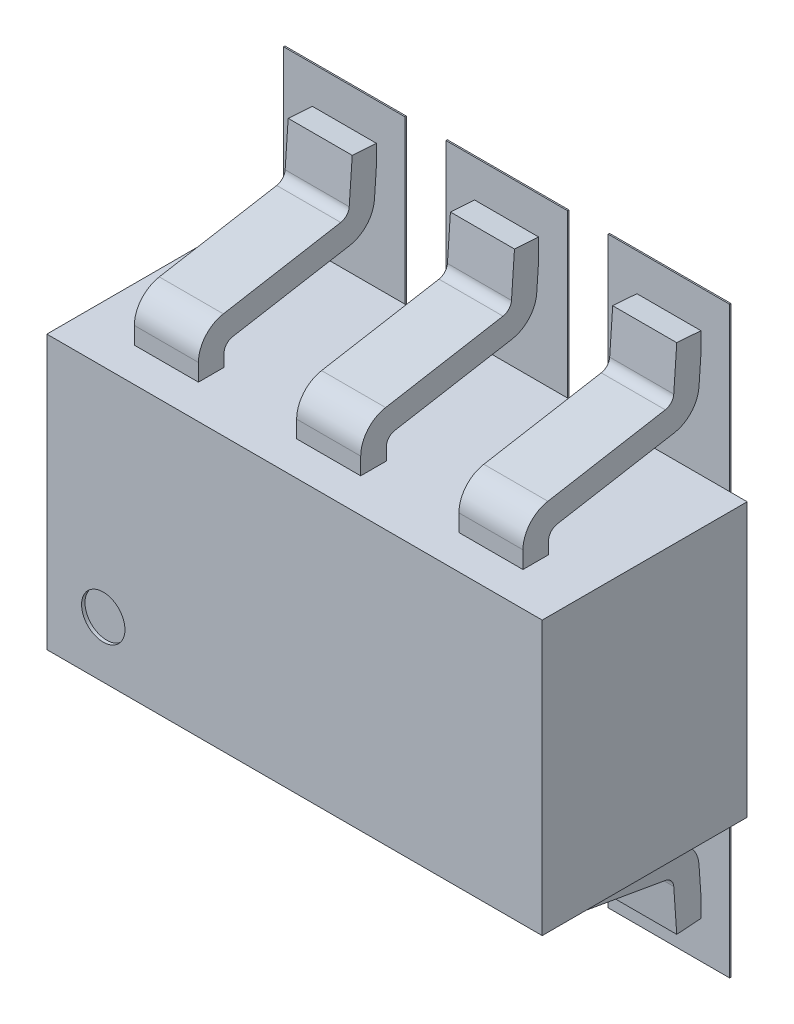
ISO-10303-21;
HEADER;
FILE_DESCRIPTION(('STEP AP214'),'2;1');
FILE_NAME('part.step','',(''),(''),'','','');
FILE_SCHEMA(('AUTOMOTIVE_DESIGN { 1 0 10303 214 1 1 1 1 }'));
ENDSEC;
DATA;
#1=APPLICATION_CONTEXT('core data for automotive mechanical design processes');
#2=APPLICATION_PROTOCOL_DEFINITION('international standard','automotive_design',2000,#1);
#3=PRODUCT_CONTEXT('',#1,'mechanical');
#4=PRODUCT('Part','Part','',(#3));
#5=PRODUCT_RELATED_PRODUCT_CATEGORY('part','',(#4));
#6=PRODUCT_DEFINITION_FORMATION('','',#4);
#7=PRODUCT_DEFINITION_CONTEXT('part definition',#1,'design');
#8=PRODUCT_DEFINITION('design','',#6,#7);
#9=PRODUCT_DEFINITION_SHAPE('','',#8);
#10=(LENGTH_UNIT() NAMED_UNIT(*) SI_UNIT(.MILLI.,.METRE.));
#11=(NAMED_UNIT(*) PLANE_ANGLE_UNIT() SI_UNIT($,.RADIAN.));
#12=(NAMED_UNIT(*) SI_UNIT($,.STERADIAN.) SOLID_ANGLE_UNIT());
#13=UNCERTAINTY_MEASURE_WITH_UNIT(LENGTH_MEASURE(1.E-05),#10,'distance_accuracy_value','');
#14=(GEOMETRIC_REPRESENTATION_CONTEXT(3) GLOBAL_UNCERTAINTY_ASSIGNED_CONTEXT((#13)) GLOBAL_UNIT_ASSIGNED_CONTEXT((#10,
#11,#12)) REPRESENTATION_CONTEXT('',''));
#15=CARTESIAN_POINT('',(0.,0.,0.));
#16=DIRECTION('',(0.,0.,1.));
#17=DIRECTION('',(1.,0.,0.));
#18=AXIS2_PLACEMENT_3D('',#15,#16,#17);
#19=CARTESIAN_POINT('',(0.,0.,0.0762));
#20=DIRECTION('',(0.,0.,1.));
#21=DIRECTION('',(1.,0.,0.));
#22=AXIS2_PLACEMENT_3D('',#19,#20,#21);
#23=PLANE('',#22);
#24=DIRECTION('',(1.,0.,0.));
#25=VECTOR('',#24,1.);
#26=CARTESIAN_POINT('',(0.3556,-0.691896,0.0762));
#27=LINE('',#26,#25);
#28=CARTESIAN_POINT('',(0.3556,-0.691896,0.0762));
#29=VERTEX_POINT('',#28);
#30=CARTESIAN_POINT('',(-0.3556,-0.691896,0.0762));
#31=VERTEX_POINT('',#30);
#32=EDGE_CURVE('E1315',#29,#31,#27,.F.);
#33=ORIENTED_EDGE('',*,*,#32,.F.);
#34=DIRECTION('',(0.,1.,0.));
#35=VECTOR('',#34,1.);
#36=CARTESIAN_POINT('',(0.3556,-1.707896,0.0762));
#37=LINE('',#36,#35);
#38=CARTESIAN_POINT('',(0.3556,-1.707896,0.0762));
#39=VERTEX_POINT('',#38);
#40=EDGE_CURVE('E1320',#39,#29,#37,.T.);
#41=ORIENTED_EDGE('',*,*,#40,.F.);
#42=DIRECTION('',(1.,0.,0.));
#43=VECTOR('',#42,1.);
#44=CARTESIAN_POINT('',(-0.3556,-1.707896,0.0762));
#45=LINE('',#44,#43);
#46=CARTESIAN_POINT('',(-0.3556,-1.707896,0.0762));
#47=VERTEX_POINT('',#46);
#48=EDGE_CURVE('E1302',#47,#39,#45,.T.);
#49=ORIENTED_EDGE('',*,*,#48,.F.);
#50=DIRECTION('',(0.,1.,0.));
#51=VECTOR('',#50,1.);
#52=CARTESIAN_POINT('',(-0.3556,-0.691896,0.0762));
#53=LINE('',#52,#51);
#54=EDGE_CURVE('E1310',#31,#47,#53,.F.);
#55=ORIENTED_EDGE('',*,*,#54,.F.);
#56=EDGE_LOOP('',(#33,#41,#49,#55));
#57=FACE_BOUND('',#56,.T.);
#58=ADVANCED_FACE('F16',(#57),#23,.F.);
#59=CARTESIAN_POINT('',(0.,0.,0.0762));
#60=DIRECTION('',(0.,0.,1.));
#61=DIRECTION('',(1.,0.,0.));
#62=AXIS2_PLACEMENT_3D('',#59,#60,#61);
#63=PLANE('',#62);
#64=DIRECTION('',(0.,1.,0.));
#65=VECTOR('',#64,1.);
#66=CARTESIAN_POINT('',(1.30556,-1.707896,0.0762));
#67=LINE('',#66,#65);
#68=CARTESIAN_POINT('',(1.30556,-1.707896,0.0762));
#69=VERTEX_POINT('',#68);
#70=CARTESIAN_POINT('',(1.30556,-0.691896,0.0762));
#71=VERTEX_POINT('',#70);
#72=EDGE_CURVE('E1295',#69,#71,#67,.T.);
#73=ORIENTED_EDGE('',*,*,#72,.F.);
#74=DIRECTION('',(1.,0.,0.));
#75=VECTOR('',#74,1.);
#76=CARTESIAN_POINT('',(0.59436,-1.707896,0.0762));
#77=LINE('',#76,#75);
#78=CARTESIAN_POINT('',(0.59436,-1.707896,0.0762));
#79=VERTEX_POINT('',#78);
#80=EDGE_CURVE('E1300',#79,#69,#77,.T.);
#81=ORIENTED_EDGE('',*,*,#80,.F.);
#82=DIRECTION('',(0.,1.,0.));
#83=VECTOR('',#82,1.);
#84=CARTESIAN_POINT('',(0.59436,-0.691896,0.0762));
#85=LINE('',#84,#83);
#86=CARTESIAN_POINT('',(0.59436,-0.691896,0.0762));
#87=VERTEX_POINT('',#86);
#88=EDGE_CURVE('E1282',#87,#79,#85,.F.);
#89=ORIENTED_EDGE('',*,*,#88,.F.);
#90=DIRECTION('',(1.,0.,0.));
#91=VECTOR('',#90,1.);
#92=CARTESIAN_POINT('',(1.30556,-0.691896,0.0762));
#93=LINE('',#92,#91);
#94=EDGE_CURVE('E1290',#71,#87,#93,.F.);
#95=ORIENTED_EDGE('',*,*,#94,.F.);
#96=EDGE_LOOP('',(#73,#81,#89,#95));
#97=FACE_BOUND('',#96,.T.);
#98=ADVANCED_FACE('F2173',(#97),#63,.F.);
#99=CARTESIAN_POINT('',(0.,0.,0.0762));
#100=DIRECTION('',(0.,0.,1.));
#101=DIRECTION('',(1.,0.,0.));
#102=AXIS2_PLACEMENT_3D('',#99,#100,#101);
#103=PLANE('',#102);
#104=DIRECTION('',(0.,1.,0.));
#105=VECTOR('',#104,1.);
#106=CARTESIAN_POINT('',(-0.59436,-1.707896,0.0762));
#107=LINE('',#106,#105);
#108=CARTESIAN_POINT('',(-0.59436,-1.707896,0.0762));
#109=VERTEX_POINT('',#108);
#110=CARTESIAN_POINT('',(-0.59436,-0.691896,0.0762));
#111=VERTEX_POINT('',#110);
#112=EDGE_CURVE('E1275',#109,#111,#107,.T.);
#113=ORIENTED_EDGE('',*,*,#112,.F.);
#114=DIRECTION('',(1.,0.,0.));
#115=VECTOR('',#114,1.);
#116=CARTESIAN_POINT('',(-1.30556,-1.707896,0.0762));
#117=LINE('',#116,#115);
#118=CARTESIAN_POINT('',(-1.30556,-1.707896,0.0762));
#119=VERTEX_POINT('',#118);
#120=EDGE_CURVE('E1280',#119,#109,#117,.T.);
#121=ORIENTED_EDGE('',*,*,#120,.F.);
#122=DIRECTION('',(0.,1.,0.));
#123=VECTOR('',#122,1.);
#124=CARTESIAN_POINT('',(-1.30556,-0.691896,0.0762));
#125=LINE('',#124,#123);
#126=CARTESIAN_POINT('',(-1.30556,-0.691896,0.0762));
#127=VERTEX_POINT('',#126);
#128=EDGE_CURVE('E1262',#127,#119,#125,.F.);
#129=ORIENTED_EDGE('',*,*,#128,.F.);
#130=DIRECTION('',(1.,0.,0.));
#131=VECTOR('',#130,1.);
#132=CARTESIAN_POINT('',(-0.59436,-0.691896,0.0762));
#133=LINE('',#132,#131);
#134=EDGE_CURVE('E1270',#111,#127,#133,.F.);
#135=ORIENTED_EDGE('',*,*,#134,.F.);
#136=EDGE_LOOP('',(#113,#121,#129,#135));
#137=FACE_BOUND('',#136,.T.);
#138=ADVANCED_FACE('F2170',(#137),#103,.F.);
#139=CARTESIAN_POINT('',(0.,0.,0.0762));
#140=DIRECTION('',(0.,0.,1.));
#141=DIRECTION('',(1.,0.,0.));
#142=AXIS2_PLACEMENT_3D('',#139,#140,#141);
#143=PLANE('',#142);
#144=DIRECTION('',(0.,1.,0.));
#145=VECTOR('',#144,1.);
#146=CARTESIAN_POINT('',(0.3556,0.691896,0.0762));
#147=LINE('',#146,#145);
#148=CARTESIAN_POINT('',(0.3556,0.691896,0.0762));
#149=VERTEX_POINT('',#148);
#150=CARTESIAN_POINT('',(0.3556,1.707896,0.0762));
#151=VERTEX_POINT('',#150);
#152=EDGE_CURVE('E1255',#149,#151,#147,.T.);
#153=ORIENTED_EDGE('',*,*,#152,.F.);
#154=DIRECTION('',(1.,0.,0.));
#155=VECTOR('',#154,1.);
#156=CARTESIAN_POINT('',(-0.3556,0.691896,0.0762));
#157=LINE('',#156,#155);
#158=CARTESIAN_POINT('',(-0.3556,0.691896,0.0762));
#159=VERTEX_POINT('',#158);
#160=EDGE_CURVE('E1260',#159,#149,#157,.T.);
#161=ORIENTED_EDGE('',*,*,#160,.F.);
#162=DIRECTION('',(0.,1.,0.));
#163=VECTOR('',#162,1.);
#164=CARTESIAN_POINT('',(-0.3556,1.707896,0.0762));
#165=LINE('',#164,#163);
#166=CARTESIAN_POINT('',(-0.3556,1.707896,0.0762));
#167=VERTEX_POINT('',#166);
#168=EDGE_CURVE('E1242',#167,#159,#165,.F.);
#169=ORIENTED_EDGE('',*,*,#168,.F.);
#170=DIRECTION('',(1.,0.,0.));
#171=VECTOR('',#170,1.);
#172=CARTESIAN_POINT('',(0.3556,1.707896,0.0762));
#173=LINE('',#172,#171);
#174=EDGE_CURVE('E1250',#151,#167,#173,.F.);
#175=ORIENTED_EDGE('',*,*,#174,.F.);
#176=EDGE_LOOP('',(#153,#161,#169,#175));
#177=FACE_BOUND('',#176,.T.);
#178=ADVANCED_FACE('F2166',(#177),#143,.F.);
#179=CARTESIAN_POINT('',(0.,0.,0.0762));
#180=DIRECTION('',(0.,0.,1.));
#181=DIRECTION('',(1.,0.,0.));
#182=AXIS2_PLACEMENT_3D('',#179,#180,#181);
#183=PLANE('',#182);
#184=DIRECTION('',(0.,1.,0.));
#185=VECTOR('',#184,1.);
#186=CARTESIAN_POINT('',(1.30556,0.691896,0.0762));
#187=LINE('',#186,#185);
#188=CARTESIAN_POINT('',(1.30556,0.691896,0.0762));
#189=VERTEX_POINT('',#188);
#190=CARTESIAN_POINT('',(1.30556,1.707896,0.0762));
#191=VERTEX_POINT('',#190);
#192=EDGE_CURVE('E1235',#189,#191,#187,.T.);
#193=ORIENTED_EDGE('',*,*,#192,.F.);
#194=DIRECTION('',(1.,0.,0.));
#195=VECTOR('',#194,1.);
#196=CARTESIAN_POINT('',(0.59436,0.691896,0.0762));
#197=LINE('',#196,#195);
#198=CARTESIAN_POINT('',(0.59436,0.691896,0.0762));
#199=VERTEX_POINT('',#198);
#200=EDGE_CURVE('E1240',#199,#189,#197,.T.);
#201=ORIENTED_EDGE('',*,*,#200,.F.);
#202=DIRECTION('',(0.,1.,0.));
#203=VECTOR('',#202,1.);
#204=CARTESIAN_POINT('',(0.59436,1.707896,0.0762));
#205=LINE('',#204,#203);
#206=CARTESIAN_POINT('',(0.59436,1.707896,0.0762));
#207=VERTEX_POINT('',#206);
#208=EDGE_CURVE('E1222',#207,#199,#205,.F.);
#209=ORIENTED_EDGE('',*,*,#208,.F.);
#210=DIRECTION('',(1.,0.,0.));
#211=VECTOR('',#210,1.);
#212=CARTESIAN_POINT('',(1.30556,1.707896,0.0762));
#213=LINE('',#212,#211);
#214=EDGE_CURVE('E1230',#191,#207,#213,.F.);
#215=ORIENTED_EDGE('',*,*,#214,.F.);
#216=EDGE_LOOP('',(#193,#201,#209,#215));
#217=FACE_BOUND('',#216,.T.);
#218=ADVANCED_FACE('F2162',(#217),#183,.F.);
#219=CARTESIAN_POINT('',(0.,0.,0.0762));
#220=DIRECTION('',(0.,0.,1.));
#221=DIRECTION('',(1.,0.,0.));
#222=AXIS2_PLACEMENT_3D('',#219,#220,#221);
#223=PLANE('',#222);
#224=DIRECTION('',(0.,1.,0.));
#225=VECTOR('',#224,1.);
#226=CARTESIAN_POINT('',(-0.59436,0.691896,0.0762));
#227=LINE('',#226,#225);
#228=CARTESIAN_POINT('',(-0.59436,0.691896,0.0762));
#229=VERTEX_POINT('',#228);
#230=CARTESIAN_POINT('',(-0.59436,1.707896,0.0762));
#231=VERTEX_POINT('',#230);
#232=EDGE_CURVE('E1215',#229,#231,#227,.T.);
#233=ORIENTED_EDGE('',*,*,#232,.F.);
#234=DIRECTION('',(1.,0.,0.));
#235=VECTOR('',#234,1.);
#236=CARTESIAN_POINT('',(-1.30556,0.691896,0.0762));
#237=LINE('',#236,#235);
#238=CARTESIAN_POINT('',(-1.30556,0.691896,0.0762));
#239=VERTEX_POINT('',#238);
#240=EDGE_CURVE('E1220',#239,#229,#237,.T.);
#241=ORIENTED_EDGE('',*,*,#240,.F.);
#242=DIRECTION('',(0.,1.,0.));
#243=VECTOR('',#242,1.);
#244=CARTESIAN_POINT('',(-1.30556,1.707896,0.0762));
#245=LINE('',#244,#243);
#246=CARTESIAN_POINT('',(-1.30556,1.707896,0.0762));
#247=VERTEX_POINT('',#246);
#248=EDGE_CURVE('E1183',#247,#239,#245,.F.);
#249=ORIENTED_EDGE('',*,*,#248,.F.);
#250=DIRECTION('',(1.,0.,0.));
#251=VECTOR('',#250,1.);
#252=CARTESIAN_POINT('',(-0.59436,1.707896,0.0762));
#253=LINE('',#252,#251);
#254=EDGE_CURVE('E1210',#231,#247,#253,.F.);
#255=ORIENTED_EDGE('',*,*,#254,.F.);
#256=EDGE_LOOP('',(#233,#241,#249,#255));
#257=FACE_BOUND('',#256,.T.);
#258=ADVANCED_FACE('F2158',(#257),#223,.F.);
#259=CARTESIAN_POINT('',(0.3556,-1.707896,0.0762));
#260=DIRECTION('',(1.,0.,0.));
#261=DIRECTION('',(0.,0.,-1.));
#262=AXIS2_PLACEMENT_3D('',#259,#260,#261);
#263=PLANE('',#262);
#264=DIRECTION('',(0.,0.,-1.));
#265=VECTOR('',#264,1.);
#266=CARTESIAN_POINT('',(0.3556,-1.707896,0.0762));
#267=LINE('',#266,#265);
#268=CARTESIAN_POINT('',(0.3556,-1.707896,0.0841999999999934));
#269=VERTEX_POINT('',#268);
#270=EDGE_CURVE('E1308',#39,#269,#267,.F.);
#271=ORIENTED_EDGE('',*,*,#270,.F.);
#272=ORIENTED_EDGE('',*,*,#40,.T.);
#273=DIRECTION('',(0.,0.,1.));
#274=VECTOR('',#273,1.);
#275=CARTESIAN_POINT('',(0.3556,-0.691896,0.0762));
#276=LINE('',#275,#274);
#277=CARTESIAN_POINT('',(0.3556,-0.691896,0.0841999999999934));
#278=VERTEX_POINT('',#277);
#279=EDGE_CURVE('E1317',#278,#29,#276,.F.);
#280=ORIENTED_EDGE('',*,*,#279,.F.);
#281=DIRECTION('',(0.,1.,0.));
#282=VECTOR('',#281,1.);
#283=CARTESIAN_POINT('',(0.3556,0.,0.0841999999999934));
#284=LINE('',#283,#282);
#285=EDGE_CURVE('E1181',#269,#278,#284,.T.);
#286=ORIENTED_EDGE('',*,*,#285,.F.);
#287=EDGE_LOOP('',(#271,#272,#280,#286));
#288=FACE_BOUND('',#287,.T.);
#289=ADVANCED_FACE('F2154',(#288),#263,.T.);
#290=CARTESIAN_POINT('',(0.3556,-0.691896,0.0762));
#291=DIRECTION('',(0.,1.,0.));
#292=DIRECTION('',(0.,0.,1.));
#293=AXIS2_PLACEMENT_3D('',#290,#291,#292);
#294=PLANE('',#293);
#295=ORIENTED_EDGE('',*,*,#279,.T.);
#296=ORIENTED_EDGE('',*,*,#32,.T.);
#297=DIRECTION('',(0.,0.,1.));
#298=VECTOR('',#297,1.);
#299=CARTESIAN_POINT('',(-0.3556,-0.691896,0.0762));
#300=LINE('',#299,#298);
#301=CARTESIAN_POINT('',(-0.3556,-0.691896,0.0841999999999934));
#302=VERTEX_POINT('',#301);
#303=EDGE_CURVE('E1312',#302,#31,#300,.F.);
#304=ORIENTED_EDGE('',*,*,#303,.F.);
#305=DIRECTION('',(1.,0.,0.));
#306=VECTOR('',#305,1.);
#307=CARTESIAN_POINT('',(0.,-0.691896,0.0841999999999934));
#308=LINE('',#307,#306);
#309=EDGE_CURVE('E1179',#278,#302,#308,.F.);
#310=ORIENTED_EDGE('',*,*,#309,.F.);
#311=EDGE_LOOP('',(#295,#296,#304,#310));
#312=FACE_BOUND('',#311,.T.);
#313=ADVANCED_FACE('F2150',(#312),#294,.T.);
#314=CARTESIAN_POINT('',(-0.3556,-0.691896,0.0762));
#315=DIRECTION('',(-1.,0.,0.));
#316=DIRECTION('',(0.,0.,1.));
#317=AXIS2_PLACEMENT_3D('',#314,#315,#316);
#318=PLANE('',#317);
#319=ORIENTED_EDGE('',*,*,#303,.T.);
#320=ORIENTED_EDGE('',*,*,#54,.T.);
#321=DIRECTION('',(0.,0.,-1.));
#322=VECTOR('',#321,1.);
#323=CARTESIAN_POINT('',(-0.3556,-1.707896,0.0762));
#324=LINE('',#323,#322);
#325=CARTESIAN_POINT('',(-0.3556,-1.707896,0.0841999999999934));
#326=VERTEX_POINT('',#325);
#327=EDGE_CURVE('E1305',#326,#47,#324,.T.);
#328=ORIENTED_EDGE('',*,*,#327,.F.);
#329=DIRECTION('',(0.,1.,0.));
#330=VECTOR('',#329,1.);
#331=CARTESIAN_POINT('',(-0.3556,0.,0.0841999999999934));
#332=LINE('',#331,#330);
#333=EDGE_CURVE('E1177',#302,#326,#332,.F.);
#334=ORIENTED_EDGE('',*,*,#333,.F.);
#335=EDGE_LOOP('',(#319,#320,#328,#334));
#336=FACE_BOUND('',#335,.T.);
#337=ADVANCED_FACE('F2146',(#336),#318,.T.);
#338=CARTESIAN_POINT('',(-0.3556,-1.707896,0.0762));
#339=DIRECTION('',(0.,-1.,0.));
#340=DIRECTION('',(0.,0.,-1.));
#341=AXIS2_PLACEMENT_3D('',#338,#339,#340);
#342=PLANE('',#341);
#343=ORIENTED_EDGE('',*,*,#327,.T.);
#344=ORIENTED_EDGE('',*,*,#48,.T.);
#345=ORIENTED_EDGE('',*,*,#270,.T.);
#346=DIRECTION('',(1.,0.,0.));
#347=VECTOR('',#346,1.);
#348=CARTESIAN_POINT('',(0.,-1.707896,0.0841999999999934));
#349=LINE('',#348,#347);
#350=EDGE_CURVE('E1167',#326,#269,#349,.T.);
#351=ORIENTED_EDGE('',*,*,#350,.F.);
#352=EDGE_LOOP('',(#343,#344,#345,#351));
#353=FACE_BOUND('',#352,.T.);
#354=ADVANCED_FACE('F2142',(#353),#342,.T.);
#355=CARTESIAN_POINT('',(0.59436,-1.707896,0.0762));
#356=DIRECTION('',(0.,-1.,0.));
#357=DIRECTION('',(0.,0.,-1.));
#358=AXIS2_PLACEMENT_3D('',#355,#356,#357);
#359=PLANE('',#358);
#360=DIRECTION('',(0.,0.,1.));
#361=VECTOR('',#360,1.);
#362=CARTESIAN_POINT('',(0.59436,-1.707896,0.0762));
#363=LINE('',#362,#361);
#364=CARTESIAN_POINT('',(0.59436,-1.707896,0.0841999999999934));
#365=VERTEX_POINT('',#364);
#366=EDGE_CURVE('E1288',#79,#365,#363,.T.);
#367=ORIENTED_EDGE('',*,*,#366,.F.);
#368=ORIENTED_EDGE('',*,*,#80,.T.);
#369=DIRECTION('',(0.,0.,-1.));
#370=VECTOR('',#369,1.);
#371=CARTESIAN_POINT('',(1.30556,-1.707896,0.0762));
#372=LINE('',#371,#370);
#373=CARTESIAN_POINT('',(1.30556,-1.707896,0.0841999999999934));
#374=VERTEX_POINT('',#373);
#375=EDGE_CURVE('E1297',#374,#69,#372,.T.);
#376=ORIENTED_EDGE('',*,*,#375,.F.);
#377=DIRECTION('',(1.,0.,0.));
#378=VECTOR('',#377,1.);
#379=CARTESIAN_POINT('',(0.,-1.707896,0.0841999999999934));
#380=LINE('',#379,#378);
#381=EDGE_CURVE('E1104',#365,#374,#380,.T.);
#382=ORIENTED_EDGE('',*,*,#381,.F.);
#383=EDGE_LOOP('',(#367,#368,#376,#382));
#384=FACE_BOUND('',#383,.T.);
#385=ADVANCED_FACE('F2138',(#384),#359,.T.);
#386=CARTESIAN_POINT('',(1.30556,-1.707896,0.0762));
#387=DIRECTION('',(1.,0.,0.));
#388=DIRECTION('',(0.,0.,-1.));
#389=AXIS2_PLACEMENT_3D('',#386,#387,#388);
#390=PLANE('',#389);
#391=ORIENTED_EDGE('',*,*,#375,.T.);
#392=ORIENTED_EDGE('',*,*,#72,.T.);
#393=DIRECTION('',(0.,0.,1.));
#394=VECTOR('',#393,1.);
#395=CARTESIAN_POINT('',(1.30556,-0.691896,0.0762));
#396=LINE('',#395,#394);
#397=CARTESIAN_POINT('',(1.30556,-0.691896,0.0841999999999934));
#398=VERTEX_POINT('',#397);
#399=EDGE_CURVE('E1292',#398,#71,#396,.F.);
#400=ORIENTED_EDGE('',*,*,#399,.F.);
#401=DIRECTION('',(0.,1.,0.));
#402=VECTOR('',#401,1.);
#403=CARTESIAN_POINT('',(1.30556,0.,0.0841999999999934));
#404=LINE('',#403,#402);
#405=EDGE_CURVE('E1102',#374,#398,#404,.T.);
#406=ORIENTED_EDGE('',*,*,#405,.F.);
#407=EDGE_LOOP('',(#391,#392,#400,#406));
#408=FACE_BOUND('',#407,.T.);
#409=ADVANCED_FACE('F2134',(#408),#390,.T.);
#410=CARTESIAN_POINT('',(1.30556,-0.691896,0.0762));
#411=DIRECTION('',(0.,1.,0.));
#412=DIRECTION('',(0.,0.,1.));
#413=AXIS2_PLACEMENT_3D('',#410,#411,#412);
#414=PLANE('',#413);
#415=ORIENTED_EDGE('',*,*,#399,.T.);
#416=ORIENTED_EDGE('',*,*,#94,.T.);
#417=DIRECTION('',(0.,0.,1.));
#418=VECTOR('',#417,1.);
#419=CARTESIAN_POINT('',(0.59436,-0.691896,0.0762));
#420=LINE('',#419,#418);
#421=CARTESIAN_POINT('',(0.59436,-0.691896,0.0841999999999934));
#422=VERTEX_POINT('',#421);
#423=EDGE_CURVE('E1285',#422,#87,#420,.F.);
#424=ORIENTED_EDGE('',*,*,#423,.F.);
#425=DIRECTION('',(1.,0.,0.));
#426=VECTOR('',#425,1.);
#427=CARTESIAN_POINT('',(0.,-0.691896,0.0841999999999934));
#428=LINE('',#427,#426);
#429=EDGE_CURVE('E1100',#398,#422,#428,.F.);
#430=ORIENTED_EDGE('',*,*,#429,.F.);
#431=EDGE_LOOP('',(#415,#416,#424,#430));
#432=FACE_BOUND('',#431,.T.);
#433=ADVANCED_FACE('F2130',(#432),#414,.T.);
#434=CARTESIAN_POINT('',(0.59436,-0.691896,0.0762));
#435=DIRECTION('',(-1.,0.,0.));
#436=DIRECTION('',(0.,0.,1.));
#437=AXIS2_PLACEMENT_3D('',#434,#435,#436);
#438=PLANE('',#437);
#439=ORIENTED_EDGE('',*,*,#423,.T.);
#440=ORIENTED_EDGE('',*,*,#88,.T.);
#441=ORIENTED_EDGE('',*,*,#366,.T.);
#442=DIRECTION('',(0.,1.,0.));
#443=VECTOR('',#442,1.);
#444=CARTESIAN_POINT('',(0.59436,0.,0.0841999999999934));
#445=LINE('',#444,#443);
#446=EDGE_CURVE('E1090',#422,#365,#445,.F.);
#447=ORIENTED_EDGE('',*,*,#446,.F.);
#448=EDGE_LOOP('',(#439,#440,#441,#447));
#449=FACE_BOUND('',#448,.T.);
#450=ADVANCED_FACE('F2126',(#449),#438,.T.);
#451=CARTESIAN_POINT('',(-1.30556,-1.707896,0.0762));
#452=DIRECTION('',(0.,-1.,0.));
#453=DIRECTION('',(0.,0.,-1.));
#454=AXIS2_PLACEMENT_3D('',#451,#452,#453);
#455=PLANE('',#454);
#456=DIRECTION('',(0.,0.,1.));
#457=VECTOR('',#456,1.);
#458=CARTESIAN_POINT('',(-1.30556,-1.707896,0.0762));
#459=LINE('',#458,#457);
#460=CARTESIAN_POINT('',(-1.30556,-1.707896,0.0841999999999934));
#461=VERTEX_POINT('',#460);
#462=EDGE_CURVE('E1268',#119,#461,#459,.T.);
#463=ORIENTED_EDGE('',*,*,#462,.F.);
#464=ORIENTED_EDGE('',*,*,#120,.T.);
#465=DIRECTION('',(0.,0.,-1.));
#466=VECTOR('',#465,1.);
#467=CARTESIAN_POINT('',(-0.59436,-1.707896,0.0762));
#468=LINE('',#467,#466);
#469=CARTESIAN_POINT('',(-0.59436,-1.707896,0.0841999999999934));
#470=VERTEX_POINT('',#469);
#471=EDGE_CURVE('E1277',#470,#109,#468,.T.);
#472=ORIENTED_EDGE('',*,*,#471,.F.);
#473=DIRECTION('',(1.,0.,0.));
#474=VECTOR('',#473,1.);
#475=CARTESIAN_POINT('',(0.,-1.707896,0.0841999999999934));
#476=LINE('',#475,#474);
#477=EDGE_CURVE('E1019',#461,#470,#476,.T.);
#478=ORIENTED_EDGE('',*,*,#477,.F.);
#479=EDGE_LOOP('',(#463,#464,#472,#478));
#480=FACE_BOUND('',#479,.T.);
#481=ADVANCED_FACE('F2122',(#480),#455,.T.);
#482=CARTESIAN_POINT('',(-0.59436,-1.707896,0.0762));
#483=DIRECTION('',(1.,0.,0.));
#484=DIRECTION('',(0.,0.,-1.));
#485=AXIS2_PLACEMENT_3D('',#482,#483,#484);
#486=PLANE('',#485);
#487=ORIENTED_EDGE('',*,*,#471,.T.);
#488=ORIENTED_EDGE('',*,*,#112,.T.);
#489=DIRECTION('',(0.,0.,1.));
#490=VECTOR('',#489,1.);
#491=CARTESIAN_POINT('',(-0.59436,-0.691896,0.0762));
#492=LINE('',#491,#490);
#493=CARTESIAN_POINT('',(-0.59436,-0.691896,0.0841999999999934));
#494=VERTEX_POINT('',#493);
#495=EDGE_CURVE('E1272',#494,#111,#492,.F.);
#496=ORIENTED_EDGE('',*,*,#495,.F.);
#497=DIRECTION('',(0.,1.,0.));
#498=VECTOR('',#497,1.);
#499=CARTESIAN_POINT('',(-0.59436,0.,0.0841999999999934));
#500=LINE('',#499,#498);
#501=EDGE_CURVE('E1017',#470,#494,#500,.T.);
#502=ORIENTED_EDGE('',*,*,#501,.F.);
#503=EDGE_LOOP('',(#487,#488,#496,#502));
#504=FACE_BOUND('',#503,.T.);
#505=ADVANCED_FACE('F2118',(#504),#486,.T.);
#506=CARTESIAN_POINT('',(-0.59436,-0.691896,0.0762));
#507=DIRECTION('',(0.,1.,0.));
#508=DIRECTION('',(0.,0.,1.));
#509=AXIS2_PLACEMENT_3D('',#506,#507,#508);
#510=PLANE('',#509);
#511=ORIENTED_EDGE('',*,*,#495,.T.);
#512=ORIENTED_EDGE('',*,*,#134,.T.);
#513=DIRECTION('',(0.,0.,1.));
#514=VECTOR('',#513,1.);
#515=CARTESIAN_POINT('',(-1.30556,-0.691896,0.0762));
#516=LINE('',#515,#514);
#517=CARTESIAN_POINT('',(-1.30556,-0.691896,0.0841999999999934));
#518=VERTEX_POINT('',#517);
#519=EDGE_CURVE('E1265',#518,#127,#516,.F.);
#520=ORIENTED_EDGE('',*,*,#519,.F.);
#521=DIRECTION('',(1.,0.,0.));
#522=VECTOR('',#521,1.);
#523=CARTESIAN_POINT('',(0.,-0.691896,0.0841999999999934));
#524=LINE('',#523,#522);
#525=EDGE_CURVE('E1015',#494,#518,#524,.F.);
#526=ORIENTED_EDGE('',*,*,#525,.F.);
#527=EDGE_LOOP('',(#511,#512,#520,#526));
#528=FACE_BOUND('',#527,.T.);
#529=ADVANCED_FACE('F2114',(#528),#510,.T.);
#530=CARTESIAN_POINT('',(-1.30556,-0.691896,0.0762));
#531=DIRECTION('',(-1.,0.,0.));
#532=DIRECTION('',(0.,0.,1.));
#533=AXIS2_PLACEMENT_3D('',#530,#531,#532);
#534=PLANE('',#533);
#535=ORIENTED_EDGE('',*,*,#519,.T.);
#536=ORIENTED_EDGE('',*,*,#128,.T.);
#537=ORIENTED_EDGE('',*,*,#462,.T.);
#538=DIRECTION('',(0.,1.,0.));
#539=VECTOR('',#538,1.);
#540=CARTESIAN_POINT('',(-1.30556,0.,0.0841999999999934));
#541=LINE('',#540,#539);
#542=EDGE_CURVE('E1005',#518,#461,#541,.F.);
#543=ORIENTED_EDGE('',*,*,#542,.F.);
#544=EDGE_LOOP('',(#535,#536,#537,#543));
#545=FACE_BOUND('',#544,.T.);
#546=ADVANCED_FACE('F2110',(#545),#534,.T.);
#547=CARTESIAN_POINT('',(0.,0.,1.30613400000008));
#548=DIRECTION('',(0.,0.,1.));
#549=DIRECTION('',(1.,0.,0.));
#550=AXIS2_PLACEMENT_3D('',#547,#548,#549);
#551=PLANE('',#550);
#552=CARTESIAN_POINT('',(-1.11980000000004,-0.469800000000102,1.30613400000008));
#553=DIRECTION('',(0.,0.,1.));
#554=DIRECTION('',(1.,0.,0.));
#555=AXIS2_PLACEMENT_3D('',#552,#553,#554);
#556=CIRCLE('',#555,0.127);
#557=CARTESIAN_POINT('',(-0.992800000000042,-0.469800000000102,1.30613400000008));
#558=VERTEX_POINT('',#557);
#559=EDGE_CURVE('E19',#558,#558,#556,.T.);
#560=ORIENTED_EDGE('',*,*,#559,.T.);
#561=EDGE_LOOP('',(#560));
#562=FACE_BOUND('',#561,.T.);
#563=ADVANCED_FACE('F2106',(#562),#551,.T.);
#564=CARTESIAN_POINT('',(-0.3556,0.691896,0.0762));
#565=DIRECTION('',(0.,-1.,0.));
#566=DIRECTION('',(0.,0.,-1.));
#567=AXIS2_PLACEMENT_3D('',#564,#565,#566);
#568=PLANE('',#567);
#569=DIRECTION('',(0.,0.,1.));
#570=VECTOR('',#569,1.);
#571=CARTESIAN_POINT('',(-0.3556,0.691896,0.0762));
#572=LINE('',#571,#570);
#573=CARTESIAN_POINT('',(-0.3556,0.691896,0.0841999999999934));
#574=VERTEX_POINT('',#573);
#575=EDGE_CURVE('E1248',#159,#574,#572,.T.);
#576=ORIENTED_EDGE('',*,*,#575,.F.);
#577=ORIENTED_EDGE('',*,*,#160,.T.);
#578=DIRECTION('',(0.,0.,-1.));
#579=VECTOR('',#578,1.);
#580=CARTESIAN_POINT('',(0.3556,0.691896,0.0762));
#581=LINE('',#580,#579);
#582=CARTESIAN_POINT('',(0.3556,0.691896,0.0841999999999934));
#583=VERTEX_POINT('',#582);
#584=EDGE_CURVE('E1257',#583,#149,#581,.T.);
#585=ORIENTED_EDGE('',*,*,#584,.F.);
#586=DIRECTION('',(1.,0.,0.));
#587=VECTOR('',#586,1.);
#588=CARTESIAN_POINT('',(0.,0.691896,0.0841999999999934));
#589=LINE('',#588,#587);
#590=EDGE_CURVE('E934',#574,#583,#589,.T.);
#591=ORIENTED_EDGE('',*,*,#590,.F.);
#592=EDGE_LOOP('',(#576,#577,#585,#591));
#593=FACE_BOUND('',#592,.T.);
#594=ADVANCED_FACE('F2102',(#593),#568,.T.);
#595=CARTESIAN_POINT('',(0.3556,0.691896,0.0762));
#596=DIRECTION('',(1.,0.,0.));
#597=DIRECTION('',(0.,0.,-1.));
#598=AXIS2_PLACEMENT_3D('',#595,#596,#597);
#599=PLANE('',#598);
#600=ORIENTED_EDGE('',*,*,#584,.T.);
#601=ORIENTED_EDGE('',*,*,#152,.T.);
#602=DIRECTION('',(0.,0.,1.));
#603=VECTOR('',#602,1.);
#604=CARTESIAN_POINT('',(0.3556,1.707896,0.0762));
#605=LINE('',#604,#603);
#606=CARTESIAN_POINT('',(0.3556,1.707896,0.0841999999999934));
#607=VERTEX_POINT('',#606);
#608=EDGE_CURVE('E1252',#607,#151,#605,.F.);
#609=ORIENTED_EDGE('',*,*,#608,.F.);
#610=DIRECTION('',(0.,1.,0.));
#611=VECTOR('',#610,1.);
#612=CARTESIAN_POINT('',(0.3556,0.,0.0841999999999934));
#613=LINE('',#612,#611);
#614=EDGE_CURVE('E932',#583,#607,#613,.T.);
#615=ORIENTED_EDGE('',*,*,#614,.F.);
#616=EDGE_LOOP('',(#600,#601,#609,#615));
#617=FACE_BOUND('',#616,.T.);
#618=ADVANCED_FACE('F2098',(#617),#599,.T.);
#619=CARTESIAN_POINT('',(0.3556,1.707896,0.0762));
#620=DIRECTION('',(0.,1.,0.));
#621=DIRECTION('',(0.,0.,1.));
#622=AXIS2_PLACEMENT_3D('',#619,#620,#621);
#623=PLANE('',#622);
#624=ORIENTED_EDGE('',*,*,#608,.T.);
#625=ORIENTED_EDGE('',*,*,#174,.T.);
#626=DIRECTION('',(0.,0.,1.));
#627=VECTOR('',#626,1.);
#628=CARTESIAN_POINT('',(-0.3556,1.707896,0.0762));
#629=LINE('',#628,#627);
#630=CARTESIAN_POINT('',(-0.3556,1.707896,0.0841999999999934));
#631=VERTEX_POINT('',#630);
#632=EDGE_CURVE('E1245',#631,#167,#629,.F.);
#633=ORIENTED_EDGE('',*,*,#632,.F.);
#634=DIRECTION('',(1.,0.,0.));
#635=VECTOR('',#634,1.);
#636=CARTESIAN_POINT('',(0.,1.707896,0.0841999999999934));
#637=LINE('',#636,#635);
#638=EDGE_CURVE('E930',#607,#631,#637,.F.);
#639=ORIENTED_EDGE('',*,*,#638,.F.);
#640=EDGE_LOOP('',(#624,#625,#633,#639));
#641=FACE_BOUND('',#640,.T.);
#642=ADVANCED_FACE('F2094',(#641),#623,.T.);
#643=CARTESIAN_POINT('',(-0.3556,1.707896,0.0762));
#644=DIRECTION('',(-1.,0.,0.));
#645=DIRECTION('',(0.,0.,1.));
#646=AXIS2_PLACEMENT_3D('',#643,#644,#645);
#647=PLANE('',#646);
#648=ORIENTED_EDGE('',*,*,#632,.T.);
#649=ORIENTED_EDGE('',*,*,#168,.T.);
#650=ORIENTED_EDGE('',*,*,#575,.T.);
#651=DIRECTION('',(0.,1.,0.));
#652=VECTOR('',#651,1.);
#653=CARTESIAN_POINT('',(-0.3556,0.,0.0841999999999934));
#654=LINE('',#653,#652);
#655=EDGE_CURVE('E925',#631,#574,#654,.F.);
#656=ORIENTED_EDGE('',*,*,#655,.F.);
#657=EDGE_LOOP('',(#648,#649,#650,#656));
#658=FACE_BOUND('',#657,.T.);
#659=ADVANCED_FACE('F2090',(#658),#647,.T.);
#660=CARTESIAN_POINT('',(0.59436,0.691896,0.0762));
#661=DIRECTION('',(0.,-1.,0.));
#662=DIRECTION('',(0.,0.,-1.));
#663=AXIS2_PLACEMENT_3D('',#660,#661,#662);
#664=PLANE('',#663);
#665=DIRECTION('',(0.,0.,1.));
#666=VECTOR('',#665,1.);
#667=CARTESIAN_POINT('',(0.59436,0.691896,0.0762));
#668=LINE('',#667,#666);
#669=CARTESIAN_POINT('',(0.59436,0.691896,0.0841999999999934));
#670=VERTEX_POINT('',#669);
#671=EDGE_CURVE('E1228',#199,#670,#668,.T.);
#672=ORIENTED_EDGE('',*,*,#671,.F.);
#673=ORIENTED_EDGE('',*,*,#200,.T.);
#674=DIRECTION('',(0.,0.,-1.));
#675=VECTOR('',#674,1.);
#676=CARTESIAN_POINT('',(1.30556,0.691896,0.0762));
#677=LINE('',#676,#675);
#678=CARTESIAN_POINT('',(1.30556,0.691896,0.0841999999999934));
#679=VERTEX_POINT('',#678);
#680=EDGE_CURVE('E1237',#679,#189,#677,.T.);
#681=ORIENTED_EDGE('',*,*,#680,.F.);
#682=DIRECTION('',(1.,0.,0.));
#683=VECTOR('',#682,1.);
#684=CARTESIAN_POINT('',(0.,0.691896,0.0841999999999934));
#685=LINE('',#684,#683);
#686=EDGE_CURVE('E851',#670,#679,#685,.T.);
#687=ORIENTED_EDGE('',*,*,#686,.F.);
#688=EDGE_LOOP('',(#672,#673,#681,#687));
#689=FACE_BOUND('',#688,.T.);
#690=ADVANCED_FACE('F2086',(#689),#664,.T.);
#691=CARTESIAN_POINT('',(1.30556,0.691896,0.0762));
#692=DIRECTION('',(1.,0.,0.));
#693=DIRECTION('',(0.,0.,-1.));
#694=AXIS2_PLACEMENT_3D('',#691,#692,#693);
#695=PLANE('',#694);
#696=ORIENTED_EDGE('',*,*,#680,.T.);
#697=ORIENTED_EDGE('',*,*,#192,.T.);
#698=DIRECTION('',(0.,0.,1.));
#699=VECTOR('',#698,1.);
#700=CARTESIAN_POINT('',(1.30556,1.707896,0.0762));
#701=LINE('',#700,#699);
#702=CARTESIAN_POINT('',(1.30556,1.707896,0.0841999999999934));
#703=VERTEX_POINT('',#702);
#704=EDGE_CURVE('E1232',#703,#191,#701,.F.);
#705=ORIENTED_EDGE('',*,*,#704,.F.);
#706=DIRECTION('',(0.,1.,0.));
#707=VECTOR('',#706,1.);
#708=CARTESIAN_POINT('',(1.30556,0.,0.0841999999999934));
#709=LINE('',#708,#707);
#710=EDGE_CURVE('E849',#679,#703,#709,.T.);
#711=ORIENTED_EDGE('',*,*,#710,.F.);
#712=EDGE_LOOP('',(#696,#697,#705,#711));
#713=FACE_BOUND('',#712,.T.);
#714=ADVANCED_FACE('F2082',(#713),#695,.T.);
#715=CARTESIAN_POINT('',(1.30556,1.707896,0.0762));
#716=DIRECTION('',(0.,1.,0.));
#717=DIRECTION('',(0.,0.,1.));
#718=AXIS2_PLACEMENT_3D('',#715,#716,#717);
#719=PLANE('',#718);
#720=ORIENTED_EDGE('',*,*,#704,.T.);
#721=ORIENTED_EDGE('',*,*,#214,.T.);
#722=DIRECTION('',(0.,0.,1.));
#723=VECTOR('',#722,1.);
#724=CARTESIAN_POINT('',(0.59436,1.707896,0.0762));
#725=LINE('',#724,#723);
#726=CARTESIAN_POINT('',(0.59436,1.707896,0.0841999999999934));
#727=VERTEX_POINT('',#726);
#728=EDGE_CURVE('E1225',#727,#207,#725,.F.);
#729=ORIENTED_EDGE('',*,*,#728,.F.);
#730=DIRECTION('',(1.,0.,0.));
#731=VECTOR('',#730,1.);
#732=CARTESIAN_POINT('',(0.,1.707896,0.0841999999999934));
#733=LINE('',#732,#731);
#734=EDGE_CURVE('E847',#703,#727,#733,.F.);
#735=ORIENTED_EDGE('',*,*,#734,.F.);
#736=EDGE_LOOP('',(#720,#721,#729,#735));
#737=FACE_BOUND('',#736,.T.);
#738=ADVANCED_FACE('F2078',(#737),#719,.T.);
#739=CARTESIAN_POINT('',(0.59436,1.707896,0.0762));
#740=DIRECTION('',(-1.,0.,0.));
#741=DIRECTION('',(0.,0.,1.));
#742=AXIS2_PLACEMENT_3D('',#739,#740,#741);
#743=PLANE('',#742);
#744=ORIENTED_EDGE('',*,*,#728,.T.);
#745=ORIENTED_EDGE('',*,*,#208,.T.);
#746=ORIENTED_EDGE('',*,*,#671,.T.);
#747=DIRECTION('',(0.,1.,0.));
#748=VECTOR('',#747,1.);
#749=CARTESIAN_POINT('',(0.59436,0.,0.0841999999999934));
#750=LINE('',#749,#748);
#751=EDGE_CURVE('E842',#727,#670,#750,.F.);
#752=ORIENTED_EDGE('',*,*,#751,.F.);
#753=EDGE_LOOP('',(#744,#745,#746,#752));
#754=FACE_BOUND('',#753,.T.);
#755=ADVANCED_FACE('F2074',(#754),#743,.T.);
#756=CARTESIAN_POINT('',(-1.30556,0.691896,0.0762));
#757=DIRECTION('',(0.,-1.,0.));
#758=DIRECTION('',(0.,0.,-1.));
#759=AXIS2_PLACEMENT_3D('',#756,#757,#758);
#760=PLANE('',#759);
#761=DIRECTION('',(0.,0.,1.));
#762=VECTOR('',#761,1.);
#763=CARTESIAN_POINT('',(-1.30556,0.691896,0.0762));
#764=LINE('',#763,#762);
#765=CARTESIAN_POINT('',(-1.30556,0.691896,0.0841999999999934));
#766=VERTEX_POINT('',#765);
#767=EDGE_CURVE('E1208',#239,#766,#764,.T.);
#768=ORIENTED_EDGE('',*,*,#767,.F.);
#769=ORIENTED_EDGE('',*,*,#240,.T.);
#770=DIRECTION('',(0.,0.,-1.));
#771=VECTOR('',#770,1.);
#772=CARTESIAN_POINT('',(-0.59436,0.691896,0.0762));
#773=LINE('',#772,#771);
#774=CARTESIAN_POINT('',(-0.59436,0.691896,0.0841999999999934));
#775=VERTEX_POINT('',#774);
#776=EDGE_CURVE('E1217',#775,#229,#773,.T.);
#777=ORIENTED_EDGE('',*,*,#776,.F.);
#778=DIRECTION('',(1.,0.,0.));
#779=VECTOR('',#778,1.);
#780=CARTESIAN_POINT('',(0.,0.691896,0.0841999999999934));
#781=LINE('',#780,#779);
#782=EDGE_CURVE('E768',#766,#775,#781,.T.);
#783=ORIENTED_EDGE('',*,*,#782,.F.);
#784=EDGE_LOOP('',(#768,#769,#777,#783));
#785=FACE_BOUND('',#784,.T.);
#786=ADVANCED_FACE('F2070',(#785),#760,.T.);
#787=CARTESIAN_POINT('',(-0.59436,0.691896,0.0762));
#788=DIRECTION('',(1.,0.,0.));
#789=DIRECTION('',(0.,0.,-1.));
#790=AXIS2_PLACEMENT_3D('',#787,#788,#789);
#791=PLANE('',#790);
#792=ORIENTED_EDGE('',*,*,#776,.T.);
#793=ORIENTED_EDGE('',*,*,#232,.T.);
#794=DIRECTION('',(0.,0.,1.));
#795=VECTOR('',#794,1.);
#796=CARTESIAN_POINT('',(-0.59436,1.707896,0.0762));
#797=LINE('',#796,#795);
#798=CARTESIAN_POINT('',(-0.59436,1.707896,0.0841999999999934));
#799=VERTEX_POINT('',#798);
#800=EDGE_CURVE('E1212',#799,#231,#797,.F.);
#801=ORIENTED_EDGE('',*,*,#800,.F.);
#802=DIRECTION('',(0.,1.,0.));
#803=VECTOR('',#802,1.);
#804=CARTESIAN_POINT('',(-0.59436,0.,0.0841999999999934));
#805=LINE('',#804,#803);
#806=EDGE_CURVE('E766',#775,#799,#805,.T.);
#807=ORIENTED_EDGE('',*,*,#806,.F.);
#808=EDGE_LOOP('',(#792,#793,#801,#807));
#809=FACE_BOUND('',#808,.T.);
#810=ADVANCED_FACE('F2066',(#809),#791,.T.);
#811=CARTESIAN_POINT('',(-0.59436,1.707896,0.0762));
#812=DIRECTION('',(0.,1.,0.));
#813=DIRECTION('',(0.,0.,1.));
#814=AXIS2_PLACEMENT_3D('',#811,#812,#813);
#815=PLANE('',#814);
#816=ORIENTED_EDGE('',*,*,#800,.T.);
#817=ORIENTED_EDGE('',*,*,#254,.T.);
#818=DIRECTION('',(0.,0.,1.));
#819=VECTOR('',#818,1.);
#820=CARTESIAN_POINT('',(-1.30556,1.707896,0.0762));
#821=LINE('',#820,#819);
#822=CARTESIAN_POINT('',(-1.30556,1.707896,0.0841999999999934));
#823=VERTEX_POINT('',#822);
#824=EDGE_CURVE('E1205',#823,#247,#821,.F.);
#825=ORIENTED_EDGE('',*,*,#824,.F.);
#826=DIRECTION('',(1.,0.,0.));
#827=VECTOR('',#826,1.);
#828=CARTESIAN_POINT('',(0.,1.707896,0.0841999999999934));
#829=LINE('',#828,#827);
#830=EDGE_CURVE('E764',#799,#823,#829,.F.);
#831=ORIENTED_EDGE('',*,*,#830,.F.);
#832=EDGE_LOOP('',(#816,#817,#825,#831));
#833=FACE_BOUND('',#832,.T.);
#834=ADVANCED_FACE('F2062',(#833),#815,.T.);
#835=CARTESIAN_POINT('',(-1.30556,1.707896,0.0762));
#836=DIRECTION('',(-1.,0.,0.));
#837=DIRECTION('',(0.,0.,1.));
#838=AXIS2_PLACEMENT_3D('',#835,#836,#837);
#839=PLANE('',#838);
#840=ORIENTED_EDGE('',*,*,#824,.T.);
#841=ORIENTED_EDGE('',*,*,#248,.T.);
#842=ORIENTED_EDGE('',*,*,#767,.T.);
#843=DIRECTION('',(0.,1.,0.));
#844=VECTOR('',#843,1.);
#845=CARTESIAN_POINT('',(-1.30556,0.,0.0841999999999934));
#846=LINE('',#845,#844);
#847=EDGE_CURVE('E759',#823,#766,#846,.F.);
#848=ORIENTED_EDGE('',*,*,#847,.F.);
#849=EDGE_LOOP('',(#840,#841,#842,#848));
#850=FACE_BOUND('',#849,.T.);
#851=ADVANCED_FACE('F2058',(#850),#839,.T.);
#852=CARTESIAN_POINT('',(0.,0.,0.0841999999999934));
#853=DIRECTION('',(0.,0.,1.));
#854=DIRECTION('',(1.,0.,0.));
#855=AXIS2_PLACEMENT_3D('',#852,#853,#854);
#856=PLANE('',#855);
#857=DIRECTION('',(1.,0.,0.));
#858=VECTOR('',#857,1.);
#859=CARTESIAN_POINT('',(-0.187500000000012,-1.49009594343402,0.0841999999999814));
#860=LINE('',#859,#858);
#861=CARTESIAN_POINT('',(-0.187500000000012,-1.49009594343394,0.0841999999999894));
#862=VERTEX_POINT('',#861);
#863=CARTESIAN_POINT('',(0.187500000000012,-1.49009594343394,0.0841999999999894));
#864=VERTEX_POINT('',#863);
#865=EDGE_CURVE('E1106',#862,#864,#860,.T.);
#866=ORIENTED_EDGE('',*,*,#865,.F.);
#867=DIRECTION('',(0.,1.,0.));
#868=VECTOR('',#867,1.);
#869=CARTESIAN_POINT('',(-0.187500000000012,0.,0.0841999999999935));
#870=LINE('',#869,#868);
#871=CARTESIAN_POINT('',(-0.187500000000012,-1.37513119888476,0.0841999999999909));
#872=VERTEX_POINT('',#871);
#873=EDGE_CURVE('E1158',#862,#872,#870,.T.);
#874=ORIENTED_EDGE('',*,*,#873,.T.);
#875=DIRECTION('',(1.,0.,0.));
#876=VECTOR('',#875,1.);
#877=CARTESIAN_POINT('',(-0.187500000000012,-1.37513119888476,0.0841999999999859));
#878=LINE('',#877,#876);
#879=CARTESIAN_POINT('',(0.187500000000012,-1.37513119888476,0.084199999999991));
#880=VERTEX_POINT('',#879);
#881=EDGE_CURVE('E1165',#880,#872,#878,.F.);
#882=ORIENTED_EDGE('',*,*,#881,.F.);
#883=DIRECTION('',(0.,1.,0.));
#884=VECTOR('',#883,1.);
#885=CARTESIAN_POINT('',(0.187500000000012,0.,0.0841999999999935));
#886=LINE('',#885,#884);
#887=EDGE_CURVE('E1189',#864,#880,#886,.T.);
#888=ORIENTED_EDGE('',*,*,#887,.F.);
#889=EDGE_LOOP('',(#866,#874,#882,#888));
#890=FACE_BOUND('',#889,.T.);
#891=ORIENTED_EDGE('',*,*,#333,.T.);
#892=ORIENTED_EDGE('',*,*,#350,.T.);
#893=ORIENTED_EDGE('',*,*,#285,.T.);
#894=ORIENTED_EDGE('',*,*,#309,.T.);
#895=EDGE_LOOP('',(#891,#892,#893,#894));
#896=FACE_BOUND('',#895,.T.);
#897=ADVANCED_FACE('F2054',(#890,#896),#856,.T.);
#898=CARTESIAN_POINT('',(-0.187500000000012,-1.48953652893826,0.0762));
#899=DIRECTION('',(0.,0.0697564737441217,-0.997564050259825));
#900=DIRECTION('',(0.,0.997564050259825,0.0697564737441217));
#901=AXIS2_PLACEMENT_3D('',#898,#899,#900);
#902=PLANE('',#901);
#903=DIRECTION('',(0.,0.997564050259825,0.0697564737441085));
#904=VECTOR('',#903,1.);
#905=CARTESIAN_POINT('',(0.187500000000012,-1.37513119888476,0.0841999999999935));
#906=LINE('',#905,#904);
#907=CARTESIAN_POINT('',(0.187500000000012,-1.21110842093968,0.0956695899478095));
#908=VERTEX_POINT('',#907);
#909=EDGE_CURVE('E666',#880,#908,#906,.T.);
#910=ORIENTED_EDGE('',*,*,#909,.F.);
#911=ORIENTED_EDGE('',*,*,#881,.T.);
#912=DIRECTION('',(0.,0.997564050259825,0.0697564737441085));
#913=VECTOR('',#912,1.);
#914=CARTESIAN_POINT('',(-0.187500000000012,-1.37513119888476,0.0841999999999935));
#915=LINE('',#914,#913);
#916=CARTESIAN_POINT('',(-0.187500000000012,-1.21110842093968,0.0956695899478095));
#917=VERTEX_POINT('',#916);
#918=EDGE_CURVE('E1172',#872,#917,#915,.T.);
#919=ORIENTED_EDGE('',*,*,#918,.T.);
#920=DIRECTION('',(1.,0.,0.));
#921=VECTOR('',#920,1.);
#922=CARTESIAN_POINT('',(-0.187500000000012,-1.2111084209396,0.0956695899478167));
#923=LINE('',#922,#921);
#924=EDGE_CURVE('E686',#908,#917,#923,.F.);
#925=ORIENTED_EDGE('',*,*,#924,.F.);
#926=EDGE_LOOP('',(#910,#911,#919,#925));
#927=FACE_BOUND('',#926,.T.);
#928=ADVANCED_FACE('F2051',(#927),#902,.T.);
#929=CARTESIAN_POINT('',(-0.187500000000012,-1.22338556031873,0.271240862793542));
#930=DIRECTION('',(1.,0.,0.));
#931=DIRECTION('',(0.,0.,-1.));
#932=AXIS2_PLACEMENT_3D('',#929,#930,#931);
#933=CYLINDRICAL_SURFACE('',#932,0.176000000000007);
#934=ORIENTED_EDGE('',*,*,#924,.T.);
#935=CARTESIAN_POINT('',(-0.187500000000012,-1.22338556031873,0.271240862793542));
#936=DIRECTION('',(1.,0.,0.));
#937=DIRECTION('',(0.,0.,-1.));
#938=AXIS2_PLACEMENT_3D('',#935,#936,#937);
#939=CIRCLE('',#938,0.176000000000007);
#940=CARTESIAN_POINT('',(-0.187500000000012,-1.05000000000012,0.241017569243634));
#941=VERTEX_POINT('',#940);
#942=EDGE_CURVE('E681',#917,#941,#939,.T.);
#943=ORIENTED_EDGE('',*,*,#942,.T.);
#944=DIRECTION('',(1.,0.,0.));
#945=VECTOR('',#944,1.);
#946=CARTESIAN_POINT('',(-0.187500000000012,-1.05000000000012,0.241017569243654));
#947=LINE('',#946,#945);
#948=CARTESIAN_POINT('',(0.187500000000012,-1.05000000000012,0.241017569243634));
#949=VERTEX_POINT('',#948);
#950=EDGE_CURVE('E678',#949,#941,#947,.F.);
#951=ORIENTED_EDGE('',*,*,#950,.F.);
#952=CARTESIAN_POINT('',(0.187500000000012,-1.22338556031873,0.271240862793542));
#953=DIRECTION('',(1.,0.,0.));
#954=DIRECTION('',(0.,0.,-1.));
#955=AXIS2_PLACEMENT_3D('',#952,#953,#954);
#956=CIRCLE('',#955,0.176000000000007);
#957=EDGE_CURVE('E669',#908,#949,#956,.T.);
#958=ORIENTED_EDGE('',*,*,#957,.F.);
#959=EDGE_LOOP('',(#934,#943,#951,#958));
#960=FACE_BOUND('',#959,.T.);
#961=ADVANCED_FACE('F679',(#960),#933,.T.);
#962=CARTESIAN_POINT('',(-0.187500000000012,-1.05000000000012,0.241017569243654));
#963=DIRECTION('',(0.,0.985145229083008,-0.171723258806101));
#964=DIRECTION('',(0.,0.171723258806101,0.985145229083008));
#965=AXIS2_PLACEMENT_3D('',#962,#963,#964);
#966=PLANE('',#965);
#967=ORIENTED_EDGE('',*,*,#950,.T.);
#968=DIRECTION('',(0.,0.171723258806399,0.985145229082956));
#969=VECTOR('',#968,1.);
#970=CARTESIAN_POINT('',(-0.187500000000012,-1.05000000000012,0.241017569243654));
#971=LINE('',#970,#969);
#972=CARTESIAN_POINT('',(-0.187500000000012,-0.93052266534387,0.926437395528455));
#973=VERTEX_POINT('',#972);
#974=EDGE_CURVE('E1472',#941,#973,#971,.T.);
#975=ORIENTED_EDGE('',*,*,#974,.T.);
#976=DIRECTION('',(1.,0.,0.));
#977=VECTOR('',#976,1.);
#978=CARTESIAN_POINT('',(-0.187500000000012,-0.93052266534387,0.926437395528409));
#979=LINE('',#978,#977);
#980=CARTESIAN_POINT('',(0.187500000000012,-0.93052266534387,0.926437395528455));
#981=VERTEX_POINT('',#980);
#982=EDGE_CURVE('E685',#973,#981,#979,.T.);
#983=ORIENTED_EDGE('',*,*,#982,.T.);
#984=DIRECTION('',(0.,0.171723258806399,0.985145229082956));
#985=VECTOR('',#984,1.);
#986=CARTESIAN_POINT('',(0.187500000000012,-1.05000000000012,0.241017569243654));
#987=LINE('',#986,#985);
#988=EDGE_CURVE('E674',#949,#981,#987,.T.);
#989=ORIENTED_EDGE('',*,*,#988,.F.);
#990=EDGE_LOOP('',(#967,#975,#983,#989));
#991=FACE_BOUND('',#990,.T.);
#992=ADVANCED_FACE('F688',(#991),#966,.T.);
#993=CARTESIAN_POINT('',(-0.187500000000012,-0.871413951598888,0.916134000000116));
#994=DIRECTION('',(1.,0.,0.));
#995=DIRECTION('',(0.,0.,-1.));
#996=AXIS2_PLACEMENT_3D('',#993,#994,#995);
#997=CYLINDRICAL_SURFACE('',#996,0.0599999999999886);
#998=CARTESIAN_POINT('',(0.187500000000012,-0.871413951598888,0.916134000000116));
#999=DIRECTION('',(1.,0.,0.));
#1000=DIRECTION('',(0.,0.,-1.));
#1001=AXIS2_PLACEMENT_3D('',#998,#999,#1000);
#1002=CIRCLE('',#1001,0.0599999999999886);
#1003=CARTESIAN_POINT('',(0.187500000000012,-0.871413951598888,0.976133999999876));
#1004=VERTEX_POINT('',#1003);
#1005=EDGE_CURVE('E690',#981,#1004,#1002,.F.);
#1006=ORIENTED_EDGE('',*,*,#1005,.F.);
#1007=ORIENTED_EDGE('',*,*,#982,.F.);
#1008=CARTESIAN_POINT('',(-0.187500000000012,-0.871413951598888,0.916134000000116));
#1009=DIRECTION('',(1.,0.,0.));
#1010=DIRECTION('',(0.,0.,-1.));
#1011=AXIS2_PLACEMENT_3D('',#1008,#1009,#1010);
#1012=CIRCLE('',#1011,0.0599999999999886);
#1013=CARTESIAN_POINT('',(-0.187500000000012,-0.871413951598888,0.976133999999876));
#1014=VERTEX_POINT('',#1013);
#1015=EDGE_CURVE('E1468',#973,#1014,#1012,.F.);
#1016=ORIENTED_EDGE('',*,*,#1015,.T.);
#1017=DIRECTION('',(-1.,0.,0.));
#1018=VECTOR('',#1017,1.);
#1019=CARTESIAN_POINT('',(-0.187500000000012,-0.871413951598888,0.976133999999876));
#1020=LINE('',#1019,#1018);
#1021=EDGE_CURVE('E1156',#1004,#1014,#1020,.T.);
#1022=ORIENTED_EDGE('',*,*,#1021,.F.);
#1023=EDGE_LOOP('',(#1006,#1007,#1016,#1022));
#1024=FACE_BOUND('',#1023,.T.);
#1025=ADVANCED_FACE('F2042',(#1024),#997,.F.);
#1026=CARTESIAN_POINT('',(-0.187500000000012,-0.899999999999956,0.95013399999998));
#1027=DIRECTION('',(1.,0.,0.));
#1028=DIRECTION('',(0.,0.,-1.));
#1029=AXIS2_PLACEMENT_3D('',#1026,#1027,#1028);
#1030=CYLINDRICAL_SURFACE('',#1029,0.176000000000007);
#1031=DIRECTION('',(1.,0.,0.));
#1032=VECTOR('',#1031,1.);
#1033=CARTESIAN_POINT('',(-0.187500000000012,-0.899999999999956,1.12613400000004));
#1034=LINE('',#1033,#1032);
#1035=CARTESIAN_POINT('',(-0.187500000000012,-0.899999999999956,1.12613400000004));
#1036=VERTEX_POINT('',#1035);
#1037=CARTESIAN_POINT('',(0.187500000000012,-0.899999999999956,1.12613400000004));
#1038=VERTEX_POINT('',#1037);
#1039=EDGE_CURVE('E699',#1036,#1038,#1034,.T.);
#1040=ORIENTED_EDGE('',*,*,#1039,.F.);
#1041=CARTESIAN_POINT('',(-0.187500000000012,-0.899999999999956,0.95013399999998));
#1042=DIRECTION('',(1.,0.,0.));
#1043=DIRECTION('',(0.,0.,-1.));
#1044=AXIS2_PLACEMENT_3D('',#1041,#1042,#1043);
#1045=CIRCLE('',#1044,0.176000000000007);
#1046=CARTESIAN_POINT('',(-0.187500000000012,-1.07338556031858,0.980357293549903));
#1047=VERTEX_POINT('',#1046);
#1048=EDGE_CURVE('E1464',#1036,#1047,#1045,.T.);
#1049=ORIENTED_EDGE('',*,*,#1048,.T.);
#1050=DIRECTION('',(1.,0.,0.));
#1051=VECTOR('',#1050,1.);
#1052=CARTESIAN_POINT('',(-0.187500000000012,-1.07338556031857,0.98035729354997));
#1053=LINE('',#1052,#1051);
#1054=CARTESIAN_POINT('',(0.187500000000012,-1.07338556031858,0.980357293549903));
#1055=VERTEX_POINT('',#1054);
#1056=EDGE_CURVE('E1142',#1055,#1047,#1053,.F.);
#1057=ORIENTED_EDGE('',*,*,#1056,.F.);
#1058=CARTESIAN_POINT('',(0.187500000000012,-0.899999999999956,0.95013399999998));
#1059=DIRECTION('',(1.,0.,0.));
#1060=DIRECTION('',(0.,0.,-1.));
#1061=AXIS2_PLACEMENT_3D('',#1058,#1059,#1060);
#1062=CIRCLE('',#1061,0.176000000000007);
#1063=EDGE_CURVE('E1477',#1038,#1055,#1062,.T.);
#1064=ORIENTED_EDGE('',*,*,#1063,.F.);
#1065=EDGE_LOOP('',(#1040,#1049,#1057,#1064));
#1066=FACE_BOUND('',#1065,.T.);
#1067=ADVANCED_FACE('F2038',(#1066),#1030,.T.);
#1068=CARTESIAN_POINT('',(-0.187500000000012,-1.07338556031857,0.98035729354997));
#1069=DIRECTION('',(0.,-0.985145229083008,0.171723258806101));
#1070=DIRECTION('',(0.,-0.171723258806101,-0.985145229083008));
#1071=AXIS2_PLACEMENT_3D('',#1068,#1069,#1070);
#1072=PLANE('',#1071);
#1073=ORIENTED_EDGE('',*,*,#1056,.T.);
#1074=DIRECTION('',(0.,-0.171723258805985,-0.985145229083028));
#1075=VECTOR('',#1074,1.);
#1076=CARTESIAN_POINT('',(-0.187500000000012,-1.07338556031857,0.98035729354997));
#1077=LINE('',#1076,#1075);
#1078=CARTESIAN_POINT('',(-0.187500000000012,-1.19320098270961,0.292997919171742));
#1079=VERTEX_POINT('',#1078);
#1080=EDGE_CURVE('E1463',#1047,#1079,#1077,.T.);
#1081=ORIENTED_EDGE('',*,*,#1080,.T.);
#1082=DIRECTION('',(1.,0.,0.));
#1083=VECTOR('',#1082,1.);
#1084=CARTESIAN_POINT('',(-0.187500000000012,-1.19320098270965,0.292997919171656));
#1085=LINE('',#1084,#1083);
#1086=CARTESIAN_POINT('',(0.187500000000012,-1.19320098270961,0.292997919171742));
#1087=VERTEX_POINT('',#1086);
#1088=EDGE_CURVE('E1131',#1079,#1087,#1085,.T.);
#1089=ORIENTED_EDGE('',*,*,#1088,.T.);
#1090=DIRECTION('',(0.,-0.171723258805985,-0.985145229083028));
#1091=VECTOR('',#1090,1.);
#1092=CARTESIAN_POINT('',(0.187500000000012,-1.07338556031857,0.98035729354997));
#1093=LINE('',#1092,#1091);
#1094=EDGE_CURVE('E1476',#1055,#1087,#1093,.T.);
#1095=ORIENTED_EDGE('',*,*,#1094,.F.);
#1096=EDGE_LOOP('',(#1073,#1081,#1089,#1095));
#1097=FACE_BOUND('',#1096,.T.);
#1098=ADVANCED_FACE('F2034',(#1097),#1072,.T.);
#1099=CARTESIAN_POINT('',(-0.187500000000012,-1.25230969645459,0.303301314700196));
#1100=DIRECTION('',(1.,0.,0.));
#1101=DIRECTION('',(0.,0.,-1.));
#1102=AXIS2_PLACEMENT_3D('',#1099,#1100,#1101);
#1103=CYLINDRICAL_SURFACE('',#1102,0.0599999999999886);
#1104=CARTESIAN_POINT('',(0.187500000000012,-1.25230969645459,0.303301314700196));
#1105=DIRECTION('',(1.,0.,0.));
#1106=DIRECTION('',(0.,0.,-1.));
#1107=AXIS2_PLACEMENT_3D('',#1104,#1105,#1106);
#1108=CIRCLE('',#1107,0.0599999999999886);
#1109=CARTESIAN_POINT('',(0.187500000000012,-1.24812430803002,0.243447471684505));
#1110=VERTEX_POINT('',#1109);
#1111=EDGE_CURVE('E1474',#1087,#1110,#1108,.F.);
#1112=ORIENTED_EDGE('',*,*,#1111,.F.);
#1113=ORIENTED_EDGE('',*,*,#1088,.F.);
#1114=CARTESIAN_POINT('',(-0.187500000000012,-1.25230969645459,0.303301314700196));
#1115=DIRECTION('',(1.,0.,0.));
#1116=DIRECTION('',(0.,0.,-1.));
#1117=AXIS2_PLACEMENT_3D('',#1114,#1115,#1116);
#1118=CIRCLE('',#1117,0.0599999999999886);
#1119=CARTESIAN_POINT('',(-0.187500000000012,-1.24812430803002,0.243447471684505));
#1120=VERTEX_POINT('',#1119);
#1121=EDGE_CURVE('E1460',#1079,#1120,#1118,.F.);
#1122=ORIENTED_EDGE('',*,*,#1121,.T.);
#1123=DIRECTION('',(1.,0.,0.));
#1124=VECTOR('',#1123,1.);
#1125=CARTESIAN_POINT('',(-0.187500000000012,-1.24812430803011,0.243447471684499));
#1126=LINE('',#1125,#1124);
#1127=EDGE_CURVE('E1128',#1110,#1120,#1126,.F.);
#1128=ORIENTED_EDGE('',*,*,#1127,.F.);
#1129=EDGE_LOOP('',(#1112,#1113,#1122,#1128));
#1130=FACE_BOUND('',#1129,.T.);
#1131=ADVANCED_FACE('F2030',(#1130),#1103,.F.);
#1132=CARTESIAN_POINT('',(-0.187500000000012,-1.24812430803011,0.243447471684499));
#1133=DIRECTION('',(0.,-0.0697564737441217,0.997564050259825));
#1134=DIRECTION('',(0.,-0.997564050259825,-0.0697564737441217));
#1135=AXIS2_PLACEMENT_3D('',#1132,#1133,#1134);
#1136=PLANE('',#1135);
#1137=ORIENTED_EDGE('',*,*,#1127,.T.);
#1138=DIRECTION('',(0.,-0.997564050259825,-0.0697564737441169));
#1139=VECTOR('',#1138,1.);
#1140=CARTESIAN_POINT('',(-0.187500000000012,-1.24812430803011,0.243447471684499));
#1141=LINE('',#1140,#1139);
#1142=CARTESIAN_POINT('',(-0.187500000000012,-1.5000000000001,0.225834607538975));
#1143=VERTEX_POINT('',#1142);
#1144=EDGE_CURVE('E1134',#1120,#1143,#1141,.T.);
#1145=ORIENTED_EDGE('',*,*,#1144,.T.);
#1146=DIRECTION('',(1.,0.,0.));
#1147=VECTOR('',#1146,1.);
#1148=CARTESIAN_POINT('',(-0.187500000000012,-1.5000000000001,0.225834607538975));
#1149=LINE('',#1148,#1147);
#1150=CARTESIAN_POINT('',(0.187500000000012,-1.5000000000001,0.225834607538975));
#1151=VERTEX_POINT('',#1150);
#1152=EDGE_CURVE('E1130',#1151,#1143,#1149,.F.);
#1153=ORIENTED_EDGE('',*,*,#1152,.F.);
#1154=DIRECTION('',(0.,-0.997564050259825,-0.0697564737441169));
#1155=VECTOR('',#1154,1.);
#1156=CARTESIAN_POINT('',(0.187500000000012,-1.24812430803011,0.243447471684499));
#1157=LINE('',#1156,#1155);
#1158=EDGE_CURVE('E1197',#1110,#1151,#1157,.T.);
#1159=ORIENTED_EDGE('',*,*,#1158,.F.);
#1160=EDGE_LOOP('',(#1137,#1145,#1153,#1159));
#1161=FACE_BOUND('',#1160,.T.);
#1162=ADVANCED_FACE('F2026',(#1161),#1136,.T.);
#1163=CARTESIAN_POINT('',(-0.187500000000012,-1.5000000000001,0.225834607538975));
#1164=DIRECTION('',(0.,-0.997564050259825,-0.0697564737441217));
#1165=DIRECTION('',(0.,0.0697564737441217,-0.997564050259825));
#1166=AXIS2_PLACEMENT_3D('',#1163,#1164,#1165);
#1167=PLANE('',#1166);
#1168=DIRECTION('',(0.,0.0697564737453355,-0.99756405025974));
#1169=VECTOR('',#1168,1.);
#1170=CARTESIAN_POINT('',(-0.187500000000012,-1.5000000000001,0.225834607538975));
#1171=LINE('',#1170,#1169);
#1172=EDGE_CURVE('E1063',#1143,#862,#1171,.T.);
#1173=ORIENTED_EDGE('',*,*,#1172,.T.);
#1174=ORIENTED_EDGE('',*,*,#865,.T.);
#1175=DIRECTION('',(0.,0.0697564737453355,-0.99756405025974));
#1176=VECTOR('',#1175,1.);
#1177=CARTESIAN_POINT('',(0.187500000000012,-1.5000000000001,0.225834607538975));
#1178=LINE('',#1177,#1176);
#1179=EDGE_CURVE('E1195',#1151,#864,#1178,.T.);
#1180=ORIENTED_EDGE('',*,*,#1179,.F.);
#1181=ORIENTED_EDGE('',*,*,#1152,.T.);
#1182=EDGE_LOOP('',(#1173,#1174,#1180,#1181));
#1183=FACE_BOUND('',#1182,.T.);
#1184=ADVANCED_FACE('F2022',(#1183),#1167,.T.);
#1185=CARTESIAN_POINT('',(0.,0.,0.0841999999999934));
#1186=DIRECTION('',(0.,0.,1.));
#1187=DIRECTION('',(1.,0.,0.));
#1188=AXIS2_PLACEMENT_3D('',#1185,#1186,#1187);
#1189=PLANE('',#1188);
#1190=DIRECTION('',(1.,0.,0.));
#1191=VECTOR('',#1190,1.);
#1192=CARTESIAN_POINT('',(0.762499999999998,-1.49009594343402,0.0841999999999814));
#1193=LINE('',#1192,#1191);
#1194=CARTESIAN_POINT('',(0.762499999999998,-1.49009594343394,0.0841999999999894));
#1195=VERTEX_POINT('',#1194);
#1196=CARTESIAN_POINT('',(1.13750000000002,-1.49009594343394,0.0841999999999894));
#1197=VERTEX_POINT('',#1196);
#1198=EDGE_CURVE('E1021',#1195,#1197,#1193,.T.);
#1199=ORIENTED_EDGE('',*,*,#1198,.F.);
#1200=DIRECTION('',(0.,1.,0.));
#1201=VECTOR('',#1200,1.);
#1202=CARTESIAN_POINT('',(0.762499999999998,0.,0.0841999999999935));
#1203=LINE('',#1202,#1201);
#1204=CARTESIAN_POINT('',(0.762499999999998,-1.37513119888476,0.0841999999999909));
#1205=VERTEX_POINT('',#1204);
#1206=EDGE_CURVE('E1077',#1195,#1205,#1203,.T.);
#1207=ORIENTED_EDGE('',*,*,#1206,.T.);
#1208=DIRECTION('',(1.,0.,0.));
#1209=VECTOR('',#1208,1.);
#1210=CARTESIAN_POINT('',(0.762499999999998,-1.37513119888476,0.0841999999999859));
#1211=LINE('',#1210,#1209);
#1212=CARTESIAN_POINT('',(1.13750000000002,-1.37513119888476,0.084199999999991));
#1213=VERTEX_POINT('',#1212);
#1214=EDGE_CURVE('E1088',#1213,#1205,#1211,.F.);
#1215=ORIENTED_EDGE('',*,*,#1214,.F.);
#1216=DIRECTION('',(0.,1.,0.));
#1217=VECTOR('',#1216,1.);
#1218=CARTESIAN_POINT('',(1.13750000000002,0.,0.0841999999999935));
#1219=LINE('',#1218,#1217);
#1220=EDGE_CURVE('E1112',#1197,#1213,#1219,.T.);
#1221=ORIENTED_EDGE('',*,*,#1220,.F.);
#1222=EDGE_LOOP('',(#1199,#1207,#1215,#1221));
#1223=FACE_BOUND('',#1222,.T.);
#1224=ORIENTED_EDGE('',*,*,#429,.T.);
#1225=ORIENTED_EDGE('',*,*,#446,.T.);
#1226=ORIENTED_EDGE('',*,*,#381,.T.);
#1227=ORIENTED_EDGE('',*,*,#405,.T.);
#1228=EDGE_LOOP('',(#1224,#1225,#1226,#1227));
#1229=FACE_BOUND('',#1228,.T.);
#1230=ADVANCED_FACE('F2018',(#1223,#1229),#1189,.T.);
#1231=CARTESIAN_POINT('',(0.762499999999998,-1.48953652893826,0.0762));
#1232=DIRECTION('',(0.,0.0697564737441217,-0.997564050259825));
#1233=DIRECTION('',(0.,0.997564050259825,0.0697564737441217));
#1234=AXIS2_PLACEMENT_3D('',#1231,#1232,#1233);
#1235=PLANE('',#1234);
#1236=DIRECTION('',(0.,0.997564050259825,0.0697564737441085));
#1237=VECTOR('',#1236,1.);
#1238=CARTESIAN_POINT('',(1.13750000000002,-1.37513119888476,0.0841999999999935));
#1239=LINE('',#1238,#1237);
#1240=CARTESIAN_POINT('',(1.13750000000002,-1.21110842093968,0.0956695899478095));
#1241=VERTEX_POINT('',#1240);
#1242=EDGE_CURVE('E1062',#1213,#1241,#1239,.T.);
#1243=ORIENTED_EDGE('',*,*,#1242,.F.);
#1244=ORIENTED_EDGE('',*,*,#1214,.T.);
#1245=DIRECTION('',(0.,0.997564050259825,0.0697564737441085));
#1246=VECTOR('',#1245,1.);
#1247=CARTESIAN_POINT('',(0.762499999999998,-1.37513119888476,0.0841999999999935));
#1248=LINE('',#1247,#1246);
#1249=CARTESIAN_POINT('',(0.762499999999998,-1.21110842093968,0.0956695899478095));
#1250=VERTEX_POINT('',#1249);
#1251=EDGE_CURVE('E1095',#1205,#1250,#1248,.T.);
#1252=ORIENTED_EDGE('',*,*,#1251,.T.);
#1253=DIRECTION('',(1.,0.,0.));
#1254=VECTOR('',#1253,1.);
#1255=CARTESIAN_POINT('',(0.762499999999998,-1.2111084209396,0.0956695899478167));
#1256=LINE('',#1255,#1254);
#1257=EDGE_CURVE('E1086',#1241,#1250,#1256,.F.);
#1258=ORIENTED_EDGE('',*,*,#1257,.F.);
#1259=EDGE_LOOP('',(#1243,#1244,#1252,#1258));
#1260=FACE_BOUND('',#1259,.T.);
#1261=ADVANCED_FACE('F2014',(#1260),#1235,.T.);
#1262=CARTESIAN_POINT('',(0.762499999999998,-1.22338556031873,0.271240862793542));
#1263=DIRECTION('',(1.,0.,0.));
#1264=DIRECTION('',(0.,0.,-1.));
#1265=AXIS2_PLACEMENT_3D('',#1262,#1263,#1264);
#1266=CYLINDRICAL_SURFACE('',#1265,0.176000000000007);
#1267=ORIENTED_EDGE('',*,*,#1257,.T.);
#1268=CARTESIAN_POINT('',(0.762499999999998,-1.22338556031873,0.271240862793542));
#1269=DIRECTION('',(1.,0.,0.));
#1270=DIRECTION('',(0.,0.,-1.));
#1271=AXIS2_PLACEMENT_3D('',#1268,#1269,#1270);
#1272=CIRCLE('',#1271,0.176000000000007);
#1273=CARTESIAN_POINT('',(0.762499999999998,-1.05000000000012,0.241017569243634));
#1274=VERTEX_POINT('',#1273);
#1275=EDGE_CURVE('E1446',#1250,#1274,#1272,.T.);
#1276=ORIENTED_EDGE('',*,*,#1275,.T.);
#1277=DIRECTION('',(1.,0.,0.));
#1278=VECTOR('',#1277,1.);
#1279=CARTESIAN_POINT('',(0.762499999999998,-1.05000000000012,0.241017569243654));
#1280=LINE('',#1279,#1278);
#1281=CARTESIAN_POINT('',(1.13750000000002,-1.05000000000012,0.241017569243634));
#1282=VERTEX_POINT('',#1281);
#1283=EDGE_CURVE('E1084',#1282,#1274,#1280,.F.);
#1284=ORIENTED_EDGE('',*,*,#1283,.F.);
#1285=CARTESIAN_POINT('',(1.13750000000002,-1.22338556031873,0.271240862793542));
#1286=DIRECTION('',(1.,0.,0.));
#1287=DIRECTION('',(0.,0.,-1.));
#1288=AXIS2_PLACEMENT_3D('',#1285,#1286,#1287);
#1289=CIRCLE('',#1288,0.176000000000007);
#1290=EDGE_CURVE('E1458',#1241,#1282,#1289,.T.);
#1291=ORIENTED_EDGE('',*,*,#1290,.F.);
#1292=EDGE_LOOP('',(#1267,#1276,#1284,#1291));
#1293=FACE_BOUND('',#1292,.T.);
#1294=ADVANCED_FACE('F2010',(#1293),#1266,.T.);
#1295=CARTESIAN_POINT('',(0.762499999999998,-1.05000000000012,0.241017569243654));
#1296=DIRECTION('',(0.,0.985145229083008,-0.171723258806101));
#1297=DIRECTION('',(0.,0.171723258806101,0.985145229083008));
#1298=AXIS2_PLACEMENT_3D('',#1295,#1296,#1297);
#1299=PLANE('',#1298);
#1300=ORIENTED_EDGE('',*,*,#1283,.T.);
#1301=DIRECTION('',(0.,0.171723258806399,0.985145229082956));
#1302=VECTOR('',#1301,1.);
#1303=CARTESIAN_POINT('',(0.762499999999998,-1.05000000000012,0.241017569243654));
#1304=LINE('',#1303,#1302);
#1305=CARTESIAN_POINT('',(0.762499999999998,-0.93052266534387,0.926437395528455));
#1306=VERTEX_POINT('',#1305);
#1307=EDGE_CURVE('E1445',#1274,#1306,#1304,.T.);
#1308=ORIENTED_EDGE('',*,*,#1307,.T.);
#1309=DIRECTION('',(1.,0.,0.));
#1310=VECTOR('',#1309,1.);
#1311=CARTESIAN_POINT('',(0.762499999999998,-0.93052266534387,0.926437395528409));
#1312=LINE('',#1311,#1310);
#1313=CARTESIAN_POINT('',(1.13750000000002,-0.93052266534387,0.926437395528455));
#1314=VERTEX_POINT('',#1313);
#1315=EDGE_CURVE('E1059',#1306,#1314,#1312,.T.);
#1316=ORIENTED_EDGE('',*,*,#1315,.T.);
#1317=DIRECTION('',(0.,0.171723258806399,0.985145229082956));
#1318=VECTOR('',#1317,1.);
#1319=CARTESIAN_POINT('',(1.13750000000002,-1.05000000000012,0.241017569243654));
#1320=LINE('',#1319,#1318);
#1321=EDGE_CURVE('E1457',#1282,#1314,#1320,.T.);
#1322=ORIENTED_EDGE('',*,*,#1321,.F.);
#1323=EDGE_LOOP('',(#1300,#1308,#1316,#1322));
#1324=FACE_BOUND('',#1323,.T.);
#1325=ADVANCED_FACE('F2006',(#1324),#1299,.T.);
#1326=CARTESIAN_POINT('',(0.762499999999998,-0.871413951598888,0.916134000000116));
#1327=DIRECTION('',(1.,0.,0.));
#1328=DIRECTION('',(0.,0.,-1.));
#1329=AXIS2_PLACEMENT_3D('',#1326,#1327,#1328);
#1330=CYLINDRICAL_SURFACE('',#1329,0.0599999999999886);
#1331=CARTESIAN_POINT('',(1.13750000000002,-0.871413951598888,0.916134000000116));
#1332=DIRECTION('',(1.,0.,0.));
#1333=DIRECTION('',(0.,0.,-1.));
#1334=AXIS2_PLACEMENT_3D('',#1331,#1332,#1333);
#1335=CIRCLE('',#1334,0.0599999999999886);
#1336=CARTESIAN_POINT('',(1.13750000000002,-0.871413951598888,0.976133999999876));
#1337=VERTEX_POINT('',#1336);
#1338=EDGE_CURVE('E1455',#1314,#1337,#1335,.F.);
#1339=ORIENTED_EDGE('',*,*,#1338,.F.);
#1340=ORIENTED_EDGE('',*,*,#1315,.F.);
#1341=CARTESIAN_POINT('',(0.762499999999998,-0.871413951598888,0.916134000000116));
#1342=DIRECTION('',(1.,0.,0.));
#1343=DIRECTION('',(0.,0.,-1.));
#1344=AXIS2_PLACEMENT_3D('',#1341,#1342,#1343);
#1345=CIRCLE('',#1344,0.0599999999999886);
#1346=CARTESIAN_POINT('',(0.762499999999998,-0.871413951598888,0.976133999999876));
#1347=VERTEX_POINT('',#1346);
#1348=EDGE_CURVE('E1441',#1306,#1347,#1345,.F.);
#1349=ORIENTED_EDGE('',*,*,#1348,.T.);
#1350=DIRECTION('',(-1.,0.,0.));
#1351=VECTOR('',#1350,1.);
#1352=CARTESIAN_POINT('',(0.762499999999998,-0.871413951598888,0.976133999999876));
#1353=LINE('',#1352,#1351);
#1354=EDGE_CURVE('E1075',#1337,#1347,#1353,.T.);
#1355=ORIENTED_EDGE('',*,*,#1354,.F.);
#1356=EDGE_LOOP('',(#1339,#1340,#1349,#1355));
#1357=FACE_BOUND('',#1356,.T.);
#1358=ADVANCED_FACE('F2002',(#1357),#1330,.F.);
#1359=CARTESIAN_POINT('',(0.762499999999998,-0.899999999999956,0.95013399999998));
#1360=DIRECTION('',(1.,0.,0.));
#1361=DIRECTION('',(0.,0.,-1.));
#1362=AXIS2_PLACEMENT_3D('',#1359,#1360,#1361);
#1363=CYLINDRICAL_SURFACE('',#1362,0.176000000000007);
#1364=DIRECTION('',(1.,0.,0.));
#1365=VECTOR('',#1364,1.);
#1366=CARTESIAN_POINT('',(0.762499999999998,-0.899999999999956,1.12613400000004));
#1367=LINE('',#1366,#1365);
#1368=CARTESIAN_POINT('',(0.762499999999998,-0.899999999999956,1.12613400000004));
#1369=VERTEX_POINT('',#1368);
#1370=CARTESIAN_POINT('',(1.13750000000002,-0.899999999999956,1.12613400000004));
#1371=VERTEX_POINT('',#1370);
#1372=EDGE_CURVE('E1060',#1369,#1371,#1367,.T.);
#1373=ORIENTED_EDGE('',*,*,#1372,.F.);
#1374=CARTESIAN_POINT('',(0.762499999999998,-0.899999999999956,0.95013399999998));
#1375=DIRECTION('',(1.,0.,0.));
#1376=DIRECTION('',(0.,0.,-1.));
#1377=AXIS2_PLACEMENT_3D('',#1374,#1375,#1376);
#1378=CIRCLE('',#1377,0.176000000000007);
#1379=CARTESIAN_POINT('',(0.762499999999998,-1.07338556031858,0.980357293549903));
#1380=VERTEX_POINT('',#1379);
#1381=EDGE_CURVE('E1437',#1369,#1380,#1378,.T.);
#1382=ORIENTED_EDGE('',*,*,#1381,.T.);
#1383=DIRECTION('',(1.,0.,0.));
#1384=VECTOR('',#1383,1.);
#1385=CARTESIAN_POINT('',(0.762499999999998,-1.07338556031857,0.98035729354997));
#1386=LINE('',#1385,#1384);
#1387=CARTESIAN_POINT('',(1.13750000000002,-1.07338556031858,0.980357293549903));
#1388=VERTEX_POINT('',#1387);
#1389=EDGE_CURVE('E1057',#1388,#1380,#1386,.F.);
#1390=ORIENTED_EDGE('',*,*,#1389,.F.);
#1391=CARTESIAN_POINT('',(1.13750000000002,-0.899999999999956,0.95013399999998));
#1392=DIRECTION('',(1.,0.,0.));
#1393=DIRECTION('',(0.,0.,-1.));
#1394=AXIS2_PLACEMENT_3D('',#1391,#1392,#1393);
#1395=CIRCLE('',#1394,0.176000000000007);
#1396=EDGE_CURVE('E1452',#1371,#1388,#1395,.T.);
#1397=ORIENTED_EDGE('',*,*,#1396,.F.);
#1398=EDGE_LOOP('',(#1373,#1382,#1390,#1397));
#1399=FACE_BOUND('',#1398,.T.);
#1400=ADVANCED_FACE('F1998',(#1399),#1363,.T.);
#1401=CARTESIAN_POINT('',(0.762499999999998,-1.07338556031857,0.98035729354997));
#1402=DIRECTION('',(0.,-0.985145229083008,0.171723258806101));
#1403=DIRECTION('',(0.,-0.171723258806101,-0.985145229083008));
#1404=AXIS2_PLACEMENT_3D('',#1401,#1402,#1403);
#1405=PLANE('',#1404);
#1406=ORIENTED_EDGE('',*,*,#1389,.T.);
#1407=DIRECTION('',(0.,-0.171723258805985,-0.985145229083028));
#1408=VECTOR('',#1407,1.);
#1409=CARTESIAN_POINT('',(0.762499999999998,-1.07338556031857,0.98035729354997));
#1410=LINE('',#1409,#1408);
#1411=CARTESIAN_POINT('',(0.762499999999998,-1.19320098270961,0.292997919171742));
#1412=VERTEX_POINT('',#1411);
#1413=EDGE_CURVE('E1436',#1380,#1412,#1410,.T.);
#1414=ORIENTED_EDGE('',*,*,#1413,.T.);
#1415=DIRECTION('',(1.,0.,0.));
#1416=VECTOR('',#1415,1.);
#1417=CARTESIAN_POINT('',(0.762499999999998,-1.19320098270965,0.292997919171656));
#1418=LINE('',#1417,#1416);
#1419=CARTESIAN_POINT('',(1.13750000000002,-1.19320098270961,0.292997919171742));
#1420=VERTEX_POINT('',#1419);
#1421=EDGE_CURVE('E1046',#1412,#1420,#1418,.T.);
#1422=ORIENTED_EDGE('',*,*,#1421,.T.);
#1423=DIRECTION('',(0.,-0.171723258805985,-0.985145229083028));
#1424=VECTOR('',#1423,1.);
#1425=CARTESIAN_POINT('',(1.13750000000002,-1.07338556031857,0.98035729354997));
#1426=LINE('',#1425,#1424);
#1427=EDGE_CURVE('E1451',#1388,#1420,#1426,.T.);
#1428=ORIENTED_EDGE('',*,*,#1427,.F.);
#1429=EDGE_LOOP('',(#1406,#1414,#1422,#1428));
#1430=FACE_BOUND('',#1429,.T.);
#1431=ADVANCED_FACE('F1994',(#1430),#1405,.T.);
#1432=CARTESIAN_POINT('',(0.762499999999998,-1.25230969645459,0.303301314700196));
#1433=DIRECTION('',(1.,0.,0.));
#1434=DIRECTION('',(0.,0.,-1.));
#1435=AXIS2_PLACEMENT_3D('',#1432,#1433,#1434);
#1436=CYLINDRICAL_SURFACE('',#1435,0.0599999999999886);
#1437=CARTESIAN_POINT('',(1.13750000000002,-1.25230969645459,0.303301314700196));
#1438=DIRECTION('',(1.,0.,0.));
#1439=DIRECTION('',(0.,0.,-1.));
#1440=AXIS2_PLACEMENT_3D('',#1437,#1438,#1439);
#1441=CIRCLE('',#1440,0.0599999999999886);
#1442=CARTESIAN_POINT('',(1.13750000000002,-1.24812430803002,0.243447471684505));
#1443=VERTEX_POINT('',#1442);
#1444=EDGE_CURVE('E1449',#1420,#1443,#1441,.F.);
#1445=ORIENTED_EDGE('',*,*,#1444,.F.);
#1446=ORIENTED_EDGE('',*,*,#1421,.F.);
#1447=CARTESIAN_POINT('',(0.762499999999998,-1.25230969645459,0.303301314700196));
#1448=DIRECTION('',(1.,0.,0.));
#1449=DIRECTION('',(0.,0.,-1.));
#1450=AXIS2_PLACEMENT_3D('',#1447,#1448,#1449);
#1451=CIRCLE('',#1450,0.0599999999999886);
#1452=CARTESIAN_POINT('',(0.762499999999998,-1.24812430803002,0.243447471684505));
#1453=VERTEX_POINT('',#1452);
#1454=EDGE_CURVE('E1433',#1412,#1453,#1451,.F.);
#1455=ORIENTED_EDGE('',*,*,#1454,.T.);
#1456=DIRECTION('',(1.,0.,0.));
#1457=VECTOR('',#1456,1.);
#1458=CARTESIAN_POINT('',(0.762499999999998,-1.24812430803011,0.243447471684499));
#1459=LINE('',#1458,#1457);
#1460=EDGE_CURVE('E1043',#1443,#1453,#1459,.F.);
#1461=ORIENTED_EDGE('',*,*,#1460,.F.);
#1462=EDGE_LOOP('',(#1445,#1446,#1455,#1461));
#1463=FACE_BOUND('',#1462,.T.);
#1464=ADVANCED_FACE('F1990',(#1463),#1436,.F.);
#1465=CARTESIAN_POINT('',(0.762499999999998,-1.24812430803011,0.243447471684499));
#1466=DIRECTION('',(0.,-0.0697564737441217,0.997564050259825));
#1467=DIRECTION('',(0.,-0.997564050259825,-0.0697564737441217));
#1468=AXIS2_PLACEMENT_3D('',#1465,#1466,#1467);
#1469=PLANE('',#1468);
#1470=ORIENTED_EDGE('',*,*,#1460,.T.);
#1471=DIRECTION('',(0.,-0.997564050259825,-0.0697564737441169));
#1472=VECTOR('',#1471,1.);
#1473=CARTESIAN_POINT('',(0.762499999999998,-1.24812430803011,0.243447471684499));
#1474=LINE('',#1473,#1472);
#1475=CARTESIAN_POINT('',(0.762499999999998,-1.5000000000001,0.225834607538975));
#1476=VERTEX_POINT('',#1475);
#1477=EDGE_CURVE('E1049',#1453,#1476,#1474,.T.);
#1478=ORIENTED_EDGE('',*,*,#1477,.T.);
#1479=DIRECTION('',(1.,0.,0.));
#1480=VECTOR('',#1479,1.);
#1481=CARTESIAN_POINT('',(0.762499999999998,-1.5000000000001,0.225834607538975));
#1482=LINE('',#1481,#1480);
#1483=CARTESIAN_POINT('',(1.13750000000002,-1.5000000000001,0.225834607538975));
#1484=VERTEX_POINT('',#1483);
#1485=EDGE_CURVE('E1045',#1484,#1476,#1482,.F.);
#1486=ORIENTED_EDGE('',*,*,#1485,.F.);
#1487=DIRECTION('',(0.,-0.997564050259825,-0.0697564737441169));
#1488=VECTOR('',#1487,1.);
#1489=CARTESIAN_POINT('',(1.13750000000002,-1.24812430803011,0.243447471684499));
#1490=LINE('',#1489,#1488);
#1491=EDGE_CURVE('E1121',#1443,#1484,#1490,.T.);
#1492=ORIENTED_EDGE('',*,*,#1491,.F.);
#1493=EDGE_LOOP('',(#1470,#1478,#1486,#1492));
#1494=FACE_BOUND('',#1493,.T.);
#1495=ADVANCED_FACE('F1986',(#1494),#1469,.T.);
#1496=CARTESIAN_POINT('',(0.762499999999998,-1.5000000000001,0.225834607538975));
#1497=DIRECTION('',(0.,-0.997564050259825,-0.0697564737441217));
#1498=DIRECTION('',(0.,0.0697564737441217,-0.997564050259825));
#1499=AXIS2_PLACEMENT_3D('',#1496,#1497,#1498);
#1500=PLANE('',#1499);
#1501=DIRECTION('',(0.,0.0697564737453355,-0.99756405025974));
#1502=VECTOR('',#1501,1.);
#1503=CARTESIAN_POINT('',(0.762499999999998,-1.5000000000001,0.225834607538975));
#1504=LINE('',#1503,#1502);
#1505=EDGE_CURVE('E976',#1476,#1195,#1504,.T.);
#1506=ORIENTED_EDGE('',*,*,#1505,.T.);
#1507=ORIENTED_EDGE('',*,*,#1198,.T.);
#1508=DIRECTION('',(0.,0.0697564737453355,-0.99756405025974));
#1509=VECTOR('',#1508,1.);
#1510=CARTESIAN_POINT('',(1.13750000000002,-1.5000000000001,0.225834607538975));
#1511=LINE('',#1510,#1509);
#1512=EDGE_CURVE('E1118',#1484,#1197,#1511,.T.);
#1513=ORIENTED_EDGE('',*,*,#1512,.F.);
#1514=ORIENTED_EDGE('',*,*,#1485,.T.);
#1515=EDGE_LOOP('',(#1506,#1507,#1513,#1514));
#1516=FACE_BOUND('',#1515,.T.);
#1517=ADVANCED_FACE('F1982',(#1516),#1500,.T.);
#1518=CARTESIAN_POINT('',(0.,0.,0.0841999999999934));
#1519=DIRECTION('',(0.,0.,1.));
#1520=DIRECTION('',(1.,0.,0.));
#1521=AXIS2_PLACEMENT_3D('',#1518,#1519,#1520);
#1522=PLANE('',#1521);
#1523=DIRECTION('',(1.,0.,0.));
#1524=VECTOR('',#1523,1.);
#1525=CARTESIAN_POINT('',(-1.13750000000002,-1.49009594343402,0.0841999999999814));
#1526=LINE('',#1525,#1524);
#1527=CARTESIAN_POINT('',(-1.13750000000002,-1.49009594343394,0.0841999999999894));
#1528=VERTEX_POINT('',#1527);
#1529=CARTESIAN_POINT('',(-0.762499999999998,-1.49009594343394,0.0841999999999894));
#1530=VERTEX_POINT('',#1529);
#1531=EDGE_CURVE('E965',#1528,#1530,#1526,.T.);
#1532=ORIENTED_EDGE('',*,*,#1531,.F.);
#1533=DIRECTION('',(0.,1.,0.));
#1534=VECTOR('',#1533,1.);
#1535=CARTESIAN_POINT('',(-1.13750000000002,0.,0.0841999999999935));
#1536=LINE('',#1535,#1534);
#1537=CARTESIAN_POINT('',(-1.13750000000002,-1.37513119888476,0.0841999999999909));
#1538=VERTEX_POINT('',#1537);
#1539=EDGE_CURVE('E992',#1528,#1538,#1536,.T.);
#1540=ORIENTED_EDGE('',*,*,#1539,.T.);
#1541=DIRECTION('',(1.,0.,0.));
#1542=VECTOR('',#1541,1.);
#1543=CARTESIAN_POINT('',(-1.13750000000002,-1.37513119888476,0.0841999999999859));
#1544=LINE('',#1543,#1542);
#1545=CARTESIAN_POINT('',(-0.762499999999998,-1.37513119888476,0.084199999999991));
#1546=VERTEX_POINT('',#1545);
#1547=EDGE_CURVE('E1003',#1546,#1538,#1544,.F.);
#1548=ORIENTED_EDGE('',*,*,#1547,.F.);
#1549=DIRECTION('',(0.,1.,0.));
#1550=VECTOR('',#1549,1.);
#1551=CARTESIAN_POINT('',(-0.762499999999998,0.,0.0841999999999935));
#1552=LINE('',#1551,#1550);
#1553=EDGE_CURVE('E1027',#1530,#1546,#1552,.T.);
#1554=ORIENTED_EDGE('',*,*,#1553,.F.);
#1555=EDGE_LOOP('',(#1532,#1540,#1548,#1554));
#1556=FACE_BOUND('',#1555,.T.);
#1557=ORIENTED_EDGE('',*,*,#525,.T.);
#1558=ORIENTED_EDGE('',*,*,#542,.T.);
#1559=ORIENTED_EDGE('',*,*,#477,.T.);
#1560=ORIENTED_EDGE('',*,*,#501,.T.);
#1561=EDGE_LOOP('',(#1557,#1558,#1559,#1560));
#1562=FACE_BOUND('',#1561,.T.);
#1563=ADVANCED_FACE('F1978',(#1556,#1562),#1522,.T.);
#1564=CARTESIAN_POINT('',(-1.13750000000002,-1.48953652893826,0.0762));
#1565=DIRECTION('',(0.,0.0697564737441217,-0.997564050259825));
#1566=DIRECTION('',(0.,0.997564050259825,0.0697564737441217));
#1567=AXIS2_PLACEMENT_3D('',#1564,#1565,#1566);
#1568=PLANE('',#1567);
#1569=DIRECTION('',(0.,0.997564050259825,0.0697564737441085));
#1570=VECTOR('',#1569,1.);
#1571=CARTESIAN_POINT('',(-0.762499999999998,-1.37513119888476,0.0841999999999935));
#1572=LINE('',#1571,#1570);
#1573=CARTESIAN_POINT('',(-0.762499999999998,-1.21110842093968,0.0956695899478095));
#1574=VERTEX_POINT('',#1573);
#1575=EDGE_CURVE('E975',#1546,#1574,#1572,.T.);
#1576=ORIENTED_EDGE('',*,*,#1575,.F.);
#1577=ORIENTED_EDGE('',*,*,#1547,.T.);
#1578=DIRECTION('',(0.,0.997564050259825,0.0697564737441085));
#1579=VECTOR('',#1578,1.);
#1580=CARTESIAN_POINT('',(-1.13750000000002,-1.37513119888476,0.0841999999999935));
#1581=LINE('',#1580,#1579);
#1582=CARTESIAN_POINT('',(-1.13750000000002,-1.21110842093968,0.0956695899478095));
#1583=VERTEX_POINT('',#1582);
#1584=EDGE_CURVE('E1010',#1538,#1583,#1581,.T.);
#1585=ORIENTED_EDGE('',*,*,#1584,.T.);
#1586=DIRECTION('',(1.,0.,0.));
#1587=VECTOR('',#1586,1.);
#1588=CARTESIAN_POINT('',(-1.13750000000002,-1.2111084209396,0.0956695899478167));
#1589=LINE('',#1588,#1587);
#1590=EDGE_CURVE('E1001',#1574,#1583,#1589,.F.);
#1591=ORIENTED_EDGE('',*,*,#1590,.F.);
#1592=EDGE_LOOP('',(#1576,#1577,#1585,#1591));
#1593=FACE_BOUND('',#1592,.T.);
#1594=ADVANCED_FACE('F1974',(#1593),#1568,.T.);
#1595=CARTESIAN_POINT('',(-1.13750000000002,-1.22338556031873,0.271240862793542));
#1596=DIRECTION('',(1.,0.,0.));
#1597=DIRECTION('',(0.,0.,-1.));
#1598=AXIS2_PLACEMENT_3D('',#1595,#1596,#1597);
#1599=CYLINDRICAL_SURFACE('',#1598,0.176000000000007);
#1600=ORIENTED_EDGE('',*,*,#1590,.T.);
#1601=CARTESIAN_POINT('',(-1.13750000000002,-1.22338556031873,0.271240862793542));
#1602=DIRECTION('',(1.,0.,0.));
#1603=DIRECTION('',(0.,0.,-1.));
#1604=AXIS2_PLACEMENT_3D('',#1601,#1602,#1603);
#1605=CIRCLE('',#1604,0.176000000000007);
#1606=CARTESIAN_POINT('',(-1.13750000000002,-1.05000000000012,0.241017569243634));
#1607=VERTEX_POINT('',#1606);
#1608=EDGE_CURVE('E1419',#1583,#1607,#1605,.T.);
#1609=ORIENTED_EDGE('',*,*,#1608,.T.);
#1610=DIRECTION('',(1.,0.,0.));
#1611=VECTOR('',#1610,1.);
#1612=CARTESIAN_POINT('',(-1.13750000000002,-1.05000000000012,0.241017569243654));
#1613=LINE('',#1612,#1611);
#1614=CARTESIAN_POINT('',(-0.762499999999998,-1.05000000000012,0.241017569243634));
#1615=VERTEX_POINT('',#1614);
#1616=EDGE_CURVE('E999',#1615,#1607,#1613,.F.);
#1617=ORIENTED_EDGE('',*,*,#1616,.F.);
#1618=CARTESIAN_POINT('',(-0.762499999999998,-1.22338556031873,0.271240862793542));
#1619=DIRECTION('',(1.,0.,0.));
#1620=DIRECTION('',(0.,0.,-1.));
#1621=AXIS2_PLACEMENT_3D('',#1618,#1619,#1620);
#1622=CIRCLE('',#1621,0.176000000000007);
#1623=EDGE_CURVE('E1431',#1574,#1615,#1622,.T.);
#1624=ORIENTED_EDGE('',*,*,#1623,.F.);
#1625=EDGE_LOOP('',(#1600,#1609,#1617,#1624));
#1626=FACE_BOUND('',#1625,.T.);
#1627=ADVANCED_FACE('F1970',(#1626),#1599,.T.);
#1628=CARTESIAN_POINT('',(-1.13750000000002,-1.05000000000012,0.241017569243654));
#1629=DIRECTION('',(0.,0.985145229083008,-0.171723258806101));
#1630=DIRECTION('',(0.,0.171723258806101,0.985145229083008));
#1631=AXIS2_PLACEMENT_3D('',#1628,#1629,#1630);
#1632=PLANE('',#1631);
#1633=ORIENTED_EDGE('',*,*,#1616,.T.);
#1634=DIRECTION('',(0.,0.171723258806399,0.985145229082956));
#1635=VECTOR('',#1634,1.);
#1636=CARTESIAN_POINT('',(-1.13750000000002,-1.05000000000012,0.241017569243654));
#1637=LINE('',#1636,#1635);
#1638=CARTESIAN_POINT('',(-1.13750000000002,-0.93052266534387,0.926437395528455));
#1639=VERTEX_POINT('',#1638);
#1640=EDGE_CURVE('E1418',#1607,#1639,#1637,.T.);
#1641=ORIENTED_EDGE('',*,*,#1640,.T.);
#1642=DIRECTION('',(1.,0.,0.));
#1643=VECTOR('',#1642,1.);
#1644=CARTESIAN_POINT('',(-1.13750000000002,-0.93052266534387,0.926437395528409));
#1645=LINE('',#1644,#1643);
#1646=CARTESIAN_POINT('',(-0.762499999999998,-0.93052266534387,0.926437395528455));
#1647=VERTEX_POINT('',#1646);
#1648=EDGE_CURVE('E972',#1639,#1647,#1645,.T.);
#1649=ORIENTED_EDGE('',*,*,#1648,.T.);
#1650=DIRECTION('',(0.,0.171723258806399,0.985145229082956));
#1651=VECTOR('',#1650,1.);
#1652=CARTESIAN_POINT('',(-0.762499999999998,-1.05000000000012,0.241017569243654));
#1653=LINE('',#1652,#1651);
#1654=EDGE_CURVE('E1430',#1615,#1647,#1653,.T.);
#1655=ORIENTED_EDGE('',*,*,#1654,.F.);
#1656=EDGE_LOOP('',(#1633,#1641,#1649,#1655));
#1657=FACE_BOUND('',#1656,.T.);
#1658=ADVANCED_FACE('F1966',(#1657),#1632,.T.);
#1659=CARTESIAN_POINT('',(-1.13750000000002,-0.871413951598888,0.916134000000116));
#1660=DIRECTION('',(1.,0.,0.));
#1661=DIRECTION('',(0.,0.,-1.));
#1662=AXIS2_PLACEMENT_3D('',#1659,#1660,#1661);
#1663=CYLINDRICAL_SURFACE('',#1662,0.0599999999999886);
#1664=CARTESIAN_POINT('',(-0.762499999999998,-0.871413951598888,0.916134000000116));
#1665=DIRECTION('',(1.,0.,0.));
#1666=DIRECTION('',(0.,0.,-1.));
#1667=AXIS2_PLACEMENT_3D('',#1664,#1665,#1666);
#1668=CIRCLE('',#1667,0.0599999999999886);
#1669=CARTESIAN_POINT('',(-0.762499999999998,-0.871413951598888,0.976133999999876));
#1670=VERTEX_POINT('',#1669);
#1671=EDGE_CURVE('E1428',#1647,#1670,#1668,.F.);
#1672=ORIENTED_EDGE('',*,*,#1671,.F.);
#1673=ORIENTED_EDGE('',*,*,#1648,.F.);
#1674=CARTESIAN_POINT('',(-1.13750000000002,-0.871413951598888,0.916134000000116));
#1675=DIRECTION('',(1.,0.,0.));
#1676=DIRECTION('',(0.,0.,-1.));
#1677=AXIS2_PLACEMENT_3D('',#1674,#1675,#1676);
#1678=CIRCLE('',#1677,0.0599999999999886);
#1679=CARTESIAN_POINT('',(-1.13750000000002,-0.871413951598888,0.976133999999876));
#1680=VERTEX_POINT('',#1679);
#1681=EDGE_CURVE('E1414',#1639,#1680,#1678,.F.);
#1682=ORIENTED_EDGE('',*,*,#1681,.T.);
#1683=DIRECTION('',(-1.,0.,0.));
#1684=VECTOR('',#1683,1.);
#1685=CARTESIAN_POINT('',(-1.13750000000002,-0.871413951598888,0.976133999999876));
#1686=LINE('',#1685,#1684);
#1687=EDGE_CURVE('E990',#1670,#1680,#1686,.T.);
#1688=ORIENTED_EDGE('',*,*,#1687,.F.);
#1689=EDGE_LOOP('',(#1672,#1673,#1682,#1688));
#1690=FACE_BOUND('',#1689,.T.);
#1691=ADVANCED_FACE('F1962',(#1690),#1663,.F.);
#1692=CARTESIAN_POINT('',(-1.13750000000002,-0.899999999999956,0.95013399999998));
#1693=DIRECTION('',(1.,0.,0.));
#1694=DIRECTION('',(0.,0.,-1.));
#1695=AXIS2_PLACEMENT_3D('',#1692,#1693,#1694);
#1696=CYLINDRICAL_SURFACE('',#1695,0.176000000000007);
#1697=DIRECTION('',(1.,0.,0.));
#1698=VECTOR('',#1697,1.);
#1699=CARTESIAN_POINT('',(-1.13750000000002,-0.899999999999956,1.12613400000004));
#1700=LINE('',#1699,#1698);
#1701=CARTESIAN_POINT('',(-1.13750000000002,-0.899999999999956,1.12613400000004));
#1702=VERTEX_POINT('',#1701);
#1703=CARTESIAN_POINT('',(-0.762499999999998,-0.899999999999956,1.12613400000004));
#1704=VERTEX_POINT('',#1703);
#1705=EDGE_CURVE('E973',#1702,#1704,#1700,.T.);
#1706=ORIENTED_EDGE('',*,*,#1705,.F.);
#1707=CARTESIAN_POINT('',(-1.13750000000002,-0.899999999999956,0.95013399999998));
#1708=DIRECTION('',(1.,0.,0.));
#1709=DIRECTION('',(0.,0.,-1.));
#1710=AXIS2_PLACEMENT_3D('',#1707,#1708,#1709);
#1711=CIRCLE('',#1710,0.176000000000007);
#1712=CARTESIAN_POINT('',(-1.13750000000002,-1.07338556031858,0.980357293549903));
#1713=VERTEX_POINT('',#1712);
#1714=EDGE_CURVE('E1410',#1702,#1713,#1711,.T.);
#1715=ORIENTED_EDGE('',*,*,#1714,.T.);
#1716=DIRECTION('',(1.,0.,0.));
#1717=VECTOR('',#1716,1.);
#1718=CARTESIAN_POINT('',(-1.13750000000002,-1.07338556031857,0.98035729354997));
#1719=LINE('',#1718,#1717);
#1720=CARTESIAN_POINT('',(-0.762499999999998,-1.07338556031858,0.980357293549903));
#1721=VERTEX_POINT('',#1720);
#1722=EDGE_CURVE('E970',#1721,#1713,#1719,.F.);
#1723=ORIENTED_EDGE('',*,*,#1722,.F.);
#1724=CARTESIAN_POINT('',(-0.762499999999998,-0.899999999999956,0.95013399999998));
#1725=DIRECTION('',(1.,0.,0.));
#1726=DIRECTION('',(0.,0.,-1.));
#1727=AXIS2_PLACEMENT_3D('',#1724,#1725,#1726);
#1728=CIRCLE('',#1727,0.176000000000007);
#1729=EDGE_CURVE('E1425',#1704,#1721,#1728,.T.);
#1730=ORIENTED_EDGE('',*,*,#1729,.F.);
#1731=EDGE_LOOP('',(#1706,#1715,#1723,#1730));
#1732=FACE_BOUND('',#1731,.T.);
#1733=ADVANCED_FACE('F1958',(#1732),#1696,.T.);
#1734=CARTESIAN_POINT('',(-1.13750000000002,-1.07338556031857,0.98035729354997));
#1735=DIRECTION('',(0.,-0.985145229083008,0.171723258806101));
#1736=DIRECTION('',(0.,-0.171723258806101,-0.985145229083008));
#1737=AXIS2_PLACEMENT_3D('',#1734,#1735,#1736);
#1738=PLANE('',#1737);
#1739=ORIENTED_EDGE('',*,*,#1722,.T.);
#1740=DIRECTION('',(0.,-0.171723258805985,-0.985145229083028));
#1741=VECTOR('',#1740,1.);
#1742=CARTESIAN_POINT('',(-1.13750000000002,-1.07338556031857,0.98035729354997));
#1743=LINE('',#1742,#1741);
#1744=CARTESIAN_POINT('',(-1.13750000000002,-1.19320098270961,0.292997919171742));
#1745=VERTEX_POINT('',#1744);
#1746=EDGE_CURVE('E1409',#1713,#1745,#1743,.T.);
#1747=ORIENTED_EDGE('',*,*,#1746,.T.);
#1748=DIRECTION('',(1.,0.,0.));
#1749=VECTOR('',#1748,1.);
#1750=CARTESIAN_POINT('',(-1.13750000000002,-1.19320098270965,0.292997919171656));
#1751=LINE('',#1750,#1749);
#1752=CARTESIAN_POINT('',(-0.762499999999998,-1.19320098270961,0.292997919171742));
#1753=VERTEX_POINT('',#1752);
#1754=EDGE_CURVE('E956',#1745,#1753,#1751,.T.);
#1755=ORIENTED_EDGE('',*,*,#1754,.T.);
#1756=DIRECTION('',(0.,-0.171723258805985,-0.985145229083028));
#1757=VECTOR('',#1756,1.);
#1758=CARTESIAN_POINT('',(-0.762499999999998,-1.07338556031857,0.98035729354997));
#1759=LINE('',#1758,#1757);
#1760=EDGE_CURVE('E1424',#1721,#1753,#1759,.T.);
#1761=ORIENTED_EDGE('',*,*,#1760,.F.);
#1762=EDGE_LOOP('',(#1739,#1747,#1755,#1761));
#1763=FACE_BOUND('',#1762,.T.);
#1764=ADVANCED_FACE('F1954',(#1763),#1738,.T.);
#1765=CARTESIAN_POINT('',(-1.13750000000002,-1.25230969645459,0.303301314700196));
#1766=DIRECTION('',(1.,0.,0.));
#1767=DIRECTION('',(0.,0.,-1.));
#1768=AXIS2_PLACEMENT_3D('',#1765,#1766,#1767);
#1769=CYLINDRICAL_SURFACE('',#1768,0.0599999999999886);
#1770=CARTESIAN_POINT('',(-0.762499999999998,-1.25230969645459,0.303301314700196));
#1771=DIRECTION('',(1.,0.,0.));
#1772=DIRECTION('',(0.,0.,-1.));
#1773=AXIS2_PLACEMENT_3D('',#1770,#1771,#1772);
#1774=CIRCLE('',#1773,0.0599999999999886);
#1775=CARTESIAN_POINT('',(-0.762499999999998,-1.24812430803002,0.243447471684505));
#1776=VERTEX_POINT('',#1775);
#1777=EDGE_CURVE('E1422',#1753,#1776,#1774,.F.);
#1778=ORIENTED_EDGE('',*,*,#1777,.F.);
#1779=ORIENTED_EDGE('',*,*,#1754,.F.);
#1780=CARTESIAN_POINT('',(-1.13750000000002,-1.25230969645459,0.303301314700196));
#1781=DIRECTION('',(1.,0.,0.));
#1782=DIRECTION('',(0.,0.,-1.));
#1783=AXIS2_PLACEMENT_3D('',#1780,#1781,#1782);
#1784=CIRCLE('',#1783,0.0599999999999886);
#1785=CARTESIAN_POINT('',(-1.13750000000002,-1.24812430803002,0.243447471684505));
#1786=VERTEX_POINT('',#1785);
#1787=EDGE_CURVE('E1406',#1745,#1786,#1784,.F.);
#1788=ORIENTED_EDGE('',*,*,#1787,.T.);
#1789=DIRECTION('',(1.,0.,0.));
#1790=VECTOR('',#1789,1.);
#1791=CARTESIAN_POINT('',(-1.13750000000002,-1.24812430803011,0.243447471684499));
#1792=LINE('',#1791,#1790);
#1793=EDGE_CURVE('E953',#1776,#1786,#1792,.F.);
#1794=ORIENTED_EDGE('',*,*,#1793,.F.);
#1795=EDGE_LOOP('',(#1778,#1779,#1788,#1794));
#1796=FACE_BOUND('',#1795,.T.);
#1797=ADVANCED_FACE('F1950',(#1796),#1769,.F.);
#1798=CARTESIAN_POINT('',(-1.13750000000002,-1.24812430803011,0.243447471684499));
#1799=DIRECTION('',(0.,-0.0697564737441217,0.997564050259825));
#1800=DIRECTION('',(0.,-0.997564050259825,-0.0697564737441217));
#1801=AXIS2_PLACEMENT_3D('',#1798,#1799,#1800);
#1802=PLANE('',#1801);
#1803=ORIENTED_EDGE('',*,*,#1793,.T.);
#1804=DIRECTION('',(0.,-0.997564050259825,-0.0697564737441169));
#1805=VECTOR('',#1804,1.);
#1806=CARTESIAN_POINT('',(-1.13750000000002,-1.24812430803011,0.243447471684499));
#1807=LINE('',#1806,#1805);
#1808=CARTESIAN_POINT('',(-1.13750000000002,-1.5000000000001,0.225834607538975));
#1809=VERTEX_POINT('',#1808);
#1810=EDGE_CURVE('E961',#1786,#1809,#1807,.T.);
#1811=ORIENTED_EDGE('',*,*,#1810,.T.);
#1812=DIRECTION('',(1.,0.,0.));
#1813=VECTOR('',#1812,1.);
#1814=CARTESIAN_POINT('',(-1.13750000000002,-1.5000000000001,0.225834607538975));
#1815=LINE('',#1814,#1813);
#1816=CARTESIAN_POINT('',(-0.762499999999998,-1.5000000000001,0.225834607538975));
#1817=VERTEX_POINT('',#1816);
#1818=EDGE_CURVE('E955',#1817,#1809,#1815,.F.);
#1819=ORIENTED_EDGE('',*,*,#1818,.F.);
#1820=DIRECTION('',(0.,-0.997564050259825,-0.0697564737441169));
#1821=VECTOR('',#1820,1.);
#1822=CARTESIAN_POINT('',(-0.762499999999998,-1.24812430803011,0.243447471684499));
#1823=LINE('',#1822,#1821);
#1824=EDGE_CURVE('E1036',#1776,#1817,#1823,.T.);
#1825=ORIENTED_EDGE('',*,*,#1824,.F.);
#1826=EDGE_LOOP('',(#1803,#1811,#1819,#1825));
#1827=FACE_BOUND('',#1826,.T.);
#1828=ADVANCED_FACE('F1946',(#1827),#1802,.T.);
#1829=CARTESIAN_POINT('',(-1.13750000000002,-1.5000000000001,0.225834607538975));
#1830=DIRECTION('',(0.,-0.997564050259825,-0.0697564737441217));
#1831=DIRECTION('',(0.,0.0697564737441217,-0.997564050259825));
#1832=AXIS2_PLACEMENT_3D('',#1829,#1830,#1831);
#1833=PLANE('',#1832);
#1834=DIRECTION('',(0.,0.0697564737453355,-0.99756405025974));
#1835=VECTOR('',#1834,1.);
#1836=CARTESIAN_POINT('',(-1.13750000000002,-1.5000000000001,0.225834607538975));
#1837=LINE('',#1836,#1835);
#1838=EDGE_CURVE('E957',#1809,#1528,#1837,.T.);
#1839=ORIENTED_EDGE('',*,*,#1838,.T.);
#1840=ORIENTED_EDGE('',*,*,#1531,.T.);
#1841=DIRECTION('',(0.,0.0697564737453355,-0.99756405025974));
#1842=VECTOR('',#1841,1.);
#1843=CARTESIAN_POINT('',(-0.762499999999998,-1.5000000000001,0.225834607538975));
#1844=LINE('',#1843,#1842);
#1845=EDGE_CURVE('E1033',#1817,#1530,#1844,.T.);
#1846=ORIENTED_EDGE('',*,*,#1845,.F.);
#1847=ORIENTED_EDGE('',*,*,#1818,.T.);
#1848=EDGE_LOOP('',(#1839,#1840,#1846,#1847));
#1849=FACE_BOUND('',#1848,.T.);
#1850=ADVANCED_FACE('F1942',(#1849),#1833,.T.);
#1851=CARTESIAN_POINT('',(-1.11980000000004,-0.469800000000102,1.326134));
#1852=DIRECTION('',(0.,0.,1.));
#1853=DIRECTION('',(1.,0.,0.));
#1854=AXIS2_PLACEMENT_3D('',#1851,#1852,#1853);
#1855=CYLINDRICAL_SURFACE('',#1854,0.127);
#1856=ORIENTED_EDGE('',*,*,#559,.F.);
#1857=EDGE_LOOP('',(#1856));
#1858=FACE_BOUND('',#1857,.T.);
#1859=CARTESIAN_POINT('',(-1.11980000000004,-0.469800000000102,1.326134));
#1860=DIRECTION('',(0.,0.,1.));
#1861=DIRECTION('',(1.,0.,0.));
#1862=AXIS2_PLACEMENT_3D('',#1859,#1860,#1861);
#1863=CIRCLE('',#1862,0.127);
#1864=CARTESIAN_POINT('',(-0.992800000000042,-0.469800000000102,1.326134));
#1865=VERTEX_POINT('',#1864);
#1866=EDGE_CURVE('E891',#1865,#1865,#1863,.F.);
#1867=ORIENTED_EDGE('',*,*,#1866,.F.);
#1868=EDGE_LOOP('',(#1867));
#1869=FACE_BOUND('',#1868,.T.);
#1870=ADVANCED_FACE('F1938',(#1858,#1869),#1855,.F.);
#1871=CARTESIAN_POINT('',(0.,0.,0.0841999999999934));
#1872=DIRECTION('',(0.,0.,1.));
#1873=DIRECTION('',(1.,0.,0.));
#1874=AXIS2_PLACEMENT_3D('',#1871,#1872,#1873);
#1875=PLANE('',#1874);
#1876=DIRECTION('',(1.,0.,0.));
#1877=VECTOR('',#1876,1.);
#1878=CARTESIAN_POINT('',(-0.187500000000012,1.37513119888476,0.0841999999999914));
#1879=LINE('',#1878,#1877);
#1880=CARTESIAN_POINT('',(-0.187500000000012,1.37513119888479,0.0841999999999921));
#1881=VERTEX_POINT('',#1880);
#1882=CARTESIAN_POINT('',(0.187500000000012,1.37513119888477,0.0841999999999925));
#1883=VERTEX_POINT('',#1882);
#1884=EDGE_CURVE('E853',#1881,#1883,#1879,.T.);
#1885=ORIENTED_EDGE('',*,*,#1884,.F.);
#1886=DIRECTION('',(0.,1.,0.));
#1887=VECTOR('',#1886,1.);
#1888=CARTESIAN_POINT('',(-0.187500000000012,0.,0.0841999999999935));
#1889=LINE('',#1888,#1887);
#1890=CARTESIAN_POINT('',(-0.187500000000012,1.49009594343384,0.0841999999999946));
#1891=VERTEX_POINT('',#1890);
#1892=EDGE_CURVE('E877',#1881,#1891,#1889,.T.);
#1893=ORIENTED_EDGE('',*,*,#1892,.T.);
#1894=DIRECTION('',(1.,0.,0.));
#1895=VECTOR('',#1894,1.);
#1896=CARTESIAN_POINT('',(-0.187500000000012,1.4900959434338,0.0841999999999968));
#1897=LINE('',#1896,#1895);
#1898=CARTESIAN_POINT('',(0.187500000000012,1.49009594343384,0.0841999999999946));
#1899=VERTEX_POINT('',#1898);
#1900=EDGE_CURVE('E916',#1899,#1891,#1897,.F.);
#1901=ORIENTED_EDGE('',*,*,#1900,.F.);
#1902=DIRECTION('',(0.,1.,0.));
#1903=VECTOR('',#1902,1.);
#1904=CARTESIAN_POINT('',(0.187500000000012,0.,0.0841999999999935));
#1905=LINE('',#1904,#1903);
#1906=EDGE_CURVE('E938',#1883,#1899,#1905,.T.);
#1907=ORIENTED_EDGE('',*,*,#1906,.F.);
#1908=EDGE_LOOP('',(#1885,#1893,#1901,#1907));
#1909=FACE_BOUND('',#1908,.T.);
#1910=ORIENTED_EDGE('',*,*,#638,.T.);
#1911=ORIENTED_EDGE('',*,*,#655,.T.);
#1912=ORIENTED_EDGE('',*,*,#590,.T.);
#1913=ORIENTED_EDGE('',*,*,#614,.T.);
#1914=EDGE_LOOP('',(#1910,#1911,#1912,#1913));
#1915=FACE_BOUND('',#1914,.T.);
#1916=ADVANCED_FACE('F1934',(#1909,#1915),#1875,.T.);
#1917=CARTESIAN_POINT('',(-0.187500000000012,1.48953652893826,0.0762));
#1918=DIRECTION('',(0.,0.997564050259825,-0.0697564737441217));
#1919=DIRECTION('',(0.,0.0697564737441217,0.997564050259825));
#1920=AXIS2_PLACEMENT_3D('',#1917,#1918,#1919);
#1921=PLANE('',#1920);
#1922=DIRECTION('',(0.,0.0697564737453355,0.99756405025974));
#1923=VECTOR('',#1922,1.);
#1924=CARTESIAN_POINT('',(0.187500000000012,1.49009594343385,0.0841999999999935));
#1925=LINE('',#1924,#1923);
#1926=CARTESIAN_POINT('',(0.187500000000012,1.5000000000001,0.225834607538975));
#1927=VERTEX_POINT('',#1926);
#1928=EDGE_CURVE('E890',#1899,#1927,#1925,.T.);
#1929=ORIENTED_EDGE('',*,*,#1928,.F.);
#1930=ORIENTED_EDGE('',*,*,#1900,.T.);
#1931=DIRECTION('',(0.,0.0697564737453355,0.99756405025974));
#1932=VECTOR('',#1931,1.);
#1933=CARTESIAN_POINT('',(-0.187500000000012,1.49009594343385,0.0841999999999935));
#1934=LINE('',#1933,#1932);
#1935=CARTESIAN_POINT('',(-0.187500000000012,1.5000000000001,0.225834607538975));
#1936=VERTEX_POINT('',#1935);
#1937=EDGE_CURVE('E880',#1891,#1936,#1934,.T.);
#1938=ORIENTED_EDGE('',*,*,#1937,.T.);
#1939=DIRECTION('',(1.,0.,0.));
#1940=VECTOR('',#1939,1.);
#1941=CARTESIAN_POINT('',(-0.187500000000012,1.5000000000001,0.225834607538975));
#1942=LINE('',#1941,#1940);
#1943=EDGE_CURVE('E914',#1927,#1936,#1942,.F.);
#1944=ORIENTED_EDGE('',*,*,#1943,.F.);
#1945=EDGE_LOOP('',(#1929,#1930,#1938,#1944));
#1946=FACE_BOUND('',#1945,.T.);
#1947=ADVANCED_FACE('F1930',(#1946),#1921,.T.);
#1948=CARTESIAN_POINT('',(-0.187500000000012,1.5000000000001,0.225834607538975));
#1949=DIRECTION('',(0.,0.0697564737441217,0.997564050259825));
#1950=DIRECTION('',(0.,-0.997564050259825,0.0697564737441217));
#1951=AXIS2_PLACEMENT_3D('',#1948,#1949,#1950);
#1952=PLANE('',#1951);
#1953=ORIENTED_EDGE('',*,*,#1943,.T.);
#1954=DIRECTION('',(0.,-0.997564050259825,0.0697564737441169));
#1955=VECTOR('',#1954,1.);
#1956=CARTESIAN_POINT('',(-0.187500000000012,1.5000000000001,0.225834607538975));
#1957=LINE('',#1956,#1955);
#1958=CARTESIAN_POINT('',(-0.187500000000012,1.24812430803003,0.243447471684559));
#1959=VERTEX_POINT('',#1958);
#1960=EDGE_CURVE('E921',#1936,#1959,#1957,.T.);
#1961=ORIENTED_EDGE('',*,*,#1960,.T.);
#1962=DIRECTION('',(1.,0.,0.));
#1963=VECTOR('',#1962,1.);
#1964=CARTESIAN_POINT('',(-0.187500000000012,1.24812430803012,0.243447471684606));
#1965=LINE('',#1964,#1963);
#1966=CARTESIAN_POINT('',(0.187500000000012,1.24812430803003,0.243447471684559));
#1967=VERTEX_POINT('',#1966);
#1968=EDGE_CURVE('E911',#1959,#1967,#1965,.T.);
#1969=ORIENTED_EDGE('',*,*,#1968,.T.);
#1970=DIRECTION('',(0.,-0.997564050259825,0.0697564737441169));
#1971=VECTOR('',#1970,1.);
#1972=CARTESIAN_POINT('',(0.187500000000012,1.5000000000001,0.225834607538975));
#1973=LINE('',#1972,#1971);
#1974=EDGE_CURVE('E950',#1927,#1967,#1973,.T.);
#1975=ORIENTED_EDGE('',*,*,#1974,.F.);
#1976=EDGE_LOOP('',(#1953,#1961,#1969,#1975));
#1977=FACE_BOUND('',#1976,.T.);
#1978=ADVANCED_FACE('F1926',(#1977),#1952,.T.);
#1979=CARTESIAN_POINT('',(-0.187500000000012,1.25230969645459,0.303301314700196));
#1980=DIRECTION('',(1.,0.,0.));
#1981=DIRECTION('',(0.,0.,-1.));
#1982=AXIS2_PLACEMENT_3D('',#1979,#1980,#1981);
#1983=CYLINDRICAL_SURFACE('',#1982,0.0599999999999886);
#1984=CARTESIAN_POINT('',(0.187500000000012,1.25230969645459,0.303301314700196));
#1985=DIRECTION('',(1.,0.,0.));
#1986=DIRECTION('',(0.,0.,-1.));
#1987=AXIS2_PLACEMENT_3D('',#1984,#1985,#1986);
#1988=CIRCLE('',#1987,0.0599999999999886);
#1989=CARTESIAN_POINT('',(0.187500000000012,1.19320098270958,0.292997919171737));
#1990=VERTEX_POINT('',#1989);
#1991=EDGE_CURVE('E1402',#1967,#1990,#1988,.F.);
#1992=ORIENTED_EDGE('',*,*,#1991,.F.);
#1993=ORIENTED_EDGE('',*,*,#1968,.F.);
#1994=CARTESIAN_POINT('',(-0.187500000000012,1.25230969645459,0.303301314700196));
#1995=DIRECTION('',(1.,0.,0.));
#1996=DIRECTION('',(0.,0.,-1.));
#1997=AXIS2_PLACEMENT_3D('',#1994,#1995,#1996);
#1998=CIRCLE('',#1997,0.0599999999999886);
#1999=CARTESIAN_POINT('',(-0.187500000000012,1.19320098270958,0.292997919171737));
#2000=VERTEX_POINT('',#1999);
#2001=EDGE_CURVE('E1390',#1959,#2000,#1998,.F.);
#2002=ORIENTED_EDGE('',*,*,#2001,.T.);
#2003=DIRECTION('',(1.,0.,0.));
#2004=VECTOR('',#2003,1.);
#2005=CARTESIAN_POINT('',(-0.187500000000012,1.19320098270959,0.292997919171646));
#2006=LINE('',#2005,#2004);
#2007=EDGE_CURVE('E909',#1990,#2000,#2006,.F.);
#2008=ORIENTED_EDGE('',*,*,#2007,.F.);
#2009=EDGE_LOOP('',(#1992,#1993,#2002,#2008));
#2010=FACE_BOUND('',#2009,.T.);
#2011=ADVANCED_FACE('F1922',(#2010),#1983,.F.);
#2012=CARTESIAN_POINT('',(-0.187500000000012,1.19320098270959,0.292997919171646));
#2013=DIRECTION('',(0.,0.985145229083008,0.171723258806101));
#2014=DIRECTION('',(0.,-0.171723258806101,0.985145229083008));
#2015=AXIS2_PLACEMENT_3D('',#2012,#2013,#2014);
#2016=PLANE('',#2015);
#2017=ORIENTED_EDGE('',*,*,#2007,.T.);
#2018=DIRECTION('',(0.,-0.171723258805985,0.985145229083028));
#2019=VECTOR('',#2018,1.);
#2020=CARTESIAN_POINT('',(-0.187500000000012,1.19320098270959,0.292997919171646));
#2021=LINE('',#2020,#2019);
#2022=CARTESIAN_POINT('',(-0.187500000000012,1.07338556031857,0.980357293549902));
#2023=VERTEX_POINT('',#2022);
#2024=EDGE_CURVE('E1389',#2000,#2023,#2021,.T.);
#2025=ORIENTED_EDGE('',*,*,#2024,.T.);
#2026=DIRECTION('',(1.,0.,0.));
#2027=VECTOR('',#2026,1.);
#2028=CARTESIAN_POINT('',(-0.187500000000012,1.07338556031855,0.980357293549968));
#2029=LINE('',#2028,#2027);
#2030=CARTESIAN_POINT('',(0.187500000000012,1.07338556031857,0.980357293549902));
#2031=VERTEX_POINT('',#2030);
#2032=EDGE_CURVE('E887',#2031,#2023,#2029,.F.);
#2033=ORIENTED_EDGE('',*,*,#2032,.F.);
#2034=DIRECTION('',(0.,-0.171723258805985,0.985145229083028));
#2035=VECTOR('',#2034,1.);
#2036=CARTESIAN_POINT('',(0.187500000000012,1.19320098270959,0.292997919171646));
#2037=LINE('',#2036,#2035);
#2038=EDGE_CURVE('E1401',#1990,#2031,#2037,.T.);
#2039=ORIENTED_EDGE('',*,*,#2038,.F.);
#2040=EDGE_LOOP('',(#2017,#2025,#2033,#2039));
#2041=FACE_BOUND('',#2040,.T.);
#2042=ADVANCED_FACE('F1918',(#2041),#2016,.T.);
#2043=CARTESIAN_POINT('',(-0.187500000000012,0.899999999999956,0.95013399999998));
#2044=DIRECTION('',(1.,0.,0.));
#2045=DIRECTION('',(0.,0.,-1.));
#2046=AXIS2_PLACEMENT_3D('',#2043,#2044,#2045);
#2047=CYLINDRICAL_SURFACE('',#2046,0.176000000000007);
#2048=ORIENTED_EDGE('',*,*,#2032,.T.);
#2049=CARTESIAN_POINT('',(-0.187500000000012,0.899999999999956,0.95013399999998));
#2050=DIRECTION('',(1.,0.,0.));
#2051=DIRECTION('',(0.,0.,-1.));
#2052=AXIS2_PLACEMENT_3D('',#2049,#2050,#2051);
#2053=CIRCLE('',#2052,0.176000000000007);
#2054=CARTESIAN_POINT('',(-0.187500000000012,0.899999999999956,1.12613400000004));
#2055=VERTEX_POINT('',#2054);
#2056=EDGE_CURVE('E1385',#2023,#2055,#2053,.T.);
#2057=ORIENTED_EDGE('',*,*,#2056,.T.);
#2058=DIRECTION('',(1.,0.,0.));
#2059=VECTOR('',#2058,1.);
#2060=CARTESIAN_POINT('',(-0.187500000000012,0.899999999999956,1.12613400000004));
#2061=LINE('',#2060,#2059);
#2062=CARTESIAN_POINT('',(0.187500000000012,0.899999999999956,1.12613400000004));
#2063=VERTEX_POINT('',#2062);
#2064=EDGE_CURVE('E881',#2063,#2055,#2061,.F.);
#2065=ORIENTED_EDGE('',*,*,#2064,.F.);
#2066=CARTESIAN_POINT('',(0.187500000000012,0.899999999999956,0.95013399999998));
#2067=DIRECTION('',(1.,0.,0.));
#2068=DIRECTION('',(0.,0.,-1.));
#2069=AXIS2_PLACEMENT_3D('',#2066,#2067,#2068);
#2070=CIRCLE('',#2069,0.176000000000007);
#2071=EDGE_CURVE('E1399',#2031,#2063,#2070,.T.);
#2072=ORIENTED_EDGE('',*,*,#2071,.F.);
#2073=EDGE_LOOP('',(#2048,#2057,#2065,#2072));
#2074=FACE_BOUND('',#2073,.T.);
#2075=ADVANCED_FACE('F1914',(#2074),#2047,.T.);
#2076=CARTESIAN_POINT('',(-0.187500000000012,0.871413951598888,0.916134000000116));
#2077=DIRECTION('',(1.,0.,0.));
#2078=DIRECTION('',(0.,0.,-1.));
#2079=AXIS2_PLACEMENT_3D('',#2076,#2077,#2078);
#2080=CYLINDRICAL_SURFACE('',#2079,0.0599999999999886);
#2081=CARTESIAN_POINT('',(0.187500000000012,0.871413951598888,0.916134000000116));
#2082=DIRECTION('',(1.,0.,0.));
#2083=DIRECTION('',(0.,0.,-1.));
#2084=AXIS2_PLACEMENT_3D('',#2081,#2082,#2083);
#2085=CIRCLE('',#2084,0.0599999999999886);
#2086=CARTESIAN_POINT('',(0.187500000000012,0.871413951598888,0.976133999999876));
#2087=VERTEX_POINT('',#2086);
#2088=CARTESIAN_POINT('',(0.187500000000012,0.930522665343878,0.926437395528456));
#2089=VERTEX_POINT('',#2088);
#2090=EDGE_CURVE('E1396',#2087,#2089,#2085,.F.);
#2091=ORIENTED_EDGE('',*,*,#2090,.F.);
#2092=DIRECTION('',(-1.,0.,0.));
#2093=VECTOR('',#2092,1.);
#2094=CARTESIAN_POINT('',(-0.187500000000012,0.871413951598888,0.976133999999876));
#2095=LINE('',#2094,#2093);
#2096=CARTESIAN_POINT('',(-0.187500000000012,0.871413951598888,0.976133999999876));
#2097=VERTEX_POINT('',#2096);
#2098=EDGE_CURVE('E888',#2097,#2087,#2095,.F.);
#2099=ORIENTED_EDGE('',*,*,#2098,.F.);
#2100=CARTESIAN_POINT('',(-0.187500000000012,0.871413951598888,0.916134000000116));
#2101=DIRECTION('',(1.,0.,0.));
#2102=DIRECTION('',(0.,0.,-1.));
#2103=AXIS2_PLACEMENT_3D('',#2100,#2101,#2102);
#2104=CIRCLE('',#2103,0.0599999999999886);
#2105=CARTESIAN_POINT('',(-0.187500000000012,0.930522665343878,0.926437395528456));
#2106=VERTEX_POINT('',#2105);
#2107=EDGE_CURVE('E1381',#2097,#2106,#2104,.F.);
#2108=ORIENTED_EDGE('',*,*,#2107,.T.);
#2109=DIRECTION('',(1.,0.,0.));
#2110=VECTOR('',#2109,1.);
#2111=CARTESIAN_POINT('',(-0.187500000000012,0.930522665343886,0.926437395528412));
#2112=LINE('',#2111,#2110);
#2113=EDGE_CURVE('E885',#2089,#2106,#2112,.F.);
#2114=ORIENTED_EDGE('',*,*,#2113,.F.);
#2115=EDGE_LOOP('',(#2091,#2099,#2108,#2114));
#2116=FACE_BOUND('',#2115,.T.);
#2117=ADVANCED_FACE('F1910',(#2116),#2080,.F.);
#2118=CARTESIAN_POINT('',(-0.187500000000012,0.930522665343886,0.926437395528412));
#2119=DIRECTION('',(0.,-0.985145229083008,-0.171723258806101));
#2120=DIRECTION('',(0.,0.171723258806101,-0.985145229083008));
#2121=AXIS2_PLACEMENT_3D('',#2118,#2119,#2120);
#2122=PLANE('',#2121);
#2123=ORIENTED_EDGE('',*,*,#2113,.T.);
#2124=DIRECTION('',(0.,0.171723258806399,-0.985145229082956));
#2125=VECTOR('',#2124,1.);
#2126=CARTESIAN_POINT('',(-0.187500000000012,0.930522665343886,0.926437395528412));
#2127=LINE('',#2126,#2125);
#2128=CARTESIAN_POINT('',(-0.187500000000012,1.05000000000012,0.241017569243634));
#2129=VERTEX_POINT('',#2128);
#2130=EDGE_CURVE('E1380',#2106,#2129,#2127,.T.);
#2131=ORIENTED_EDGE('',*,*,#2130,.T.);
#2132=DIRECTION('',(1.,0.,0.));
#2133=VECTOR('',#2132,1.);
#2134=CARTESIAN_POINT('',(-0.187500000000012,1.05000000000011,0.241017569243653));
#2135=LINE('',#2134,#2133);
#2136=CARTESIAN_POINT('',(0.187500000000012,1.05000000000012,0.241017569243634));
#2137=VERTEX_POINT('',#2136);
#2138=EDGE_CURVE('E873',#2137,#2129,#2135,.F.);
#2139=ORIENTED_EDGE('',*,*,#2138,.F.);
#2140=DIRECTION('',(0.,0.171723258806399,-0.985145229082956));
#2141=VECTOR('',#2140,1.);
#2142=CARTESIAN_POINT('',(0.187500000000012,0.930522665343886,0.926437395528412));
#2143=LINE('',#2142,#2141);
#2144=EDGE_CURVE('E1395',#2089,#2137,#2143,.T.);
#2145=ORIENTED_EDGE('',*,*,#2144,.F.);
#2146=EDGE_LOOP('',(#2123,#2131,#2139,#2145));
#2147=FACE_BOUND('',#2146,.T.);
#2148=ADVANCED_FACE('F1906',(#2147),#2122,.T.);
#2149=CARTESIAN_POINT('',(-0.187500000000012,1.22338556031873,0.271240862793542));
#2150=DIRECTION('',(1.,0.,0.));
#2151=DIRECTION('',(0.,0.,-1.));
#2152=AXIS2_PLACEMENT_3D('',#2149,#2150,#2151);
#2153=CYLINDRICAL_SURFACE('',#2152,0.176000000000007);
#2154=ORIENTED_EDGE('',*,*,#2138,.T.);
#2155=CARTESIAN_POINT('',(-0.187500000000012,1.22338556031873,0.271240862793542));
#2156=DIRECTION('',(1.,0.,0.));
#2157=DIRECTION('',(0.,0.,-1.));
#2158=AXIS2_PLACEMENT_3D('',#2155,#2156,#2157);
#2159=CIRCLE('',#2158,0.176000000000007);
#2160=CARTESIAN_POINT('',(-0.187500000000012,1.21110842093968,0.095669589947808));
#2161=VERTEX_POINT('',#2160);
#2162=EDGE_CURVE('E1377',#2129,#2161,#2159,.T.);
#2163=ORIENTED_EDGE('',*,*,#2162,.T.);
#2164=DIRECTION('',(1.,0.,0.));
#2165=VECTOR('',#2164,1.);
#2166=CARTESIAN_POINT('',(-0.187500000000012,1.2111084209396,0.0956695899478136));
#2167=LINE('',#2166,#2165);
#2168=CARTESIAN_POINT('',(0.187500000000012,1.21110842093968,0.095669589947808));
#2169=VERTEX_POINT('',#2168);
#2170=EDGE_CURVE('E871',#2169,#2161,#2167,.F.);
#2171=ORIENTED_EDGE('',*,*,#2170,.F.);
#2172=CARTESIAN_POINT('',(0.187500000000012,1.22338556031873,0.271240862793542));
#2173=DIRECTION('',(1.,0.,0.));
#2174=DIRECTION('',(0.,0.,-1.));
#2175=AXIS2_PLACEMENT_3D('',#2172,#2173,#2174);
#2176=CIRCLE('',#2175,0.176000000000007);
#2177=EDGE_CURVE('E1393',#2137,#2169,#2176,.T.);
#2178=ORIENTED_EDGE('',*,*,#2177,.F.);
#2179=EDGE_LOOP('',(#2154,#2163,#2171,#2178));
#2180=FACE_BOUND('',#2179,.T.);
#2181=ADVANCED_FACE('F1902',(#2180),#2153,.T.);
#2182=CARTESIAN_POINT('',(-0.187500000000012,1.2111084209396,0.0956695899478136));
#2183=DIRECTION('',(0.,-0.0697564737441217,-0.997564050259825));
#2184=DIRECTION('',(0.,0.997564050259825,-0.0697564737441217));
#2185=AXIS2_PLACEMENT_3D('',#2182,#2183,#2184);
#2186=PLANE('',#2185);
#2187=DIRECTION('',(0.,0.997564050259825,-0.0697564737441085));
#2188=VECTOR('',#2187,1.);
#2189=CARTESIAN_POINT('',(-0.187500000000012,1.2111084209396,0.0956695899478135));
#2190=LINE('',#2189,#2188);
#2191=EDGE_CURVE('E808',#2161,#1881,#2190,.T.);
#2192=ORIENTED_EDGE('',*,*,#2191,.T.);
#2193=ORIENTED_EDGE('',*,*,#1884,.T.);
#2194=DIRECTION('',(0.,0.997564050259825,-0.0697564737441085));
#2195=VECTOR('',#2194,1.);
#2196=CARTESIAN_POINT('',(0.187500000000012,1.2111084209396,0.0956695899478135));
#2197=LINE('',#2196,#2195);
#2198=EDGE_CURVE('E946',#2169,#1883,#2197,.T.);
#2199=ORIENTED_EDGE('',*,*,#2198,.F.);
#2200=ORIENTED_EDGE('',*,*,#2170,.T.);
#2201=EDGE_LOOP('',(#2192,#2193,#2199,#2200));
#2202=FACE_BOUND('',#2201,.T.);
#2203=ADVANCED_FACE('F1898',(#2202),#2186,.T.);
#2204=CARTESIAN_POINT('',(0.,0.,0.0841999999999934));
#2205=DIRECTION('',(0.,0.,1.));
#2206=DIRECTION('',(1.,0.,0.));
#2207=AXIS2_PLACEMENT_3D('',#2204,#2205,#2206);
#2208=PLANE('',#2207);
#2209=DIRECTION('',(1.,0.,0.));
#2210=VECTOR('',#2209,1.);
#2211=CARTESIAN_POINT('',(0.762499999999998,1.37513119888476,0.0841999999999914));
#2212=LINE('',#2211,#2210);
#2213=CARTESIAN_POINT('',(0.762499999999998,1.37513119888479,0.0841999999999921));
#2214=VERTEX_POINT('',#2213);
#2215=CARTESIAN_POINT('',(1.13750000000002,1.37513119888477,0.0841999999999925));
#2216=VERTEX_POINT('',#2215);
#2217=EDGE_CURVE('E770',#2214,#2216,#2212,.T.);
#2218=ORIENTED_EDGE('',*,*,#2217,.F.);
#2219=DIRECTION('',(0.,1.,0.));
#2220=VECTOR('',#2219,1.);
#2221=CARTESIAN_POINT('',(0.762499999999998,0.,0.0841999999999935));
#2222=LINE('',#2221,#2220);
#2223=CARTESIAN_POINT('',(0.762499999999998,1.49009594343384,0.0841999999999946));
#2224=VERTEX_POINT('',#2223);
#2225=EDGE_CURVE('E794',#2214,#2224,#2222,.T.);
#2226=ORIENTED_EDGE('',*,*,#2225,.T.);
#2227=DIRECTION('',(1.,0.,0.));
#2228=VECTOR('',#2227,1.);
#2229=CARTESIAN_POINT('',(0.762499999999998,1.4900959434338,0.0841999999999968));
#2230=LINE('',#2229,#2228);
#2231=CARTESIAN_POINT('',(1.13750000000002,1.49009594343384,0.0841999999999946));
#2232=VERTEX_POINT('',#2231);
#2233=EDGE_CURVE('E833',#2232,#2224,#2230,.F.);
#2234=ORIENTED_EDGE('',*,*,#2233,.F.);
#2235=DIRECTION('',(0.,1.,0.));
#2236=VECTOR('',#2235,1.);
#2237=CARTESIAN_POINT('',(1.13750000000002,0.,0.0841999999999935));
#2238=LINE('',#2237,#2236);
#2239=EDGE_CURVE('E856',#2216,#2232,#2238,.T.);
#2240=ORIENTED_EDGE('',*,*,#2239,.F.);
#2241=EDGE_LOOP('',(#2218,#2226,#2234,#2240));
#2242=FACE_BOUND('',#2241,.T.);
#2243=ORIENTED_EDGE('',*,*,#734,.T.);
#2244=ORIENTED_EDGE('',*,*,#751,.T.);
#2245=ORIENTED_EDGE('',*,*,#686,.T.);
#2246=ORIENTED_EDGE('',*,*,#710,.T.);
#2247=EDGE_LOOP('',(#2243,#2244,#2245,#2246));
#2248=FACE_BOUND('',#2247,.T.);
#2249=ADVANCED_FACE('F1894',(#2242,#2248),#2208,.T.);
#2250=CARTESIAN_POINT('',(0.762499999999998,1.48953652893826,0.0762));
#2251=DIRECTION('',(0.,0.997564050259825,-0.0697564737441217));
#2252=DIRECTION('',(0.,0.0697564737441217,0.997564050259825));
#2253=AXIS2_PLACEMENT_3D('',#2250,#2251,#2252);
#2254=PLANE('',#2253);
#2255=DIRECTION('',(0.,0.0697564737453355,0.99756405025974));
#2256=VECTOR('',#2255,1.);
#2257=CARTESIAN_POINT('',(1.13750000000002,1.49009594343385,0.0841999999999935));
#2258=LINE('',#2257,#2256);
#2259=CARTESIAN_POINT('',(1.13750000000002,1.5000000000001,0.225834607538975));
#2260=VERTEX_POINT('',#2259);
#2261=EDGE_CURVE('E807',#2232,#2260,#2258,.T.);
#2262=ORIENTED_EDGE('',*,*,#2261,.F.);
#2263=ORIENTED_EDGE('',*,*,#2233,.T.);
#2264=DIRECTION('',(0.,0.0697564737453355,0.99756405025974));
#2265=VECTOR('',#2264,1.);
#2266=CARTESIAN_POINT('',(0.762499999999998,1.49009594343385,0.0841999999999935));
#2267=LINE('',#2266,#2265);
#2268=CARTESIAN_POINT('',(0.762499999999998,1.5000000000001,0.225834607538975));
#2269=VERTEX_POINT('',#2268);
#2270=EDGE_CURVE('E797',#2224,#2269,#2267,.T.);
#2271=ORIENTED_EDGE('',*,*,#2270,.T.);
#2272=DIRECTION('',(1.,0.,0.));
#2273=VECTOR('',#2272,1.);
#2274=CARTESIAN_POINT('',(0.762499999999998,1.5000000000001,0.225834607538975));
#2275=LINE('',#2274,#2273);
#2276=EDGE_CURVE('E831',#2260,#2269,#2275,.F.);
#2277=ORIENTED_EDGE('',*,*,#2276,.F.);
#2278=EDGE_LOOP('',(#2262,#2263,#2271,#2277));
#2279=FACE_BOUND('',#2278,.T.);
#2280=ADVANCED_FACE('F1890',(#2279),#2254,.T.);
#2281=CARTESIAN_POINT('',(0.762499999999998,1.5000000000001,0.225834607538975));
#2282=DIRECTION('',(0.,0.0697564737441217,0.997564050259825));
#2283=DIRECTION('',(0.,-0.997564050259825,0.0697564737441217));
#2284=AXIS2_PLACEMENT_3D('',#2281,#2282,#2283);
#2285=PLANE('',#2284);
#2286=ORIENTED_EDGE('',*,*,#2276,.T.);
#2287=DIRECTION('',(0.,-0.997564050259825,0.0697564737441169));
#2288=VECTOR('',#2287,1.);
#2289=CARTESIAN_POINT('',(0.762499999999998,1.5000000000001,0.225834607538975));
#2290=LINE('',#2289,#2288);
#2291=CARTESIAN_POINT('',(0.762499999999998,1.24812430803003,0.243447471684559));
#2292=VERTEX_POINT('',#2291);
#2293=EDGE_CURVE('E838',#2269,#2292,#2290,.T.);
#2294=ORIENTED_EDGE('',*,*,#2293,.T.);
#2295=DIRECTION('',(1.,0.,0.));
#2296=VECTOR('',#2295,1.);
#2297=CARTESIAN_POINT('',(0.762499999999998,1.24812430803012,0.243447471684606));
#2298=LINE('',#2297,#2296);
#2299=CARTESIAN_POINT('',(1.13750000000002,1.24812430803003,0.243447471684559));
#2300=VERTEX_POINT('',#2299);
#2301=EDGE_CURVE('E828',#2292,#2300,#2298,.T.);
#2302=ORIENTED_EDGE('',*,*,#2301,.T.);
#2303=DIRECTION('',(0.,-0.997564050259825,0.0697564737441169));
#2304=VECTOR('',#2303,1.);
#2305=CARTESIAN_POINT('',(1.13750000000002,1.5000000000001,0.225834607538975));
#2306=LINE('',#2305,#2304);
#2307=EDGE_CURVE('E868',#2260,#2300,#2306,.T.);
#2308=ORIENTED_EDGE('',*,*,#2307,.F.);
#2309=EDGE_LOOP('',(#2286,#2294,#2302,#2308));
#2310=FACE_BOUND('',#2309,.T.);
#2311=ADVANCED_FACE('F1886',(#2310),#2285,.T.);
#2312=CARTESIAN_POINT('',(0.762499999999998,1.25230969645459,0.303301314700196));
#2313=DIRECTION('',(1.,0.,0.));
#2314=DIRECTION('',(0.,0.,-1.));
#2315=AXIS2_PLACEMENT_3D('',#2312,#2313,#2314);
#2316=CYLINDRICAL_SURFACE('',#2315,0.0599999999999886);
#2317=CARTESIAN_POINT('',(1.13750000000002,1.25230969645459,0.303301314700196));
#2318=DIRECTION('',(1.,0.,0.));
#2319=DIRECTION('',(0.,0.,-1.));
#2320=AXIS2_PLACEMENT_3D('',#2317,#2318,#2319);
#2321=CIRCLE('',#2320,0.0599999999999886);
#2322=CARTESIAN_POINT('',(1.13750000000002,1.19320098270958,0.292997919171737));
#2323=VERTEX_POINT('',#2322);
#2324=EDGE_CURVE('E1375',#2300,#2323,#2321,.F.);
#2325=ORIENTED_EDGE('',*,*,#2324,.F.);
#2326=ORIENTED_EDGE('',*,*,#2301,.F.);
#2327=CARTESIAN_POINT('',(0.762499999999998,1.25230969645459,0.303301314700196));
#2328=DIRECTION('',(1.,0.,0.));
#2329=DIRECTION('',(0.,0.,-1.));
#2330=AXIS2_PLACEMENT_3D('',#2327,#2328,#2329);
#2331=CIRCLE('',#2330,0.0599999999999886);
#2332=CARTESIAN_POINT('',(0.762499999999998,1.19320098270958,0.292997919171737));
#2333=VERTEX_POINT('',#2332);
#2334=EDGE_CURVE('E1363',#2292,#2333,#2331,.F.);
#2335=ORIENTED_EDGE('',*,*,#2334,.T.);
#2336=DIRECTION('',(1.,0.,0.));
#2337=VECTOR('',#2336,1.);
#2338=CARTESIAN_POINT('',(0.762499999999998,1.19320098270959,0.292997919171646));
#2339=LINE('',#2338,#2337);
#2340=EDGE_CURVE('E826',#2323,#2333,#2339,.F.);
#2341=ORIENTED_EDGE('',*,*,#2340,.F.);
#2342=EDGE_LOOP('',(#2325,#2326,#2335,#2341));
#2343=FACE_BOUND('',#2342,.T.);
#2344=ADVANCED_FACE('F1882',(#2343),#2316,.F.);
#2345=CARTESIAN_POINT('',(0.762499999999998,1.19320098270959,0.292997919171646));
#2346=DIRECTION('',(0.,0.985145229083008,0.171723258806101));
#2347=DIRECTION('',(0.,-0.171723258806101,0.985145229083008));
#2348=AXIS2_PLACEMENT_3D('',#2345,#2346,#2347);
#2349=PLANE('',#2348);
#2350=ORIENTED_EDGE('',*,*,#2340,.T.);
#2351=DIRECTION('',(0.,-0.171723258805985,0.985145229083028));
#2352=VECTOR('',#2351,1.);
#2353=CARTESIAN_POINT('',(0.762499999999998,1.19320098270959,0.292997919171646));
#2354=LINE('',#2353,#2352);
#2355=CARTESIAN_POINT('',(0.762499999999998,1.07338556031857,0.980357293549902));
#2356=VERTEX_POINT('',#2355);
#2357=EDGE_CURVE('E1362',#2333,#2356,#2354,.T.);
#2358=ORIENTED_EDGE('',*,*,#2357,.T.);
#2359=DIRECTION('',(1.,0.,0.));
#2360=VECTOR('',#2359,1.);
#2361=CARTESIAN_POINT('',(0.762499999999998,1.07338556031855,0.980357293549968));
#2362=LINE('',#2361,#2360);
#2363=CARTESIAN_POINT('',(1.13750000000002,1.07338556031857,0.980357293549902));
#2364=VERTEX_POINT('',#2363);
#2365=EDGE_CURVE('E804',#2364,#2356,#2362,.F.);
#2366=ORIENTED_EDGE('',*,*,#2365,.F.);
#2367=DIRECTION('',(0.,-0.171723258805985,0.985145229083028));
#2368=VECTOR('',#2367,1.);
#2369=CARTESIAN_POINT('',(1.13750000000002,1.19320098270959,0.292997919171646));
#2370=LINE('',#2369,#2368);
#2371=EDGE_CURVE('E1374',#2323,#2364,#2370,.T.);
#2372=ORIENTED_EDGE('',*,*,#2371,.F.);
#2373=EDGE_LOOP('',(#2350,#2358,#2366,#2372));
#2374=FACE_BOUND('',#2373,.T.);
#2375=ADVANCED_FACE('F1878',(#2374),#2349,.T.);
#2376=CARTESIAN_POINT('',(0.762499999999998,0.899999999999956,0.95013399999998));
#2377=DIRECTION('',(1.,0.,0.));
#2378=DIRECTION('',(0.,0.,-1.));
#2379=AXIS2_PLACEMENT_3D('',#2376,#2377,#2378);
#2380=CYLINDRICAL_SURFACE('',#2379,0.176000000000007);
#2381=ORIENTED_EDGE('',*,*,#2365,.T.);
#2382=CARTESIAN_POINT('',(0.762499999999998,0.899999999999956,0.95013399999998));
#2383=DIRECTION('',(1.,0.,0.));
#2384=DIRECTION('',(0.,0.,-1.));
#2385=AXIS2_PLACEMENT_3D('',#2382,#2383,#2384);
#2386=CIRCLE('',#2385,0.176000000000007);
#2387=CARTESIAN_POINT('',(0.762499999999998,0.899999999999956,1.12613400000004));
#2388=VERTEX_POINT('',#2387);
#2389=EDGE_CURVE('E1358',#2356,#2388,#2386,.T.);
#2390=ORIENTED_EDGE('',*,*,#2389,.T.);
#2391=DIRECTION('',(1.,0.,0.));
#2392=VECTOR('',#2391,1.);
#2393=CARTESIAN_POINT('',(0.762499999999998,0.899999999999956,1.12613400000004));
#2394=LINE('',#2393,#2392);
#2395=CARTESIAN_POINT('',(1.13750000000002,0.899999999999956,1.12613400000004));
#2396=VERTEX_POINT('',#2395);
#2397=EDGE_CURVE('E798',#2396,#2388,#2394,.F.);
#2398=ORIENTED_EDGE('',*,*,#2397,.F.);
#2399=CARTESIAN_POINT('',(1.13750000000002,0.899999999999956,0.95013399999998));
#2400=DIRECTION('',(1.,0.,0.));
#2401=DIRECTION('',(0.,0.,-1.));
#2402=AXIS2_PLACEMENT_3D('',#2399,#2400,#2401);
#2403=CIRCLE('',#2402,0.176000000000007);
#2404=EDGE_CURVE('E1372',#2364,#2396,#2403,.T.);
#2405=ORIENTED_EDGE('',*,*,#2404,.F.);
#2406=EDGE_LOOP('',(#2381,#2390,#2398,#2405));
#2407=FACE_BOUND('',#2406,.T.);
#2408=ADVANCED_FACE('F1874',(#2407),#2380,.T.);
#2409=CARTESIAN_POINT('',(0.762499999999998,0.871413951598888,0.916134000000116));
#2410=DIRECTION('',(1.,0.,0.));
#2411=DIRECTION('',(0.,0.,-1.));
#2412=AXIS2_PLACEMENT_3D('',#2409,#2410,#2411);
#2413=CYLINDRICAL_SURFACE('',#2412,0.0599999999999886);
#2414=CARTESIAN_POINT('',(1.13750000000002,0.871413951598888,0.916134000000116));
#2415=DIRECTION('',(1.,0.,0.));
#2416=DIRECTION('',(0.,0.,-1.));
#2417=AXIS2_PLACEMENT_3D('',#2414,#2415,#2416);
#2418=CIRCLE('',#2417,0.0599999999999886);
#2419=CARTESIAN_POINT('',(1.13750000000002,0.871413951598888,0.976133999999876));
#2420=VERTEX_POINT('',#2419);
#2421=CARTESIAN_POINT('',(1.13750000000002,0.930522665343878,0.926437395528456));
#2422=VERTEX_POINT('',#2421);
#2423=EDGE_CURVE('E1369',#2420,#2422,#2418,.F.);
#2424=ORIENTED_EDGE('',*,*,#2423,.F.);
#2425=DIRECTION('',(-1.,0.,0.));
#2426=VECTOR('',#2425,1.);
#2427=CARTESIAN_POINT('',(0.762499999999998,0.871413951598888,0.976133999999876));
#2428=LINE('',#2427,#2426);
#2429=CARTESIAN_POINT('',(0.762499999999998,0.871413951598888,0.976133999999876));
#2430=VERTEX_POINT('',#2429);
#2431=EDGE_CURVE('E805',#2430,#2420,#2428,.F.);
#2432=ORIENTED_EDGE('',*,*,#2431,.F.);
#2433=CARTESIAN_POINT('',(0.762499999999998,0.871413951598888,0.916134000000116));
#2434=DIRECTION('',(1.,0.,0.));
#2435=DIRECTION('',(0.,0.,-1.));
#2436=AXIS2_PLACEMENT_3D('',#2433,#2434,#2435);
#2437=CIRCLE('',#2436,0.0599999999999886);
#2438=CARTESIAN_POINT('',(0.762499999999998,0.930522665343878,0.926437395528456));
#2439=VERTEX_POINT('',#2438);
#2440=EDGE_CURVE('E1354',#2430,#2439,#2437,.F.);
#2441=ORIENTED_EDGE('',*,*,#2440,.T.);
#2442=DIRECTION('',(1.,0.,0.));
#2443=VECTOR('',#2442,1.);
#2444=CARTESIAN_POINT('',(0.762499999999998,0.930522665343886,0.926437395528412));
#2445=LINE('',#2444,#2443);
#2446=EDGE_CURVE('E802',#2422,#2439,#2445,.F.);
#2447=ORIENTED_EDGE('',*,*,#2446,.F.);
#2448=EDGE_LOOP('',(#2424,#2432,#2441,#2447));
#2449=FACE_BOUND('',#2448,.T.);
#2450=ADVANCED_FACE('F1870',(#2449),#2413,.F.);
#2451=CARTESIAN_POINT('',(0.762499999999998,0.930522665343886,0.926437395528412));
#2452=DIRECTION('',(0.,-0.985145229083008,-0.171723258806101));
#2453=DIRECTION('',(0.,0.171723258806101,-0.985145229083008));
#2454=AXIS2_PLACEMENT_3D('',#2451,#2452,#2453);
#2455=PLANE('',#2454);
#2456=ORIENTED_EDGE('',*,*,#2446,.T.);
#2457=DIRECTION('',(0.,0.171723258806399,-0.985145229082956));
#2458=VECTOR('',#2457,1.);
#2459=CARTESIAN_POINT('',(0.762499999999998,0.930522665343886,0.926437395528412));
#2460=LINE('',#2459,#2458);
#2461=CARTESIAN_POINT('',(0.762499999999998,1.05000000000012,0.241017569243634));
#2462=VERTEX_POINT('',#2461);
#2463=EDGE_CURVE('E1353',#2439,#2462,#2460,.T.);
#2464=ORIENTED_EDGE('',*,*,#2463,.T.);
#2465=DIRECTION('',(1.,0.,0.));
#2466=VECTOR('',#2465,1.);
#2467=CARTESIAN_POINT('',(0.762499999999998,1.05000000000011,0.241017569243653));
#2468=LINE('',#2467,#2466);
#2469=CARTESIAN_POINT('',(1.13750000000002,1.05000000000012,0.241017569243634));
#2470=VERTEX_POINT('',#2469);
#2471=EDGE_CURVE('E790',#2470,#2462,#2468,.F.);
#2472=ORIENTED_EDGE('',*,*,#2471,.F.);
#2473=DIRECTION('',(0.,0.171723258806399,-0.985145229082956));
#2474=VECTOR('',#2473,1.);
#2475=CARTESIAN_POINT('',(1.13750000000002,0.930522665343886,0.926437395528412));
#2476=LINE('',#2475,#2474);
#2477=EDGE_CURVE('E1368',#2422,#2470,#2476,.T.);
#2478=ORIENTED_EDGE('',*,*,#2477,.F.);
#2479=EDGE_LOOP('',(#2456,#2464,#2472,#2478));
#2480=FACE_BOUND('',#2479,.T.);
#2481=ADVANCED_FACE('F1866',(#2480),#2455,.T.);
#2482=CARTESIAN_POINT('',(0.762499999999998,1.22338556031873,0.271240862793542));
#2483=DIRECTION('',(1.,0.,0.));
#2484=DIRECTION('',(0.,0.,-1.));
#2485=AXIS2_PLACEMENT_3D('',#2482,#2483,#2484);
#2486=CYLINDRICAL_SURFACE('',#2485,0.176000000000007);
#2487=ORIENTED_EDGE('',*,*,#2471,.T.);
#2488=CARTESIAN_POINT('',(0.762499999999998,1.22338556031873,0.271240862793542));
#2489=DIRECTION('',(1.,0.,0.));
#2490=DIRECTION('',(0.,0.,-1.));
#2491=AXIS2_PLACEMENT_3D('',#2488,#2489,#2490);
#2492=CIRCLE('',#2491,0.176000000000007);
#2493=CARTESIAN_POINT('',(0.762499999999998,1.21110842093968,0.095669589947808));
#2494=VERTEX_POINT('',#2493);
#2495=EDGE_CURVE('E1350',#2462,#2494,#2492,.T.);
#2496=ORIENTED_EDGE('',*,*,#2495,.T.);
#2497=DIRECTION('',(1.,0.,0.));
#2498=VECTOR('',#2497,1.);
#2499=CARTESIAN_POINT('',(0.762499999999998,1.2111084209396,0.0956695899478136));
#2500=LINE('',#2499,#2498);
#2501=CARTESIAN_POINT('',(1.13750000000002,1.21110842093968,0.095669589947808));
#2502=VERTEX_POINT('',#2501);
#2503=EDGE_CURVE('E788',#2502,#2494,#2500,.F.);
#2504=ORIENTED_EDGE('',*,*,#2503,.F.);
#2505=CARTESIAN_POINT('',(1.13750000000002,1.22338556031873,0.271240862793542));
#2506=DIRECTION('',(1.,0.,0.));
#2507=DIRECTION('',(0.,0.,-1.));
#2508=AXIS2_PLACEMENT_3D('',#2505,#2506,#2507);
#2509=CIRCLE('',#2508,0.176000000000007);
#2510=EDGE_CURVE('E1366',#2470,#2502,#2509,.T.);
#2511=ORIENTED_EDGE('',*,*,#2510,.F.);
#2512=EDGE_LOOP('',(#2487,#2496,#2504,#2511));
#2513=FACE_BOUND('',#2512,.T.);
#2514=ADVANCED_FACE('F1862',(#2513),#2486,.T.);
#2515=CARTESIAN_POINT('',(0.762499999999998,1.2111084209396,0.0956695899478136));
#2516=DIRECTION('',(0.,-0.0697564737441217,-0.997564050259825));
#2517=DIRECTION('',(0.,0.997564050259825,-0.0697564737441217));
#2518=AXIS2_PLACEMENT_3D('',#2515,#2516,#2517);
#2519=PLANE('',#2518);
#2520=DIRECTION('',(0.,0.997564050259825,-0.0697564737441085));
#2521=VECTOR('',#2520,1.);
#2522=CARTESIAN_POINT('',(0.762499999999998,1.2111084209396,0.0956695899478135));
#2523=LINE('',#2522,#2521);
#2524=EDGE_CURVE('E723',#2494,#2214,#2523,.T.);
#2525=ORIENTED_EDGE('',*,*,#2524,.T.);
#2526=ORIENTED_EDGE('',*,*,#2217,.T.);
#2527=DIRECTION('',(0.,0.997564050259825,-0.0697564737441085));
#2528=VECTOR('',#2527,1.);
#2529=CARTESIAN_POINT('',(1.13750000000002,1.2111084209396,0.0956695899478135));
#2530=LINE('',#2529,#2528);
#2531=EDGE_CURVE('E864',#2502,#2216,#2530,.T.);
#2532=ORIENTED_EDGE('',*,*,#2531,.F.);
#2533=ORIENTED_EDGE('',*,*,#2503,.T.);
#2534=EDGE_LOOP('',(#2525,#2526,#2532,#2533));
#2535=FACE_BOUND('',#2534,.T.);
#2536=ADVANCED_FACE('F1858',(#2535),#2519,.T.);
#2537=CARTESIAN_POINT('',(0.,0.,0.0841999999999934));
#2538=DIRECTION('',(0.,0.,1.));
#2539=DIRECTION('',(1.,0.,0.));
#2540=AXIS2_PLACEMENT_3D('',#2537,#2538,#2539);
#2541=PLANE('',#2540);
#2542=DIRECTION('',(1.,0.,0.));
#2543=VECTOR('',#2542,1.);
#2544=CARTESIAN_POINT('',(-1.13750000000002,1.37513119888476,0.0841999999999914));
#2545=LINE('',#2544,#2543);
#2546=CARTESIAN_POINT('',(-1.13750000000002,1.37513119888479,0.0841999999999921));
#2547=VERTEX_POINT('',#2546);
#2548=CARTESIAN_POINT('',(-0.762499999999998,1.37513119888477,0.0841999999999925));
#2549=VERTEX_POINT('',#2548);
#2550=EDGE_CURVE('E704',#2547,#2549,#2545,.T.);
#2551=ORIENTED_EDGE('',*,*,#2550,.F.);
#2552=DIRECTION('',(0.,1.,0.));
#2553=VECTOR('',#2552,1.);
#2554=CARTESIAN_POINT('',(-1.13750000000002,0.,0.0841999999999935));
#2555=LINE('',#2554,#2553);
#2556=CARTESIAN_POINT('',(-1.13750000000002,1.49009594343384,0.0841999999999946));
#2557=VERTEX_POINT('',#2556);
#2558=EDGE_CURVE('E709',#2547,#2557,#2555,.T.);
#2559=ORIENTED_EDGE('',*,*,#2558,.T.);
#2560=DIRECTION('',(1.,0.,0.));
#2561=VECTOR('',#2560,1.);
#2562=CARTESIAN_POINT('',(-1.13750000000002,1.4900959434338,0.0841999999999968));
#2563=LINE('',#2562,#2561);
#2564=CARTESIAN_POINT('',(-0.762499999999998,1.49009594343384,0.0841999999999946));
#2565=VERTEX_POINT('',#2564);
#2566=EDGE_CURVE('E750',#2565,#2557,#2563,.F.);
#2567=ORIENTED_EDGE('',*,*,#2566,.F.);
#2568=DIRECTION('',(0.,1.,0.));
#2569=VECTOR('',#2568,1.);
#2570=CARTESIAN_POINT('',(-0.762499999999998,0.,0.0841999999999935));
#2571=LINE('',#2570,#2569);
#2572=EDGE_CURVE('E773',#2549,#2565,#2571,.T.);
#2573=ORIENTED_EDGE('',*,*,#2572,.F.);
#2574=EDGE_LOOP('',(#2551,#2559,#2567,#2573));
#2575=FACE_BOUND('',#2574,.T.);
#2576=ORIENTED_EDGE('',*,*,#830,.T.);
#2577=ORIENTED_EDGE('',*,*,#847,.T.);
#2578=ORIENTED_EDGE('',*,*,#782,.T.);
#2579=ORIENTED_EDGE('',*,*,#806,.T.);
#2580=EDGE_LOOP('',(#2576,#2577,#2578,#2579));
#2581=FACE_BOUND('',#2580,.T.);
#2582=ADVANCED_FACE('F1854',(#2575,#2581),#2541,.T.);
#2583=CARTESIAN_POINT('',(-1.13750000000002,1.48953652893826,0.0762));
#2584=DIRECTION('',(0.,0.997564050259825,-0.0697564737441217));
#2585=DIRECTION('',(0.,0.0697564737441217,0.997564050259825));
#2586=AXIS2_PLACEMENT_3D('',#2583,#2584,#2585);
#2587=PLANE('',#2586);
#2588=DIRECTION('',(0.,0.0697564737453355,0.99756405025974));
#2589=VECTOR('',#2588,1.);
#2590=CARTESIAN_POINT('',(-0.762499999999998,1.49009594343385,0.0841999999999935));
#2591=LINE('',#2590,#2589);
#2592=CARTESIAN_POINT('',(-0.762499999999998,1.5000000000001,0.225834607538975));
#2593=VERTEX_POINT('',#2592);
#2594=EDGE_CURVE('E722',#2565,#2593,#2591,.T.);
#2595=ORIENTED_EDGE('',*,*,#2594,.F.);
#2596=ORIENTED_EDGE('',*,*,#2566,.T.);
#2597=DIRECTION('',(0.,0.0697564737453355,0.99756405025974));
#2598=VECTOR('',#2597,1.);
#2599=CARTESIAN_POINT('',(-1.13750000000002,1.49009594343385,0.0841999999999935));
#2600=LINE('',#2599,#2598);
#2601=CARTESIAN_POINT('',(-1.13750000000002,1.5000000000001,0.225834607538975));
#2602=VERTEX_POINT('',#2601);
#2603=EDGE_CURVE('E712',#2557,#2602,#2600,.T.);
#2604=ORIENTED_EDGE('',*,*,#2603,.T.);
#2605=DIRECTION('',(1.,0.,0.));
#2606=VECTOR('',#2605,1.);
#2607=CARTESIAN_POINT('',(-1.13750000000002,1.5000000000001,0.225834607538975));
#2608=LINE('',#2607,#2606);
#2609=EDGE_CURVE('E748',#2593,#2602,#2608,.F.);
#2610=ORIENTED_EDGE('',*,*,#2609,.F.);
#2611=EDGE_LOOP('',(#2595,#2596,#2604,#2610));
#2612=FACE_BOUND('',#2611,.T.);
#2613=ADVANCED_FACE('F1850',(#2612),#2587,.T.);
#2614=CARTESIAN_POINT('',(-1.13750000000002,1.5000000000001,0.225834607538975));
#2615=DIRECTION('',(0.,0.0697564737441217,0.997564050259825));
#2616=DIRECTION('',(0.,-0.997564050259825,0.0697564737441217));
#2617=AXIS2_PLACEMENT_3D('',#2614,#2615,#2616);
#2618=PLANE('',#2617);
#2619=ORIENTED_EDGE('',*,*,#2609,.T.);
#2620=DIRECTION('',(0.,-0.997564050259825,0.0697564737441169));
#2621=VECTOR('',#2620,1.);
#2622=CARTESIAN_POINT('',(-1.13750000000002,1.5000000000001,0.225834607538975));
#2623=LINE('',#2622,#2621);
#2624=CARTESIAN_POINT('',(-1.13750000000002,1.24812430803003,0.243447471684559));
#2625=VERTEX_POINT('',#2624);
#2626=EDGE_CURVE('E755',#2602,#2625,#2623,.T.);
#2627=ORIENTED_EDGE('',*,*,#2626,.T.);
#2628=DIRECTION('',(1.,0.,0.));
#2629=VECTOR('',#2628,1.);
#2630=CARTESIAN_POINT('',(-1.13750000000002,1.24812430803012,0.243447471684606));
#2631=LINE('',#2630,#2629);
#2632=CARTESIAN_POINT('',(-0.762499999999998,1.24812430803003,0.243447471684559));
#2633=VERTEX_POINT('',#2632);
#2634=EDGE_CURVE('E745',#2625,#2633,#2631,.T.);
#2635=ORIENTED_EDGE('',*,*,#2634,.T.);
#2636=DIRECTION('',(0.,-0.997564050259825,0.0697564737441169));
#2637=VECTOR('',#2636,1.);
#2638=CARTESIAN_POINT('',(-0.762499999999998,1.5000000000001,0.225834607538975));
#2639=LINE('',#2638,#2637);
#2640=EDGE_CURVE('E785',#2593,#2633,#2639,.T.);
#2641=ORIENTED_EDGE('',*,*,#2640,.F.);
#2642=EDGE_LOOP('',(#2619,#2627,#2635,#2641));
#2643=FACE_BOUND('',#2642,.T.);
#2644=ADVANCED_FACE('F1846',(#2643),#2618,.T.);
#2645=CARTESIAN_POINT('',(-1.13750000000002,1.25230969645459,0.303301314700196));
#2646=DIRECTION('',(1.,0.,0.));
#2647=DIRECTION('',(0.,0.,-1.));
#2648=AXIS2_PLACEMENT_3D('',#2645,#2646,#2647);
#2649=CYLINDRICAL_SURFACE('',#2648,0.0599999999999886);
#2650=CARTESIAN_POINT('',(-0.762499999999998,1.25230969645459,0.303301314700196));
#2651=DIRECTION('',(1.,0.,0.));
#2652=DIRECTION('',(0.,0.,-1.));
#2653=AXIS2_PLACEMENT_3D('',#2650,#2651,#2652);
#2654=CIRCLE('',#2653,0.0599999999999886);
#2655=CARTESIAN_POINT('',(-0.762499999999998,1.19320098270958,0.292997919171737));
#2656=VERTEX_POINT('',#2655);
#2657=EDGE_CURVE('E1348',#2633,#2656,#2654,.F.);
#2658=ORIENTED_EDGE('',*,*,#2657,.F.);
#2659=ORIENTED_EDGE('',*,*,#2634,.F.);
#2660=CARTESIAN_POINT('',(-1.13750000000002,1.25230969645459,0.303301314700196));
#2661=DIRECTION('',(1.,0.,0.));
#2662=DIRECTION('',(0.,0.,-1.));
#2663=AXIS2_PLACEMENT_3D('',#2660,#2661,#2662);
#2664=CIRCLE('',#2663,0.0599999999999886);
#2665=CARTESIAN_POINT('',(-1.13750000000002,1.19320098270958,0.292997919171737));
#2666=VERTEX_POINT('',#2665);
#2667=EDGE_CURVE('E1336',#2625,#2666,#2664,.F.);
#2668=ORIENTED_EDGE('',*,*,#2667,.T.);
#2669=DIRECTION('',(1.,0.,0.));
#2670=VECTOR('',#2669,1.);
#2671=CARTESIAN_POINT('',(-1.13750000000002,1.19320098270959,0.292997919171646));
#2672=LINE('',#2671,#2670);
#2673=EDGE_CURVE('E743',#2656,#2666,#2672,.F.);
#2674=ORIENTED_EDGE('',*,*,#2673,.F.);
#2675=EDGE_LOOP('',(#2658,#2659,#2668,#2674));
#2676=FACE_BOUND('',#2675,.T.);
#2677=ADVANCED_FACE('F1842',(#2676),#2649,.F.);
#2678=CARTESIAN_POINT('',(-1.13750000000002,1.19320098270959,0.292997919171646));
#2679=DIRECTION('',(0.,0.985145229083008,0.171723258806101));
#2680=DIRECTION('',(0.,-0.171723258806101,0.985145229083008));
#2681=AXIS2_PLACEMENT_3D('',#2678,#2679,#2680);
#2682=PLANE('',#2681);
#2683=ORIENTED_EDGE('',*,*,#2673,.T.);
#2684=DIRECTION('',(0.,-0.171723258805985,0.985145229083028));
#2685=VECTOR('',#2684,1.);
#2686=CARTESIAN_POINT('',(-1.13750000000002,1.19320098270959,0.292997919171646));
#2687=LINE('',#2686,#2685);
#2688=CARTESIAN_POINT('',(-1.13750000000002,1.07338556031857,0.980357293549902));
#2689=VERTEX_POINT('',#2688);
#2690=EDGE_CURVE('E1335',#2666,#2689,#2687,.T.);
#2691=ORIENTED_EDGE('',*,*,#2690,.T.);
#2692=DIRECTION('',(1.,0.,0.));
#2693=VECTOR('',#2692,1.);
#2694=CARTESIAN_POINT('',(-1.13750000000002,1.07338556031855,0.980357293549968));
#2695=LINE('',#2694,#2693);
#2696=CARTESIAN_POINT('',(-0.762499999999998,1.07338556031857,0.980357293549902));
#2697=VERTEX_POINT('',#2696);
#2698=EDGE_CURVE('E719',#2697,#2689,#2695,.F.);
#2699=ORIENTED_EDGE('',*,*,#2698,.F.);
#2700=DIRECTION('',(0.,-0.171723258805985,0.985145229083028));
#2701=VECTOR('',#2700,1.);
#2702=CARTESIAN_POINT('',(-0.762499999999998,1.19320098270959,0.292997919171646));
#2703=LINE('',#2702,#2701);
#2704=EDGE_CURVE('E1347',#2656,#2697,#2703,.T.);
#2705=ORIENTED_EDGE('',*,*,#2704,.F.);
#2706=EDGE_LOOP('',(#2683,#2691,#2699,#2705));
#2707=FACE_BOUND('',#2706,.T.);
#2708=ADVANCED_FACE('F1838',(#2707),#2682,.T.);
#2709=CARTESIAN_POINT('',(-1.13750000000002,0.899999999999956,0.95013399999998));
#2710=DIRECTION('',(1.,0.,0.));
#2711=DIRECTION('',(0.,0.,-1.));
#2712=AXIS2_PLACEMENT_3D('',#2709,#2710,#2711);
#2713=CYLINDRICAL_SURFACE('',#2712,0.176000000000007);
#2714=ORIENTED_EDGE('',*,*,#2698,.T.);
#2715=CARTESIAN_POINT('',(-1.13750000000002,0.899999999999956,0.95013399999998));
#2716=DIRECTION('',(1.,0.,0.));
#2717=DIRECTION('',(0.,0.,-1.));
#2718=AXIS2_PLACEMENT_3D('',#2715,#2716,#2717);
#2719=CIRCLE('',#2718,0.176000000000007);
#2720=CARTESIAN_POINT('',(-1.13750000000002,0.899999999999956,1.12613400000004));
#2721=VERTEX_POINT('',#2720);
#2722=EDGE_CURVE('E1331',#2689,#2721,#2719,.T.);
#2723=ORIENTED_EDGE('',*,*,#2722,.T.);
#2724=DIRECTION('',(1.,0.,0.));
#2725=VECTOR('',#2724,1.);
#2726=CARTESIAN_POINT('',(-1.13750000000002,0.899999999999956,1.12613400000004));
#2727=LINE('',#2726,#2725);
#2728=CARTESIAN_POINT('',(-0.762499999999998,0.899999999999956,1.12613400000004));
#2729=VERTEX_POINT('',#2728);
#2730=EDGE_CURVE('E713',#2729,#2721,#2727,.F.);
#2731=ORIENTED_EDGE('',*,*,#2730,.F.);
#2732=CARTESIAN_POINT('',(-0.762499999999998,0.899999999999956,0.95013399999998));
#2733=DIRECTION('',(1.,0.,0.));
#2734=DIRECTION('',(0.,0.,-1.));
#2735=AXIS2_PLACEMENT_3D('',#2732,#2733,#2734);
#2736=CIRCLE('',#2735,0.176000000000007);
#2737=EDGE_CURVE('E1345',#2697,#2729,#2736,.T.);
#2738=ORIENTED_EDGE('',*,*,#2737,.F.);
#2739=EDGE_LOOP('',(#2714,#2723,#2731,#2738));
#2740=FACE_BOUND('',#2739,.T.);
#2741=ADVANCED_FACE('F1834',(#2740),#2713,.T.);
#2742=CARTESIAN_POINT('',(-1.13750000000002,0.871413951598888,0.916134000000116));
#2743=DIRECTION('',(1.,0.,0.));
#2744=DIRECTION('',(0.,0.,-1.));
#2745=AXIS2_PLACEMENT_3D('',#2742,#2743,#2744);
#2746=CYLINDRICAL_SURFACE('',#2745,0.0599999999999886);
#2747=CARTESIAN_POINT('',(-0.762499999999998,0.871413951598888,0.916134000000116));
#2748=DIRECTION('',(1.,0.,0.));
#2749=DIRECTION('',(0.,0.,-1.));
#2750=AXIS2_PLACEMENT_3D('',#2747,#2748,#2749);
#2751=CIRCLE('',#2750,0.0599999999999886);
#2752=CARTESIAN_POINT('',(-0.762499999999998,0.871413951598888,0.976133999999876));
#2753=VERTEX_POINT('',#2752);
#2754=CARTESIAN_POINT('',(-0.762499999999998,0.930522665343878,0.926437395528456));
#2755=VERTEX_POINT('',#2754);
#2756=EDGE_CURVE('E1342',#2753,#2755,#2751,.F.);
#2757=ORIENTED_EDGE('',*,*,#2756,.F.);
#2758=DIRECTION('',(-1.,0.,0.));
#2759=VECTOR('',#2758,1.);
#2760=CARTESIAN_POINT('',(-1.13750000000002,0.871413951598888,0.976133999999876));
#2761=LINE('',#2760,#2759);
#2762=CARTESIAN_POINT('',(-1.13750000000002,0.871413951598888,0.976133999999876));
#2763=VERTEX_POINT('',#2762);
#2764=EDGE_CURVE('E720',#2763,#2753,#2761,.F.);
#2765=ORIENTED_EDGE('',*,*,#2764,.F.);
#2766=CARTESIAN_POINT('',(-1.13750000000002,0.871413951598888,0.916134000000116));
#2767=DIRECTION('',(1.,0.,0.));
#2768=DIRECTION('',(0.,0.,-1.));
#2769=AXIS2_PLACEMENT_3D('',#2766,#2767,#2768);
#2770=CIRCLE('',#2769,0.0599999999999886);
#2771=CARTESIAN_POINT('',(-1.13750000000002,0.930522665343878,0.926437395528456));
#2772=VERTEX_POINT('',#2771);
#2773=EDGE_CURVE('E1327',#2763,#2772,#2770,.F.);
#2774=ORIENTED_EDGE('',*,*,#2773,.T.);
#2775=DIRECTION('',(1.,0.,0.));
#2776=VECTOR('',#2775,1.);
#2777=CARTESIAN_POINT('',(-1.13750000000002,0.930522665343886,0.926437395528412));
#2778=LINE('',#2777,#2776);
#2779=EDGE_CURVE('E717',#2755,#2772,#2778,.F.);
#2780=ORIENTED_EDGE('',*,*,#2779,.F.);
#2781=EDGE_LOOP('',(#2757,#2765,#2774,#2780));
#2782=FACE_BOUND('',#2781,.T.);
#2783=ADVANCED_FACE('F1830',(#2782),#2746,.F.);
#2784=CARTESIAN_POINT('',(-1.13750000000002,0.930522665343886,0.926437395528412));
#2785=DIRECTION('',(0.,-0.985145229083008,-0.171723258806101));
#2786=DIRECTION('',(0.,0.171723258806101,-0.985145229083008));
#2787=AXIS2_PLACEMENT_3D('',#2784,#2785,#2786);
#2788=PLANE('',#2787);
#2789=ORIENTED_EDGE('',*,*,#2779,.T.);
#2790=DIRECTION('',(0.,0.171723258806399,-0.985145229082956));
#2791=VECTOR('',#2790,1.);
#2792=CARTESIAN_POINT('',(-1.13750000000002,0.930522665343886,0.926437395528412));
#2793=LINE('',#2792,#2791);
#2794=CARTESIAN_POINT('',(-1.13750000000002,1.05000000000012,0.241017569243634));
#2795=VERTEX_POINT('',#2794);
#2796=EDGE_CURVE('E1326',#2772,#2795,#2793,.T.);
#2797=ORIENTED_EDGE('',*,*,#2796,.T.);
#2798=DIRECTION('',(1.,0.,0.));
#2799=VECTOR('',#2798,1.);
#2800=CARTESIAN_POINT('',(-1.13750000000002,1.05000000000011,0.241017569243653));
#2801=LINE('',#2800,#2799);
#2802=CARTESIAN_POINT('',(-0.762499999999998,1.05000000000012,0.241017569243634));
#2803=VERTEX_POINT('',#2802);
#2804=EDGE_CURVE('E705',#2803,#2795,#2801,.F.);
#2805=ORIENTED_EDGE('',*,*,#2804,.F.);
#2806=DIRECTION('',(0.,0.171723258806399,-0.985145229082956));
#2807=VECTOR('',#2806,1.);
#2808=CARTESIAN_POINT('',(-0.762499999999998,0.930522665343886,0.926437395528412));
#2809=LINE('',#2808,#2807);
#2810=EDGE_CURVE('E1341',#2755,#2803,#2809,.T.);
#2811=ORIENTED_EDGE('',*,*,#2810,.F.);
#2812=EDGE_LOOP('',(#2789,#2797,#2805,#2811));
#2813=FACE_BOUND('',#2812,.T.);
#2814=ADVANCED_FACE('F1826',(#2813),#2788,.T.);
#2815=CARTESIAN_POINT('',(-1.13750000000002,1.22338556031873,0.271240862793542));
#2816=DIRECTION('',(1.,0.,0.));
#2817=DIRECTION('',(0.,0.,-1.));
#2818=AXIS2_PLACEMENT_3D('',#2815,#2816,#2817);
#2819=CYLINDRICAL_SURFACE('',#2818,0.176000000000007);
#2820=ORIENTED_EDGE('',*,*,#2804,.T.);
#2821=CARTESIAN_POINT('',(-1.13750000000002,1.22338556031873,0.271240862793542));
#2822=DIRECTION('',(1.,0.,0.));
#2823=DIRECTION('',(0.,0.,-1.));
#2824=AXIS2_PLACEMENT_3D('',#2821,#2822,#2823);
#2825=CIRCLE('',#2824,0.176000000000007);
#2826=CARTESIAN_POINT('',(-1.13750000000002,1.21110842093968,0.095669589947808));
#2827=VERTEX_POINT('',#2826);
#2828=EDGE_CURVE('E1322',#2795,#2827,#2825,.T.);
#2829=ORIENTED_EDGE('',*,*,#2828,.T.);
#2830=DIRECTION('',(1.,0.,0.));
#2831=VECTOR('',#2830,1.);
#2832=CARTESIAN_POINT('',(-1.13750000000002,1.2111084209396,0.0956695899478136));
#2833=LINE('',#2832,#2831);
#2834=CARTESIAN_POINT('',(-0.762499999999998,1.21110842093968,0.095669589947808));
#2835=VERTEX_POINT('',#2834);
#2836=EDGE_CURVE('E702',#2835,#2827,#2833,.F.);
#2837=ORIENTED_EDGE('',*,*,#2836,.F.);
#2838=CARTESIAN_POINT('',(-0.762499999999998,1.22338556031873,0.271240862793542));
#2839=DIRECTION('',(1.,0.,0.));
#2840=DIRECTION('',(0.,0.,-1.));
#2841=AXIS2_PLACEMENT_3D('',#2838,#2839,#2840);
#2842=CIRCLE('',#2841,0.176000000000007);
#2843=EDGE_CURVE('E1339',#2803,#2835,#2842,.T.);
#2844=ORIENTED_EDGE('',*,*,#2843,.F.);
#2845=EDGE_LOOP('',(#2820,#2829,#2837,#2844));
#2846=FACE_BOUND('',#2845,.T.);
#2847=ADVANCED_FACE('F1822',(#2846),#2819,.T.);
#2848=CARTESIAN_POINT('',(-1.13750000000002,1.2111084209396,0.0956695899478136));
#2849=DIRECTION('',(0.,-0.0697564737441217,-0.997564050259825));
#2850=DIRECTION('',(0.,0.997564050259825,-0.0697564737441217));
#2851=AXIS2_PLACEMENT_3D('',#2848,#2849,#2850);
#2852=PLANE('',#2851);
#2853=DIRECTION('',(0.,0.997564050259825,-0.0697564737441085));
#2854=VECTOR('',#2853,1.);
#2855=CARTESIAN_POINT('',(-1.13750000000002,1.2111084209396,0.0956695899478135));
#2856=LINE('',#2855,#2854);
#2857=EDGE_CURVE('E1325',#2827,#2547,#2856,.T.);
#2858=ORIENTED_EDGE('',*,*,#2857,.T.);
#2859=ORIENTED_EDGE('',*,*,#2550,.T.);
#2860=DIRECTION('',(0.,0.997564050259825,-0.0697564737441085));
#2861=VECTOR('',#2860,1.);
#2862=CARTESIAN_POINT('',(-0.762499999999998,1.2111084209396,0.0956695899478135));
#2863=LINE('',#2862,#2861);
#2864=EDGE_CURVE('E781',#2835,#2549,#2863,.T.);
#2865=ORIENTED_EDGE('',*,*,#2864,.F.);
#2866=ORIENTED_EDGE('',*,*,#2836,.T.);
#2867=EDGE_LOOP('',(#2858,#2859,#2865,#2866));
#2868=FACE_BOUND('',#2867,.T.);
#2869=ADVANCED_FACE('F1818',(#2868),#2852,.T.);
#2870=CARTESIAN_POINT('',(-0.187500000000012,0.899999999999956,1.12613400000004));
#2871=DIRECTION('',(0.,0.,1.));
#2872=DIRECTION('',(1.,0.,0.));
#2873=AXIS2_PLACEMENT_3D('',#2870,#2871,#2872);
#2874=PLANE('',#2873);
#2875=DIRECTION('',(0.,1.,0.));
#2876=VECTOR('',#2875,1.);
#2877=CARTESIAN_POINT('',(0.187500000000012,0.,1.12613400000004));
#2878=LINE('',#2877,#2876);
#2879=CARTESIAN_POINT('',(0.187500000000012,-0.800000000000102,1.12613400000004));
#2880=VERTEX_POINT('',#2879);
#2881=EDGE_CURVE('E692',#2880,#1038,#2878,.F.);
#2882=ORIENTED_EDGE('',*,*,#2881,.F.);
#2883=DIRECTION('',(1.,0.,0.));
#2884=VECTOR('',#2883,1.);
#2885=CARTESIAN_POINT('',(-1.45000000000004,-0.800000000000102,1.12613400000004));
#2886=LINE('',#2885,#2884);
#2887=CARTESIAN_POINT('',(-0.187500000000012,-0.800000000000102,1.12613400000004));
#2888=VERTEX_POINT('',#2887);
#2889=EDGE_CURVE('E1150',#2888,#2880,#2886,.T.);
#2890=ORIENTED_EDGE('',*,*,#2889,.F.);
#2891=DIRECTION('',(0.,1.,0.));
#2892=VECTOR('',#2891,1.);
#2893=CARTESIAN_POINT('',(-0.187500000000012,0.,1.12613400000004));
#2894=LINE('',#2893,#2892);
#2895=EDGE_CURVE('E1467',#2888,#1036,#2894,.F.);
#2896=ORIENTED_EDGE('',*,*,#2895,.T.);
#2897=ORIENTED_EDGE('',*,*,#1039,.T.);
#2898=EDGE_LOOP('',(#2882,#2890,#2896,#2897));
#2899=FACE_BOUND('',#2898,.T.);
#2900=ADVANCED_FACE('F1815',(#2899),#2874,.T.);
#2901=CARTESIAN_POINT('',(0.187500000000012,0.,1.326134));
#2902=DIRECTION('',(1.,0.,0.));
#2903=DIRECTION('',(0.,0.,-1.));
#2904=AXIS2_PLACEMENT_3D('',#2901,#2902,#2903);
#2905=PLANE('',#2904);
#2906=ORIENTED_EDGE('',*,*,#1179,.T.);
#2907=ORIENTED_EDGE('',*,*,#887,.T.);
#2908=ORIENTED_EDGE('',*,*,#909,.T.);
#2909=ORIENTED_EDGE('',*,*,#957,.T.);
#2910=ORIENTED_EDGE('',*,*,#988,.T.);
#2911=ORIENTED_EDGE('',*,*,#1005,.T.);
#2912=DIRECTION('',(0.,1.,0.));
#2913=VECTOR('',#2912,1.);
#2914=CARTESIAN_POINT('',(0.187500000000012,-0.871413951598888,0.976133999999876));
#2915=LINE('',#2914,#2913);
#2916=CARTESIAN_POINT('',(0.187500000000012,-0.800000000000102,0.976133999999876));
#2917=VERTEX_POINT('',#2916);
#2918=EDGE_CURVE('E1159',#2917,#1004,#2915,.F.);
#2919=ORIENTED_EDGE('',*,*,#2918,.F.);
#2920=DIRECTION('',(0.,0.,-1.));
#2921=VECTOR('',#2920,1.);
#2922=CARTESIAN_POINT('',(0.187500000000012,-0.800000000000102,0.0762));
#2923=LINE('',#2922,#2921);
#2924=EDGE_CURVE('E1152',#2880,#2917,#2923,.T.);
#2925=ORIENTED_EDGE('',*,*,#2924,.F.);
#2926=ORIENTED_EDGE('',*,*,#2881,.T.);
#2927=ORIENTED_EDGE('',*,*,#1063,.T.);
#2928=ORIENTED_EDGE('',*,*,#1094,.T.);
#2929=ORIENTED_EDGE('',*,*,#1111,.T.);
#2930=ORIENTED_EDGE('',*,*,#1158,.T.);
#2931=EDGE_LOOP('',(#2906,#2907,#2908,#2909,#2910,#2911,#2919,#2925,#2926,#2927,#2928,#2929,#2930));
#2932=FACE_BOUND('',#2931,.T.);
#2933=ADVANCED_FACE('F672',(#2932),#2905,.T.);
#2934=CARTESIAN_POINT('',(-0.187500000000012,-0.871413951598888,0.976133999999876));
#2935=DIRECTION('',(0.,0.,-1.));
#2936=DIRECTION('',(-1.,0.,0.));
#2937=AXIS2_PLACEMENT_3D('',#2934,#2935,#2936);
#2938=PLANE('',#2937);
#2939=DIRECTION('',(0.,1.,0.));
#2940=VECTOR('',#2939,1.);
#2941=CARTESIAN_POINT('',(-0.187500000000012,0.,0.976133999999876));
#2942=LINE('',#2941,#2940);
#2943=CARTESIAN_POINT('',(-0.187500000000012,-0.800000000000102,0.976133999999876));
#2944=VERTEX_POINT('',#2943);
#2945=EDGE_CURVE('E1471',#1014,#2944,#2942,.T.);
#2946=ORIENTED_EDGE('',*,*,#2945,.T.);
#2947=DIRECTION('',(1.,0.,0.));
#2948=VECTOR('',#2947,1.);
#2949=CARTESIAN_POINT('',(-1.45000000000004,-0.800000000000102,0.976133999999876));
#2950=LINE('',#2949,#2948);
#2951=EDGE_CURVE('E1147',#2917,#2944,#2950,.F.);
#2952=ORIENTED_EDGE('',*,*,#2951,.F.);
#2953=ORIENTED_EDGE('',*,*,#2918,.T.);
#2954=ORIENTED_EDGE('',*,*,#1021,.T.);
#2955=EDGE_LOOP('',(#2946,#2952,#2953,#2954));
#2956=FACE_BOUND('',#2955,.T.);
#2957=ADVANCED_FACE('F1808',(#2956),#2938,.T.);
#2958=CARTESIAN_POINT('',(-0.187500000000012,0.,1.326134));
#2959=DIRECTION('',(1.,0.,0.));
#2960=DIRECTION('',(0.,0.,-1.));
#2961=AXIS2_PLACEMENT_3D('',#2958,#2959,#2960);
#2962=PLANE('',#2961);
#2963=ORIENTED_EDGE('',*,*,#1144,.F.);
#2964=ORIENTED_EDGE('',*,*,#1121,.F.);
#2965=ORIENTED_EDGE('',*,*,#1080,.F.);
#2966=ORIENTED_EDGE('',*,*,#1048,.F.);
#2967=ORIENTED_EDGE('',*,*,#2895,.F.);
#2968=DIRECTION('',(0.,0.,-1.));
#2969=VECTOR('',#2968,1.);
#2970=CARTESIAN_POINT('',(-0.187500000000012,-0.800000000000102,0.0762));
#2971=LINE('',#2970,#2969);
#2972=EDGE_CURVE('E1072',#2944,#2888,#2971,.F.);
#2973=ORIENTED_EDGE('',*,*,#2972,.F.);
#2974=ORIENTED_EDGE('',*,*,#2945,.F.);
#2975=ORIENTED_EDGE('',*,*,#1015,.F.);
#2976=ORIENTED_EDGE('',*,*,#974,.F.);
#2977=ORIENTED_EDGE('',*,*,#942,.F.);
#2978=ORIENTED_EDGE('',*,*,#918,.F.);
#2979=ORIENTED_EDGE('',*,*,#873,.F.);
#2980=ORIENTED_EDGE('',*,*,#1172,.F.);
#2981=EDGE_LOOP('',(#2963,#2964,#2965,#2966,#2967,#2973,#2974,#2975,#2976,#2977,#2978,#2979,#2980));
#2982=FACE_BOUND('',#2981,.T.);
#2983=ADVANCED_FACE('F1804',(#2982),#2962,.F.);
#2984=CARTESIAN_POINT('',(0.762499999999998,0.899999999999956,1.12613400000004));
#2985=DIRECTION('',(0.,0.,1.));
#2986=DIRECTION('',(1.,0.,0.));
#2987=AXIS2_PLACEMENT_3D('',#2984,#2985,#2986);
#2988=PLANE('',#2987);
#2989=DIRECTION('',(0.,1.,0.));
#2990=VECTOR('',#2989,1.);
#2991=CARTESIAN_POINT('',(1.13750000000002,0.,1.12613400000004));
#2992=LINE('',#2991,#2990);
#2993=CARTESIAN_POINT('',(1.13750000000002,-0.800000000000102,1.12613400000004));
#2994=VERTEX_POINT('',#2993);
#2995=EDGE_CURVE('E1454',#2994,#1371,#2992,.F.);
#2996=ORIENTED_EDGE('',*,*,#2995,.F.);
#2997=DIRECTION('',(1.,0.,0.));
#2998=VECTOR('',#2997,1.);
#2999=CARTESIAN_POINT('',(-1.45000000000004,-0.800000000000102,1.12613400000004));
#3000=LINE('',#2999,#2998);
#3001=CARTESIAN_POINT('',(0.762499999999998,-0.800000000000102,1.12613400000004));
#3002=VERTEX_POINT('',#3001);
#3003=EDGE_CURVE('E1069',#3002,#2994,#3000,.T.);
#3004=ORIENTED_EDGE('',*,*,#3003,.F.);
#3005=DIRECTION('',(0.,1.,0.));
#3006=VECTOR('',#3005,1.);
#3007=CARTESIAN_POINT('',(0.762499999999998,0.,1.12613400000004));
#3008=LINE('',#3007,#3006);
#3009=EDGE_CURVE('E1440',#3002,#1369,#3008,.F.);
#3010=ORIENTED_EDGE('',*,*,#3009,.T.);
#3011=ORIENTED_EDGE('',*,*,#1372,.T.);
#3012=EDGE_LOOP('',(#2996,#3004,#3010,#3011));
#3013=FACE_BOUND('',#3012,.T.);
#3014=ADVANCED_FACE('F1800',(#3013),#2988,.T.);
#3015=CARTESIAN_POINT('',(1.13750000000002,0.,1.326134));
#3016=DIRECTION('',(1.,0.,0.));
#3017=DIRECTION('',(0.,0.,-1.));
#3018=AXIS2_PLACEMENT_3D('',#3015,#3016,#3017);
#3019=PLANE('',#3018);
#3020=ORIENTED_EDGE('',*,*,#1512,.T.);
#3021=ORIENTED_EDGE('',*,*,#1220,.T.);
#3022=ORIENTED_EDGE('',*,*,#1242,.T.);
#3023=ORIENTED_EDGE('',*,*,#1290,.T.);
#3024=ORIENTED_EDGE('',*,*,#1321,.T.);
#3025=ORIENTED_EDGE('',*,*,#1338,.T.);
#3026=DIRECTION('',(0.,1.,0.));
#3027=VECTOR('',#3026,1.);
#3028=CARTESIAN_POINT('',(1.13750000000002,-0.871413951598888,0.976133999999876));
#3029=LINE('',#3028,#3027);
#3030=CARTESIAN_POINT('',(1.13750000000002,-0.800000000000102,0.976133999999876));
#3031=VERTEX_POINT('',#3030);
#3032=EDGE_CURVE('E1078',#3031,#1337,#3029,.F.);
#3033=ORIENTED_EDGE('',*,*,#3032,.F.);
#3034=DIRECTION('',(0.,0.,-1.));
#3035=VECTOR('',#3034,1.);
#3036=CARTESIAN_POINT('',(1.13750000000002,-0.800000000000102,0.0762));
#3037=LINE('',#3036,#3035);
#3038=EDGE_CURVE('E1071',#2994,#3031,#3037,.T.);
#3039=ORIENTED_EDGE('',*,*,#3038,.F.);
#3040=ORIENTED_EDGE('',*,*,#2995,.T.);
#3041=ORIENTED_EDGE('',*,*,#1396,.T.);
#3042=ORIENTED_EDGE('',*,*,#1427,.T.);
#3043=ORIENTED_EDGE('',*,*,#1444,.T.);
#3044=ORIENTED_EDGE('',*,*,#1491,.T.);
#3045=EDGE_LOOP('',(#3020,#3021,#3022,#3023,#3024,#3025,#3033,#3039,#3040,#3041,#3042,#3043,#3044));
#3046=FACE_BOUND('',#3045,.T.);
#3047=ADVANCED_FACE('F1796',(#3046),#3019,.T.);
#3048=CARTESIAN_POINT('',(0.762499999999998,-0.871413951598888,0.976133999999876));
#3049=DIRECTION('',(0.,0.,-1.));
#3050=DIRECTION('',(-1.,0.,0.));
#3051=AXIS2_PLACEMENT_3D('',#3048,#3049,#3050);
#3052=PLANE('',#3051);
#3053=DIRECTION('',(0.,1.,0.));
#3054=VECTOR('',#3053,1.);
#3055=CARTESIAN_POINT('',(0.762499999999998,0.,0.976133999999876));
#3056=LINE('',#3055,#3054);
#3057=CARTESIAN_POINT('',(0.762499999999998,-0.800000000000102,0.976133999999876));
#3058=VERTEX_POINT('',#3057);
#3059=EDGE_CURVE('E1444',#1347,#3058,#3056,.T.);
#3060=ORIENTED_EDGE('',*,*,#3059,.T.);
#3061=DIRECTION('',(1.,0.,0.));
#3062=VECTOR('',#3061,1.);
#3063=CARTESIAN_POINT('',(-1.45000000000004,-0.800000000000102,0.976133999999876));
#3064=LINE('',#3063,#3062);
#3065=EDGE_CURVE('E1066',#3031,#3058,#3064,.F.);
#3066=ORIENTED_EDGE('',*,*,#3065,.F.);
#3067=ORIENTED_EDGE('',*,*,#3032,.T.);
#3068=ORIENTED_EDGE('',*,*,#1354,.T.);
#3069=EDGE_LOOP('',(#3060,#3066,#3067,#3068));
#3070=FACE_BOUND('',#3069,.T.);
#3071=ADVANCED_FACE('F1792',(#3070),#3052,.T.);
#3072=CARTESIAN_POINT('',(0.762499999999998,0.,1.326134));
#3073=DIRECTION('',(1.,0.,0.));
#3074=DIRECTION('',(0.,0.,-1.));
#3075=AXIS2_PLACEMENT_3D('',#3072,#3073,#3074);
#3076=PLANE('',#3075);
#3077=ORIENTED_EDGE('',*,*,#1477,.F.);
#3078=ORIENTED_EDGE('',*,*,#1454,.F.);
#3079=ORIENTED_EDGE('',*,*,#1413,.F.);
#3080=ORIENTED_EDGE('',*,*,#1381,.F.);
#3081=ORIENTED_EDGE('',*,*,#3009,.F.);
#3082=DIRECTION('',(0.,0.,-1.));
#3083=VECTOR('',#3082,1.);
#3084=CARTESIAN_POINT('',(0.762499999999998,-0.800000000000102,0.0762));
#3085=LINE('',#3084,#3083);
#3086=EDGE_CURVE('E987',#3058,#3002,#3085,.F.);
#3087=ORIENTED_EDGE('',*,*,#3086,.F.);
#3088=ORIENTED_EDGE('',*,*,#3059,.F.);
#3089=ORIENTED_EDGE('',*,*,#1348,.F.);
#3090=ORIENTED_EDGE('',*,*,#1307,.F.);
#3091=ORIENTED_EDGE('',*,*,#1275,.F.);
#3092=ORIENTED_EDGE('',*,*,#1251,.F.);
#3093=ORIENTED_EDGE('',*,*,#1206,.F.);
#3094=ORIENTED_EDGE('',*,*,#1505,.F.);
#3095=EDGE_LOOP('',(#3077,#3078,#3079,#3080,#3081,#3087,#3088,#3089,#3090,#3091,#3092,#3093,#3094));
#3096=FACE_BOUND('',#3095,.T.);
#3097=ADVANCED_FACE('F1788',(#3096),#3076,.F.);
#3098=CARTESIAN_POINT('',(-1.13750000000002,0.899999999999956,1.12613400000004));
#3099=DIRECTION('',(0.,0.,1.));
#3100=DIRECTION('',(1.,0.,0.));
#3101=AXIS2_PLACEMENT_3D('',#3098,#3099,#3100);
#3102=PLANE('',#3101);
#3103=DIRECTION('',(0.,1.,0.));
#3104=VECTOR('',#3103,1.);
#3105=CARTESIAN_POINT('',(-0.762499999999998,0.,1.12613400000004));
#3106=LINE('',#3105,#3104);
#3107=CARTESIAN_POINT('',(-0.762499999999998,-0.800000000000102,1.12613400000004));
#3108=VERTEX_POINT('',#3107);
#3109=EDGE_CURVE('E1427',#3108,#1704,#3106,.F.);
#3110=ORIENTED_EDGE('',*,*,#3109,.F.);
#3111=DIRECTION('',(1.,0.,0.));
#3112=VECTOR('',#3111,1.);
#3113=CARTESIAN_POINT('',(-1.45000000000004,-0.800000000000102,1.12613400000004));
#3114=LINE('',#3113,#3112);
#3115=CARTESIAN_POINT('',(-1.13750000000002,-0.800000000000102,1.12613400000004));
#3116=VERTEX_POINT('',#3115);
#3117=EDGE_CURVE('E984',#3116,#3108,#3114,.T.);
#3118=ORIENTED_EDGE('',*,*,#3117,.F.);
#3119=DIRECTION('',(0.,1.,0.));
#3120=VECTOR('',#3119,1.);
#3121=CARTESIAN_POINT('',(-1.13750000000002,0.,1.12613400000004));
#3122=LINE('',#3121,#3120);
#3123=EDGE_CURVE('E1413',#3116,#1702,#3122,.F.);
#3124=ORIENTED_EDGE('',*,*,#3123,.T.);
#3125=ORIENTED_EDGE('',*,*,#1705,.T.);
#3126=EDGE_LOOP('',(#3110,#3118,#3124,#3125));
#3127=FACE_BOUND('',#3126,.T.);
#3128=ADVANCED_FACE('F1784',(#3127),#3102,.T.);
#3129=CARTESIAN_POINT('',(-0.762499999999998,0.,1.326134));
#3130=DIRECTION('',(1.,0.,0.));
#3131=DIRECTION('',(0.,0.,-1.));
#3132=AXIS2_PLACEMENT_3D('',#3129,#3130,#3131);
#3133=PLANE('',#3132);
#3134=ORIENTED_EDGE('',*,*,#1845,.T.);
#3135=ORIENTED_EDGE('',*,*,#1553,.T.);
#3136=ORIENTED_EDGE('',*,*,#1575,.T.);
#3137=ORIENTED_EDGE('',*,*,#1623,.T.);
#3138=ORIENTED_EDGE('',*,*,#1654,.T.);
#3139=ORIENTED_EDGE('',*,*,#1671,.T.);
#3140=DIRECTION('',(0.,1.,0.));
#3141=VECTOR('',#3140,1.);
#3142=CARTESIAN_POINT('',(-0.762499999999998,-0.871413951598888,0.976133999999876));
#3143=LINE('',#3142,#3141);
#3144=CARTESIAN_POINT('',(-0.762499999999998,-0.800000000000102,0.976133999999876));
#3145=VERTEX_POINT('',#3144);
#3146=EDGE_CURVE('E993',#3145,#1670,#3143,.F.);
#3147=ORIENTED_EDGE('',*,*,#3146,.F.);
#3148=DIRECTION('',(0.,0.,-1.));
#3149=VECTOR('',#3148,1.);
#3150=CARTESIAN_POINT('',(-0.762499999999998,-0.800000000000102,0.0762));
#3151=LINE('',#3150,#3149);
#3152=EDGE_CURVE('E986',#3108,#3145,#3151,.T.);
#3153=ORIENTED_EDGE('',*,*,#3152,.F.);
#3154=ORIENTED_EDGE('',*,*,#3109,.T.);
#3155=ORIENTED_EDGE('',*,*,#1729,.T.);
#3156=ORIENTED_EDGE('',*,*,#1760,.T.);
#3157=ORIENTED_EDGE('',*,*,#1777,.T.);
#3158=ORIENTED_EDGE('',*,*,#1824,.T.);
#3159=EDGE_LOOP('',(#3134,#3135,#3136,#3137,#3138,#3139,#3147,#3153,#3154,#3155,#3156,#3157,#3158));
#3160=FACE_BOUND('',#3159,.T.);
#3161=ADVANCED_FACE('F1780',(#3160),#3133,.T.);
#3162=CARTESIAN_POINT('',(-1.13750000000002,-0.871413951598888,0.976133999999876));
#3163=DIRECTION('',(0.,0.,-1.));
#3164=DIRECTION('',(-1.,0.,0.));
#3165=AXIS2_PLACEMENT_3D('',#3162,#3163,#3164);
#3166=PLANE('',#3165);
#3167=DIRECTION('',(0.,1.,0.));
#3168=VECTOR('',#3167,1.);
#3169=CARTESIAN_POINT('',(-1.13750000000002,0.,0.976133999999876));
#3170=LINE('',#3169,#3168);
#3171=CARTESIAN_POINT('',(-1.13750000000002,-0.800000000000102,0.976133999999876));
#3172=VERTEX_POINT('',#3171);
#3173=EDGE_CURVE('E1417',#1680,#3172,#3170,.T.);
#3174=ORIENTED_EDGE('',*,*,#3173,.T.);
#3175=DIRECTION('',(1.,0.,0.));
#3176=VECTOR('',#3175,1.);
#3177=CARTESIAN_POINT('',(-1.45000000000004,-0.800000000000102,0.976133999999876));
#3178=LINE('',#3177,#3176);
#3179=EDGE_CURVE('E981',#3145,#3172,#3178,.F.);
#3180=ORIENTED_EDGE('',*,*,#3179,.F.);
#3181=ORIENTED_EDGE('',*,*,#3146,.T.);
#3182=ORIENTED_EDGE('',*,*,#1687,.T.);
#3183=EDGE_LOOP('',(#3174,#3180,#3181,#3182));
#3184=FACE_BOUND('',#3183,.T.);
#3185=ADVANCED_FACE('F1776',(#3184),#3166,.T.);
#3186=CARTESIAN_POINT('',(-1.13750000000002,0.,1.326134));
#3187=DIRECTION('',(1.,0.,0.));
#3188=DIRECTION('',(0.,0.,-1.));
#3189=AXIS2_PLACEMENT_3D('',#3186,#3187,#3188);
#3190=PLANE('',#3189);
#3191=ORIENTED_EDGE('',*,*,#1810,.F.);
#3192=ORIENTED_EDGE('',*,*,#1787,.F.);
#3193=ORIENTED_EDGE('',*,*,#1746,.F.);
#3194=ORIENTED_EDGE('',*,*,#1714,.F.);
#3195=ORIENTED_EDGE('',*,*,#3123,.F.);
#3196=DIRECTION('',(0.,0.,-1.));
#3197=VECTOR('',#3196,1.);
#3198=CARTESIAN_POINT('',(-1.13750000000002,-0.800000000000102,0.0762));
#3199=LINE('',#3198,#3197);
#3200=EDGE_CURVE('E977',#3172,#3116,#3199,.F.);
#3201=ORIENTED_EDGE('',*,*,#3200,.F.);
#3202=ORIENTED_EDGE('',*,*,#3173,.F.);
#3203=ORIENTED_EDGE('',*,*,#1681,.F.);
#3204=ORIENTED_EDGE('',*,*,#1640,.F.);
#3205=ORIENTED_EDGE('',*,*,#1608,.F.);
#3206=ORIENTED_EDGE('',*,*,#1584,.F.);
#3207=ORIENTED_EDGE('',*,*,#1539,.F.);
#3208=ORIENTED_EDGE('',*,*,#1838,.F.);
#3209=EDGE_LOOP('',(#3191,#3192,#3193,#3194,#3195,#3201,#3202,#3203,#3204,#3205,#3206,#3207,#3208));
#3210=FACE_BOUND('',#3209,.T.);
#3211=ADVANCED_FACE('F1772',(#3210),#3190,.F.);
#3212=CARTESIAN_POINT('',(0.,0.,1.326134));
#3213=DIRECTION('',(0.,0.,1.));
#3214=DIRECTION('',(1.,0.,0.));
#3215=AXIS2_PLACEMENT_3D('',#3212,#3213,#3214);
#3216=PLANE('',#3215);
#3217=ORIENTED_EDGE('',*,*,#1866,.T.);
#3218=EDGE_LOOP('',(#3217));
#3219=FACE_BOUND('',#3218,.T.);
#3220=DIRECTION('',(0.,1.,0.));
#3221=VECTOR('',#3220,1.);
#3222=CARTESIAN_POINT('',(-1.45000000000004,0.,1.326134));
#3223=LINE('',#3222,#3221);
#3224=CARTESIAN_POINT('',(-1.45000000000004,0.800000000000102,1.326134));
#3225=VERTEX_POINT('',#3224);
#3226=CARTESIAN_POINT('',(-1.45000000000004,-0.800000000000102,1.326134));
#3227=VERTEX_POINT('',#3226);
#3228=EDGE_CURVE('E960',#3225,#3227,#3223,.F.);
#3229=ORIENTED_EDGE('',*,*,#3228,.T.);
#3230=DIRECTION('',(1.,0.,0.));
#3231=VECTOR('',#3230,1.);
#3232=CARTESIAN_POINT('',(-1.45000000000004,-0.800000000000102,1.326134));
#3233=LINE('',#3232,#3231);
#3234=CARTESIAN_POINT('',(1.45000000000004,-0.800000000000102,1.326134));
#3235=VERTEX_POINT('',#3234);
#3236=EDGE_CURVE('E1153',#3235,#3227,#3233,.F.);
#3237=ORIENTED_EDGE('',*,*,#3236,.F.);
#3238=DIRECTION('',(0.,1.,0.));
#3239=VECTOR('',#3238,1.);
#3240=CARTESIAN_POINT('',(1.45000000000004,-0.800000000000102,1.326134));
#3241=LINE('',#3240,#3239);
#3242=CARTESIAN_POINT('',(1.45000000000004,0.800000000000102,1.326134));
#3243=VERTEX_POINT('',#3242);
#3244=EDGE_CURVE('E980',#3243,#3235,#3241,.F.);
#3245=ORIENTED_EDGE('',*,*,#3244,.F.);
#3246=DIRECTION('',(1.,0.,0.));
#3247=VECTOR('',#3246,1.);
#3248=CARTESIAN_POINT('',(1.45000000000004,0.800000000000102,1.326134));
#3249=LINE('',#3248,#3247);
#3250=EDGE_CURVE('E1676',#3225,#3243,#3249,.T.);
#3251=ORIENTED_EDGE('',*,*,#3250,.F.);
#3252=EDGE_LOOP('',(#3229,#3237,#3245,#3251));
#3253=FACE_BOUND('',#3252,.T.);
#3254=ADVANCED_FACE('F1768',(#3219,#3253),#3216,.T.);
#3255=CARTESIAN_POINT('',(-0.187500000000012,-0.871413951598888,0.976133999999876));
#3256=DIRECTION('',(0.,0.,-1.));
#3257=DIRECTION('',(-1.,0.,0.));
#3258=AXIS2_PLACEMENT_3D('',#3255,#3256,#3257);
#3259=PLANE('',#3258);
#3260=DIRECTION('',(0.,1.,0.));
#3261=VECTOR('',#3260,1.);
#3262=CARTESIAN_POINT('',(0.187500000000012,0.,0.976133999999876));
#3263=LINE('',#3262,#3261);
#3264=CARTESIAN_POINT('',(0.187500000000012,0.800000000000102,0.976133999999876));
#3265=VERTEX_POINT('',#3264);
#3266=EDGE_CURVE('E1398',#3265,#2087,#3263,.T.);
#3267=ORIENTED_EDGE('',*,*,#3266,.F.);
#3268=DIRECTION('',(1.,0.,0.));
#3269=VECTOR('',#3268,1.);
#3270=CARTESIAN_POINT('',(1.45000000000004,0.800000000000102,0.976133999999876));
#3271=LINE('',#3270,#3269);
#3272=CARTESIAN_POINT('',(-0.187500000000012,0.800000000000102,0.976133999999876));
#3273=VERTEX_POINT('',#3272);
#3274=EDGE_CURVE('E897',#3273,#3265,#3271,.T.);
#3275=ORIENTED_EDGE('',*,*,#3274,.F.);
#3276=DIRECTION('',(0.,1.,0.));
#3277=VECTOR('',#3276,1.);
#3278=CARTESIAN_POINT('',(-0.187500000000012,0.,0.976133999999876));
#3279=LINE('',#3278,#3277);
#3280=EDGE_CURVE('E1384',#3273,#2097,#3279,.T.);
#3281=ORIENTED_EDGE('',*,*,#3280,.T.);
#3282=ORIENTED_EDGE('',*,*,#2098,.T.);
#3283=EDGE_LOOP('',(#3267,#3275,#3281,#3282));
#3284=FACE_BOUND('',#3283,.T.);
#3285=ADVANCED_FACE('F1764',(#3284),#3259,.T.);
#3286=CARTESIAN_POINT('',(0.187500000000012,0.,1.326134));
#3287=DIRECTION('',(1.,0.,0.));
#3288=DIRECTION('',(0.,0.,-1.));
#3289=AXIS2_PLACEMENT_3D('',#3286,#3287,#3288);
#3290=PLANE('',#3289);
#3291=ORIENTED_EDGE('',*,*,#2198,.T.);
#3292=ORIENTED_EDGE('',*,*,#1906,.T.);
#3293=ORIENTED_EDGE('',*,*,#1928,.T.);
#3294=ORIENTED_EDGE('',*,*,#1974,.T.);
#3295=ORIENTED_EDGE('',*,*,#1991,.T.);
#3296=ORIENTED_EDGE('',*,*,#2038,.T.);
#3297=ORIENTED_EDGE('',*,*,#2071,.T.);
#3298=DIRECTION('',(0.,1.,0.));
#3299=VECTOR('',#3298,1.);
#3300=CARTESIAN_POINT('',(0.187500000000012,0.899999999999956,1.12613400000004));
#3301=LINE('',#3300,#3299);
#3302=CARTESIAN_POINT('',(0.187500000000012,0.800000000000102,1.12613400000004));
#3303=VERTEX_POINT('',#3302);
#3304=EDGE_CURVE('E904',#3303,#2063,#3301,.T.);
#3305=ORIENTED_EDGE('',*,*,#3304,.F.);
#3306=DIRECTION('',(0.,0.,1.));
#3307=VECTOR('',#3306,1.);
#3308=CARTESIAN_POINT('',(0.187500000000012,0.800000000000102,0.0762));
#3309=LINE('',#3308,#3307);
#3310=EDGE_CURVE('E899',#3265,#3303,#3309,.T.);
#3311=ORIENTED_EDGE('',*,*,#3310,.F.);
#3312=ORIENTED_EDGE('',*,*,#3266,.T.);
#3313=ORIENTED_EDGE('',*,*,#2090,.T.);
#3314=ORIENTED_EDGE('',*,*,#2144,.T.);
#3315=ORIENTED_EDGE('',*,*,#2177,.T.);
#3316=EDGE_LOOP('',(#3291,#3292,#3293,#3294,#3295,#3296,#3297,#3305,#3311,#3312,#3313,#3314,#3315));
#3317=FACE_BOUND('',#3316,.T.);
#3318=ADVANCED_FACE('F1760',(#3317),#3290,.T.);
#3319=CARTESIAN_POINT('',(-0.187500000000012,0.899999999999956,1.12613400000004));
#3320=DIRECTION('',(0.,0.,1.));
#3321=DIRECTION('',(1.,0.,0.));
#3322=AXIS2_PLACEMENT_3D('',#3319,#3320,#3321);
#3323=PLANE('',#3322);
#3324=DIRECTION('',(0.,1.,0.));
#3325=VECTOR('',#3324,1.);
#3326=CARTESIAN_POINT('',(-0.187500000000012,0.,1.12613400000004));
#3327=LINE('',#3326,#3325);
#3328=CARTESIAN_POINT('',(-0.187500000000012,0.800000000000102,1.12613400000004));
#3329=VERTEX_POINT('',#3328);
#3330=EDGE_CURVE('E1388',#2055,#3329,#3327,.F.);
#3331=ORIENTED_EDGE('',*,*,#3330,.T.);
#3332=DIRECTION('',(1.,0.,0.));
#3333=VECTOR('',#3332,1.);
#3334=CARTESIAN_POINT('',(1.45000000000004,0.800000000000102,1.12613400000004));
#3335=LINE('',#3334,#3333);
#3336=EDGE_CURVE('E894',#3303,#3329,#3335,.F.);
#3337=ORIENTED_EDGE('',*,*,#3336,.F.);
#3338=ORIENTED_EDGE('',*,*,#3304,.T.);
#3339=ORIENTED_EDGE('',*,*,#2064,.T.);
#3340=EDGE_LOOP('',(#3331,#3337,#3338,#3339));
#3341=FACE_BOUND('',#3340,.T.);
#3342=ADVANCED_FACE('F1756',(#3341),#3323,.T.);
#3343=CARTESIAN_POINT('',(-0.187500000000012,0.,1.326134));
#3344=DIRECTION('',(1.,0.,0.));
#3345=DIRECTION('',(0.,0.,-1.));
#3346=AXIS2_PLACEMENT_3D('',#3343,#3344,#3345);
#3347=PLANE('',#3346);
#3348=ORIENTED_EDGE('',*,*,#2162,.F.);
#3349=ORIENTED_EDGE('',*,*,#2130,.F.);
#3350=ORIENTED_EDGE('',*,*,#2107,.F.);
#3351=ORIENTED_EDGE('',*,*,#3280,.F.);
#3352=DIRECTION('',(0.,0.,1.));
#3353=VECTOR('',#3352,1.);
#3354=CARTESIAN_POINT('',(-0.187500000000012,0.800000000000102,0.0762));
#3355=LINE('',#3354,#3353);
#3356=EDGE_CURVE('E817',#3329,#3273,#3355,.F.);
#3357=ORIENTED_EDGE('',*,*,#3356,.F.);
#3358=ORIENTED_EDGE('',*,*,#3330,.F.);
#3359=ORIENTED_EDGE('',*,*,#2056,.F.);
#3360=ORIENTED_EDGE('',*,*,#2024,.F.);
#3361=ORIENTED_EDGE('',*,*,#2001,.F.);
#3362=ORIENTED_EDGE('',*,*,#1960,.F.);
#3363=ORIENTED_EDGE('',*,*,#1937,.F.);
#3364=ORIENTED_EDGE('',*,*,#1892,.F.);
#3365=ORIENTED_EDGE('',*,*,#2191,.F.);
#3366=EDGE_LOOP('',(#3348,#3349,#3350,#3351,#3357,#3358,#3359,#3360,#3361,#3362,#3363,#3364,#3365));
#3367=FACE_BOUND('',#3366,.T.);
#3368=ADVANCED_FACE('F1752',(#3367),#3347,.F.);
#3369=CARTESIAN_POINT('',(0.762499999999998,-0.871413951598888,0.976133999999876));
#3370=DIRECTION('',(0.,0.,-1.));
#3371=DIRECTION('',(-1.,0.,0.));
#3372=AXIS2_PLACEMENT_3D('',#3369,#3370,#3371);
#3373=PLANE('',#3372);
#3374=DIRECTION('',(0.,1.,0.));
#3375=VECTOR('',#3374,1.);
#3376=CARTESIAN_POINT('',(1.13750000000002,0.,0.976133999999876));
#3377=LINE('',#3376,#3375);
#3378=CARTESIAN_POINT('',(1.13750000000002,0.800000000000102,0.976133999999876));
#3379=VERTEX_POINT('',#3378);
#3380=EDGE_CURVE('E1371',#3379,#2420,#3377,.T.);
#3381=ORIENTED_EDGE('',*,*,#3380,.F.);
#3382=DIRECTION('',(1.,0.,0.));
#3383=VECTOR('',#3382,1.);
#3384=CARTESIAN_POINT('',(1.45000000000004,0.800000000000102,0.976133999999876));
#3385=LINE('',#3384,#3383);
#3386=CARTESIAN_POINT('',(0.762499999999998,0.800000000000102,0.976133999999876));
#3387=VERTEX_POINT('',#3386);
#3388=EDGE_CURVE('E814',#3387,#3379,#3385,.T.);
#3389=ORIENTED_EDGE('',*,*,#3388,.F.);
#3390=DIRECTION('',(0.,1.,0.));
#3391=VECTOR('',#3390,1.);
#3392=CARTESIAN_POINT('',(0.762499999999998,0.,0.976133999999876));
#3393=LINE('',#3392,#3391);
#3394=EDGE_CURVE('E1357',#3387,#2430,#3393,.T.);
#3395=ORIENTED_EDGE('',*,*,#3394,.T.);
#3396=ORIENTED_EDGE('',*,*,#2431,.T.);
#3397=EDGE_LOOP('',(#3381,#3389,#3395,#3396));
#3398=FACE_BOUND('',#3397,.T.);
#3399=ADVANCED_FACE('F1748',(#3398),#3373,.T.);
#3400=CARTESIAN_POINT('',(1.13750000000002,0.,1.326134));
#3401=DIRECTION('',(1.,0.,0.));
#3402=DIRECTION('',(0.,0.,-1.));
#3403=AXIS2_PLACEMENT_3D('',#3400,#3401,#3402);
#3404=PLANE('',#3403);
#3405=ORIENTED_EDGE('',*,*,#2531,.T.);
#3406=ORIENTED_EDGE('',*,*,#2239,.T.);
#3407=ORIENTED_EDGE('',*,*,#2261,.T.);
#3408=ORIENTED_EDGE('',*,*,#2307,.T.);
#3409=ORIENTED_EDGE('',*,*,#2324,.T.);
#3410=ORIENTED_EDGE('',*,*,#2371,.T.);
#3411=ORIENTED_EDGE('',*,*,#2404,.T.);
#3412=DIRECTION('',(0.,1.,0.));
#3413=VECTOR('',#3412,1.);
#3414=CARTESIAN_POINT('',(1.13750000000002,0.899999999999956,1.12613400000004));
#3415=LINE('',#3414,#3413);
#3416=CARTESIAN_POINT('',(1.13750000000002,0.800000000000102,1.12613400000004));
#3417=VERTEX_POINT('',#3416);
#3418=EDGE_CURVE('E821',#3417,#2396,#3415,.T.);
#3419=ORIENTED_EDGE('',*,*,#3418,.F.);
#3420=DIRECTION('',(0.,0.,1.));
#3421=VECTOR('',#3420,1.);
#3422=CARTESIAN_POINT('',(1.13750000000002,0.800000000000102,0.0762));
#3423=LINE('',#3422,#3421);
#3424=EDGE_CURVE('E816',#3379,#3417,#3423,.T.);
#3425=ORIENTED_EDGE('',*,*,#3424,.F.);
#3426=ORIENTED_EDGE('',*,*,#3380,.T.);
#3427=ORIENTED_EDGE('',*,*,#2423,.T.);
#3428=ORIENTED_EDGE('',*,*,#2477,.T.);
#3429=ORIENTED_EDGE('',*,*,#2510,.T.);
#3430=EDGE_LOOP('',(#3405,#3406,#3407,#3408,#3409,#3410,#3411,#3419,#3425,#3426,#3427,#3428,#3429));
#3431=FACE_BOUND('',#3430,.T.);
#3432=ADVANCED_FACE('F1744',(#3431),#3404,.T.);
#3433=CARTESIAN_POINT('',(0.762499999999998,0.899999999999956,1.12613400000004));
#3434=DIRECTION('',(0.,0.,1.));
#3435=DIRECTION('',(1.,0.,0.));
#3436=AXIS2_PLACEMENT_3D('',#3433,#3434,#3435);
#3437=PLANE('',#3436);
#3438=DIRECTION('',(0.,1.,0.));
#3439=VECTOR('',#3438,1.);
#3440=CARTESIAN_POINT('',(0.762499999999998,0.,1.12613400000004));
#3441=LINE('',#3440,#3439);
#3442=CARTESIAN_POINT('',(0.762499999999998,0.800000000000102,1.12613400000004));
#3443=VERTEX_POINT('',#3442);
#3444=EDGE_CURVE('E1361',#2388,#3443,#3441,.F.);
#3445=ORIENTED_EDGE('',*,*,#3444,.T.);
#3446=DIRECTION('',(1.,0.,0.));
#3447=VECTOR('',#3446,1.);
#3448=CARTESIAN_POINT('',(1.45000000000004,0.800000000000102,1.12613400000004));
#3449=LINE('',#3448,#3447);
#3450=EDGE_CURVE('E811',#3417,#3443,#3449,.F.);
#3451=ORIENTED_EDGE('',*,*,#3450,.F.);
#3452=ORIENTED_EDGE('',*,*,#3418,.T.);
#3453=ORIENTED_EDGE('',*,*,#2397,.T.);
#3454=EDGE_LOOP('',(#3445,#3451,#3452,#3453));
#3455=FACE_BOUND('',#3454,.T.);
#3456=ADVANCED_FACE('F1740',(#3455),#3437,.T.);
#3457=CARTESIAN_POINT('',(0.762499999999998,0.,1.326134));
#3458=DIRECTION('',(1.,0.,0.));
#3459=DIRECTION('',(0.,0.,-1.));
#3460=AXIS2_PLACEMENT_3D('',#3457,#3458,#3459);
#3461=PLANE('',#3460);
#3462=ORIENTED_EDGE('',*,*,#2495,.F.);
#3463=ORIENTED_EDGE('',*,*,#2463,.F.);
#3464=ORIENTED_EDGE('',*,*,#2440,.F.);
#3465=ORIENTED_EDGE('',*,*,#3394,.F.);
#3466=DIRECTION('',(0.,0.,1.));
#3467=VECTOR('',#3466,1.);
#3468=CARTESIAN_POINT('',(0.762499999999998,0.800000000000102,0.0762));
#3469=LINE('',#3468,#3467);
#3470=EDGE_CURVE('E734',#3443,#3387,#3469,.F.);
#3471=ORIENTED_EDGE('',*,*,#3470,.F.);
#3472=ORIENTED_EDGE('',*,*,#3444,.F.);
#3473=ORIENTED_EDGE('',*,*,#2389,.F.);
#3474=ORIENTED_EDGE('',*,*,#2357,.F.);
#3475=ORIENTED_EDGE('',*,*,#2334,.F.);
#3476=ORIENTED_EDGE('',*,*,#2293,.F.);
#3477=ORIENTED_EDGE('',*,*,#2270,.F.);
#3478=ORIENTED_EDGE('',*,*,#2225,.F.);
#3479=ORIENTED_EDGE('',*,*,#2524,.F.);
#3480=EDGE_LOOP('',(#3462,#3463,#3464,#3465,#3471,#3472,#3473,#3474,#3475,#3476,#3477,#3478,#3479));
#3481=FACE_BOUND('',#3480,.T.);
#3482=ADVANCED_FACE('F1736',(#3481),#3461,.F.);
#3483=CARTESIAN_POINT('',(-1.13750000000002,-0.871413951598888,0.976133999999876));
#3484=DIRECTION('',(0.,0.,-1.));
#3485=DIRECTION('',(-1.,0.,0.));
#3486=AXIS2_PLACEMENT_3D('',#3483,#3484,#3485);
#3487=PLANE('',#3486);
#3488=DIRECTION('',(0.,1.,0.));
#3489=VECTOR('',#3488,1.);
#3490=CARTESIAN_POINT('',(-0.762499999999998,0.,0.976133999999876));
#3491=LINE('',#3490,#3489);
#3492=CARTESIAN_POINT('',(-0.762499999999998,0.800000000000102,0.976133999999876));
#3493=VERTEX_POINT('',#3492);
#3494=EDGE_CURVE('E1344',#3493,#2753,#3491,.T.);
#3495=ORIENTED_EDGE('',*,*,#3494,.F.);
#3496=DIRECTION('',(1.,0.,0.));
#3497=VECTOR('',#3496,1.);
#3498=CARTESIAN_POINT('',(1.45000000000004,0.800000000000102,0.976133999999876));
#3499=LINE('',#3498,#3497);
#3500=CARTESIAN_POINT('',(-1.13750000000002,0.800000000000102,0.976133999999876));
#3501=VERTEX_POINT('',#3500);
#3502=EDGE_CURVE('E731',#3501,#3493,#3499,.T.);
#3503=ORIENTED_EDGE('',*,*,#3502,.F.);
#3504=DIRECTION('',(0.,1.,0.));
#3505=VECTOR('',#3504,1.);
#3506=CARTESIAN_POINT('',(-1.13750000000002,0.,0.976133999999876));
#3507=LINE('',#3506,#3505);
#3508=EDGE_CURVE('E1330',#3501,#2763,#3507,.T.);
#3509=ORIENTED_EDGE('',*,*,#3508,.T.);
#3510=ORIENTED_EDGE('',*,*,#2764,.T.);
#3511=EDGE_LOOP('',(#3495,#3503,#3509,#3510));
#3512=FACE_BOUND('',#3511,.T.);
#3513=ADVANCED_FACE('F1732',(#3512),#3487,.T.);
#3514=CARTESIAN_POINT('',(-0.762499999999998,0.,1.326134));
#3515=DIRECTION('',(1.,0.,0.));
#3516=DIRECTION('',(0.,0.,-1.));
#3517=AXIS2_PLACEMENT_3D('',#3514,#3515,#3516);
#3518=PLANE('',#3517);
#3519=ORIENTED_EDGE('',*,*,#2864,.T.);
#3520=ORIENTED_EDGE('',*,*,#2572,.T.);
#3521=ORIENTED_EDGE('',*,*,#2594,.T.);
#3522=ORIENTED_EDGE('',*,*,#2640,.T.);
#3523=ORIENTED_EDGE('',*,*,#2657,.T.);
#3524=ORIENTED_EDGE('',*,*,#2704,.T.);
#3525=ORIENTED_EDGE('',*,*,#2737,.T.);
#3526=DIRECTION('',(0.,1.,0.));
#3527=VECTOR('',#3526,1.);
#3528=CARTESIAN_POINT('',(-0.762499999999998,0.899999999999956,1.12613400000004));
#3529=LINE('',#3528,#3527);
#3530=CARTESIAN_POINT('',(-0.762499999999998,0.800000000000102,1.12613400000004));
#3531=VERTEX_POINT('',#3530);
#3532=EDGE_CURVE('E738',#3531,#2729,#3529,.T.);
#3533=ORIENTED_EDGE('',*,*,#3532,.F.);
#3534=DIRECTION('',(0.,0.,1.));
#3535=VECTOR('',#3534,1.);
#3536=CARTESIAN_POINT('',(-0.762499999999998,0.800000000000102,0.0762));
#3537=LINE('',#3536,#3535);
#3538=EDGE_CURVE('E733',#3493,#3531,#3537,.T.);
#3539=ORIENTED_EDGE('',*,*,#3538,.F.);
#3540=ORIENTED_EDGE('',*,*,#3494,.T.);
#3541=ORIENTED_EDGE('',*,*,#2756,.T.);
#3542=ORIENTED_EDGE('',*,*,#2810,.T.);
#3543=ORIENTED_EDGE('',*,*,#2843,.T.);
#3544=EDGE_LOOP('',(#3519,#3520,#3521,#3522,#3523,#3524,#3525,#3533,#3539,#3540,#3541,#3542,#3543));
#3545=FACE_BOUND('',#3544,.T.);
#3546=ADVANCED_FACE('F1728',(#3545),#3518,.T.);
#3547=CARTESIAN_POINT('',(-1.13750000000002,0.899999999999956,1.12613400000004));
#3548=DIRECTION('',(0.,0.,1.));
#3549=DIRECTION('',(1.,0.,0.));
#3550=AXIS2_PLACEMENT_3D('',#3547,#3548,#3549);
#3551=PLANE('',#3550);
#3552=DIRECTION('',(0.,1.,0.));
#3553=VECTOR('',#3552,1.);
#3554=CARTESIAN_POINT('',(-1.13750000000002,0.,1.12613400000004));
#3555=LINE('',#3554,#3553);
#3556=CARTESIAN_POINT('',(-1.13750000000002,0.800000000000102,1.12613400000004));
#3557=VERTEX_POINT('',#3556);
#3558=EDGE_CURVE('E1334',#2721,#3557,#3555,.F.);
#3559=ORIENTED_EDGE('',*,*,#3558,.T.);
#3560=DIRECTION('',(1.,0.,0.));
#3561=VECTOR('',#3560,1.);
#3562=CARTESIAN_POINT('',(1.45000000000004,0.800000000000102,1.12613400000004));
#3563=LINE('',#3562,#3561);
#3564=EDGE_CURVE('E728',#3531,#3557,#3563,.F.);
#3565=ORIENTED_EDGE('',*,*,#3564,.F.);
#3566=ORIENTED_EDGE('',*,*,#3532,.T.);
#3567=ORIENTED_EDGE('',*,*,#2730,.T.);
#3568=EDGE_LOOP('',(#3559,#3565,#3566,#3567));
#3569=FACE_BOUND('',#3568,.T.);
#3570=ADVANCED_FACE('F1724',(#3569),#3551,.T.);
#3571=CARTESIAN_POINT('',(-1.13750000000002,0.,1.326134));
#3572=DIRECTION('',(1.,0.,0.));
#3573=DIRECTION('',(0.,0.,-1.));
#3574=AXIS2_PLACEMENT_3D('',#3571,#3572,#3573);
#3575=PLANE('',#3574);
#3576=ORIENTED_EDGE('',*,*,#2828,.F.);
#3577=ORIENTED_EDGE('',*,*,#2796,.F.);
#3578=ORIENTED_EDGE('',*,*,#2773,.F.);
#3579=ORIENTED_EDGE('',*,*,#3508,.F.);
#3580=DIRECTION('',(0.,0.,1.));
#3581=VECTOR('',#3580,1.);
#3582=CARTESIAN_POINT('',(-1.13750000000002,0.800000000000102,0.0762));
#3583=LINE('',#3582,#3581);
#3584=EDGE_CURVE('E724',#3557,#3501,#3583,.F.);
#3585=ORIENTED_EDGE('',*,*,#3584,.F.);
#3586=ORIENTED_EDGE('',*,*,#3558,.F.);
#3587=ORIENTED_EDGE('',*,*,#2722,.F.);
#3588=ORIENTED_EDGE('',*,*,#2690,.F.);
#3589=ORIENTED_EDGE('',*,*,#2667,.F.);
#3590=ORIENTED_EDGE('',*,*,#2626,.F.);
#3591=ORIENTED_EDGE('',*,*,#2603,.F.);
#3592=ORIENTED_EDGE('',*,*,#2558,.F.);
#3593=ORIENTED_EDGE('',*,*,#2857,.F.);
#3594=EDGE_LOOP('',(#3576,#3577,#3578,#3579,#3585,#3586,#3587,#3588,#3589,#3590,#3591,#3592,#3593));
#3595=FACE_BOUND('',#3594,.T.);
#3596=ADVANCED_FACE('F1720',(#3595),#3575,.F.);
#3597=CARTESIAN_POINT('',(-1.45000000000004,-0.800000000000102,0.0762));
#3598=DIRECTION('',(0.,-1.,0.));
#3599=DIRECTION('',(0.,0.,-1.));
#3600=AXIS2_PLACEMENT_3D('',#3597,#3598,#3599);
#3601=PLANE('',#3600);
#3602=ORIENTED_EDGE('',*,*,#3179,.T.);
#3603=ORIENTED_EDGE('',*,*,#3200,.T.);
#3604=ORIENTED_EDGE('',*,*,#3117,.T.);
#3605=ORIENTED_EDGE('',*,*,#3152,.T.);
#3606=EDGE_LOOP('',(#3602,#3603,#3604,#3605));
#3607=FACE_BOUND('',#3606,.T.);
#3608=ORIENTED_EDGE('',*,*,#3065,.T.);
#3609=ORIENTED_EDGE('',*,*,#3086,.T.);
#3610=ORIENTED_EDGE('',*,*,#3003,.T.);
#3611=ORIENTED_EDGE('',*,*,#3038,.T.);
#3612=EDGE_LOOP('',(#3608,#3609,#3610,#3611));
#3613=FACE_BOUND('',#3612,.T.);
#3614=ORIENTED_EDGE('',*,*,#2951,.T.);
#3615=ORIENTED_EDGE('',*,*,#2972,.T.);
#3616=ORIENTED_EDGE('',*,*,#2889,.T.);
#3617=ORIENTED_EDGE('',*,*,#2924,.T.);
#3618=EDGE_LOOP('',(#3614,#3615,#3616,#3617));
#3619=FACE_BOUND('',#3618,.T.);
#3620=DIRECTION('',(0.,0.,1.));
#3621=VECTOR('',#3620,1.);
#3622=CARTESIAN_POINT('',(-1.45000000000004,-0.800000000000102,0.0762));
#3623=LINE('',#3622,#3621);
#3624=CARTESIAN_POINT('',(-1.45000000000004,-0.800000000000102,0.126200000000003));
#3625=VERTEX_POINT('',#3624);
#3626=EDGE_CURVE('E727',#3625,#3227,#3623,.T.);
#3627=ORIENTED_EDGE('',*,*,#3626,.F.);
#3628=DIRECTION('',(1.,0.,0.));
#3629=VECTOR('',#3628,1.);
#3630=CARTESIAN_POINT('',(0.,-0.800000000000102,0.126200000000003));
#3631=LINE('',#3630,#3629);
#3632=CARTESIAN_POINT('',(1.45000000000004,-0.800000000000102,0.126200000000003));
#3633=VERTEX_POINT('',#3632);
#3634=EDGE_CURVE('E1682',#3625,#3633,#3631,.T.);
#3635=ORIENTED_EDGE('',*,*,#3634,.T.);
#3636=DIRECTION('',(0.,0.,-1.));
#3637=VECTOR('',#3636,1.);
#3638=CARTESIAN_POINT('',(1.45000000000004,-0.800000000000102,0.0762));
#3639=LINE('',#3638,#3637);
#3640=EDGE_CURVE('E1674',#3235,#3633,#3639,.T.);
#3641=ORIENTED_EDGE('',*,*,#3640,.F.);
#3642=ORIENTED_EDGE('',*,*,#3236,.T.);
#3643=EDGE_LOOP('',(#3627,#3635,#3641,#3642));
#3644=FACE_BOUND('',#3643,.T.);
#3645=ADVANCED_FACE('F1703',(#3607,#3613,#3619,#3644),#3601,.T.);
#3646=CARTESIAN_POINT('',(1.45000000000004,-0.800000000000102,0.0762));
#3647=DIRECTION('',(1.,0.,0.));
#3648=DIRECTION('',(0.,0.,-1.));
#3649=AXIS2_PLACEMENT_3D('',#3646,#3647,#3648);
#3650=PLANE('',#3649);
#3651=ORIENTED_EDGE('',*,*,#3640,.T.);
#3652=DIRECTION('',(0.,1.,0.));
#3653=VECTOR('',#3652,1.);
#3654=CARTESIAN_POINT('',(1.45000000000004,0.,0.126200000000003));
#3655=LINE('',#3654,#3653);
#3656=CARTESIAN_POINT('',(1.45000000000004,0.800000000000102,0.126200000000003));
#3657=VERTEX_POINT('',#3656);
#3658=EDGE_CURVE('E1685',#3633,#3657,#3655,.T.);
#3659=ORIENTED_EDGE('',*,*,#3658,.T.);
#3660=DIRECTION('',(0.,0.,1.));
#3661=VECTOR('',#3660,1.);
#3662=CARTESIAN_POINT('',(1.45000000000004,0.800000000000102,0.0762));
#3663=LINE('',#3662,#3661);
#3664=EDGE_CURVE('E900',#3243,#3657,#3663,.F.);
#3665=ORIENTED_EDGE('',*,*,#3664,.F.);
#3666=ORIENTED_EDGE('',*,*,#3244,.T.);
#3667=EDGE_LOOP('',(#3651,#3659,#3665,#3666));
#3668=FACE_BOUND('',#3667,.T.);
#3669=ADVANCED_FACE('F1697',(#3668),#3650,.T.);
#3670=CARTESIAN_POINT('',(1.45000000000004,0.800000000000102,0.0762));
#3671=DIRECTION('',(0.,1.,0.));
#3672=DIRECTION('',(0.,0.,1.));
#3673=AXIS2_PLACEMENT_3D('',#3670,#3671,#3672);
#3674=PLANE('',#3673);
#3675=ORIENTED_EDGE('',*,*,#3564,.T.);
#3676=ORIENTED_EDGE('',*,*,#3584,.T.);
#3677=ORIENTED_EDGE('',*,*,#3502,.T.);
#3678=ORIENTED_EDGE('',*,*,#3538,.T.);
#3679=EDGE_LOOP('',(#3675,#3676,#3677,#3678));
#3680=FACE_BOUND('',#3679,.T.);
#3681=ORIENTED_EDGE('',*,*,#3450,.T.);
#3682=ORIENTED_EDGE('',*,*,#3470,.T.);
#3683=ORIENTED_EDGE('',*,*,#3388,.T.);
#3684=ORIENTED_EDGE('',*,*,#3424,.T.);
#3685=EDGE_LOOP('',(#3681,#3682,#3683,#3684));
#3686=FACE_BOUND('',#3685,.T.);
#3687=ORIENTED_EDGE('',*,*,#3336,.T.);
#3688=ORIENTED_EDGE('',*,*,#3356,.T.);
#3689=ORIENTED_EDGE('',*,*,#3274,.T.);
#3690=ORIENTED_EDGE('',*,*,#3310,.T.);
#3691=EDGE_LOOP('',(#3687,#3688,#3689,#3690));
#3692=FACE_BOUND('',#3691,.T.);
#3693=ORIENTED_EDGE('',*,*,#3664,.T.);
#3694=DIRECTION('',(1.,0.,0.));
#3695=VECTOR('',#3694,1.);
#3696=CARTESIAN_POINT('',(0.,0.800000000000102,0.126200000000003));
#3697=LINE('',#3696,#3695);
#3698=CARTESIAN_POINT('',(-1.45000000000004,0.800000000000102,0.126200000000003));
#3699=VERTEX_POINT('',#3698);
#3700=EDGE_CURVE('E25',#3657,#3699,#3697,.F.);
#3701=ORIENTED_EDGE('',*,*,#3700,.T.);
#3702=DIRECTION('',(0.,0.,1.));
#3703=VECTOR('',#3702,1.);
#3704=CARTESIAN_POINT('',(-1.45000000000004,0.800000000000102,0.0762));
#3705=LINE('',#3704,#3703);
#3706=EDGE_CURVE('E33',#3225,#3699,#3705,.F.);
#3707=ORIENTED_EDGE('',*,*,#3706,.F.);
#3708=ORIENTED_EDGE('',*,*,#3250,.T.);
#3709=EDGE_LOOP('',(#3693,#3701,#3707,#3708));
#3710=FACE_BOUND('',#3709,.T.);
#3711=ADVANCED_FACE('F1691',(#3680,#3686,#3692,#3710),#3674,.T.);
#3712=CARTESIAN_POINT('',(-1.45000000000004,0.800000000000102,0.0762));
#3713=DIRECTION('',(-1.,0.,0.));
#3714=DIRECTION('',(0.,0.,1.));
#3715=AXIS2_PLACEMENT_3D('',#3712,#3713,#3714);
#3716=PLANE('',#3715);
#3717=ORIENTED_EDGE('',*,*,#3706,.T.);
#3718=DIRECTION('',(0.,1.,0.));
#3719=VECTOR('',#3718,1.);
#3720=CARTESIAN_POINT('',(-1.45000000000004,0.,0.126200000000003));
#3721=LINE('',#3720,#3719);
#3722=EDGE_CURVE('E11',#3699,#3625,#3721,.F.);
#3723=ORIENTED_EDGE('',*,*,#3722,.T.);
#3724=ORIENTED_EDGE('',*,*,#3626,.T.);
#3725=ORIENTED_EDGE('',*,*,#3228,.F.);
#3726=EDGE_LOOP('',(#3717,#3723,#3724,#3725));
#3727=FACE_BOUND('',#3726,.T.);
#3728=ADVANCED_FACE('F1704',(#3727),#3716,.T.);
#3729=CARTESIAN_POINT('',(0.,0.,0.126200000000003));
#3730=DIRECTION('',(0.,0.,1.));
#3731=DIRECTION('',(1.,0.,0.));
#3732=AXIS2_PLACEMENT_3D('',#3729,#3730,#3731);
#3733=PLANE('',#3732);
#3734=ORIENTED_EDGE('',*,*,#3700,.F.);
#3735=ORIENTED_EDGE('',*,*,#3658,.F.);
#3736=ORIENTED_EDGE('',*,*,#3634,.F.);
#3737=ORIENTED_EDGE('',*,*,#3722,.F.);
#3738=EDGE_LOOP('',(#3734,#3735,#3736,#3737));
#3739=FACE_BOUND('',#3738,.T.);
#3740=ADVANCED_FACE('F1695',(#3739),#3733,.F.);
#3741=CLOSED_SHELL('',(#58,#98,#138,#178,#218,#258,#289,#313,#337,#354,#385,#409,#433,#450,#481,
#505,#529,#546,#563,#594,#618,#642,#659,#690,#714,#738,#755,#786,#810,#834,#851,#897,#928,#961,
#992,#1025,#1067,#1098,#1131,#1162,#1184,#1230,#1261,#1294,#1325,#1358,#1400,#1431,#1464,#1495,
#1517,#1563,#1594,#1627,#1658,#1691,#1733,#1764,#1797,#1828,#1850,#1870,#1916,#1947,#1978,#2011,
#2042,#2075,#2117,#2148,#2181,#2203,#2249,#2280,#2311,#2344,#2375,#2408,#2450,#2481,#2514,#2536,
#2582,#2613,#2644,#2677,#2708,#2741,#2783,#2814,#2847,#2869,#2900,#2933,#2957,#2983,#3014,#3047,
#3071,#3097,#3128,#3161,#3185,#3211,#3254,#3285,#3318,#3342,#3368,#3399,#3432,#3456,#3482,#3513,
#3546,#3570,#3596,#3645,#3669,#3711,#3728,#3740));
#3742=MANIFOLD_SOLID_BREP('B1',#3741);
#3743=ADVANCED_BREP_SHAPE_REPRESENTATION('',(#18,#3742),#14);
#3744=SHAPE_DEFINITION_REPRESENTATION(#9,#3743);
ENDSEC;
END-ISO-10303-21;
